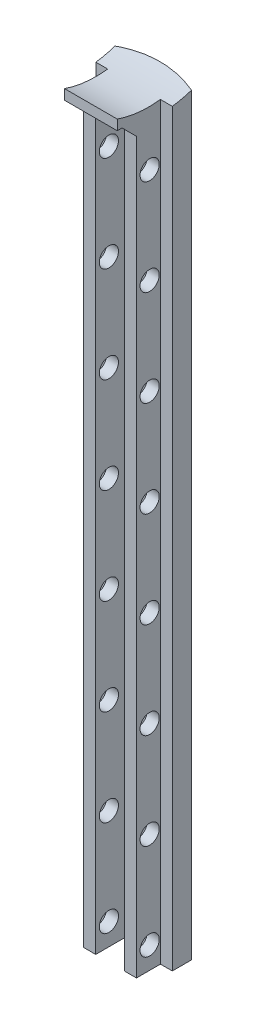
ISO-10303-21;
HEADER;
FILE_DESCRIPTION(('STEP AP214'),'2;1');
FILE_NAME('part.step','',(''),(''),'','','');
FILE_SCHEMA(('AUTOMOTIVE_DESIGN { 1 0 10303 214 1 1 1 1 }'));
ENDSEC;
DATA;
#1=APPLICATION_CONTEXT('core data for automotive mechanical design processes');
#2=APPLICATION_PROTOCOL_DEFINITION('international standard','automotive_design',2000,#1);
#3=PRODUCT_CONTEXT('',#1,'mechanical');
#4=PRODUCT('Part','Part','',(#3));
#5=PRODUCT_RELATED_PRODUCT_CATEGORY('part','',(#4));
#6=PRODUCT_DEFINITION_FORMATION('','',#4);
#7=PRODUCT_DEFINITION_CONTEXT('part definition',#1,'design');
#8=PRODUCT_DEFINITION('design','',#6,#7);
#9=PRODUCT_DEFINITION_SHAPE('','',#8);
#10=(LENGTH_UNIT() NAMED_UNIT(*) SI_UNIT(.MILLI.,.METRE.));
#11=(NAMED_UNIT(*) PLANE_ANGLE_UNIT() SI_UNIT($,.RADIAN.));
#12=(NAMED_UNIT(*) SI_UNIT($,.STERADIAN.) SOLID_ANGLE_UNIT());
#13=UNCERTAINTY_MEASURE_WITH_UNIT(LENGTH_MEASURE(1.E-05),#10,'distance_accuracy_value','');
#14=(GEOMETRIC_REPRESENTATION_CONTEXT(3) GLOBAL_UNCERTAINTY_ASSIGNED_CONTEXT((#13)) GLOBAL_UNIT_ASSIGNED_CONTEXT((#10,
#11,#12)) REPRESENTATION_CONTEXT('',''));
#15=CARTESIAN_POINT('',(0.,0.,0.));
#16=DIRECTION('',(0.,0.,1.));
#17=DIRECTION('',(1.,0.,0.));
#18=AXIS2_PLACEMENT_3D('',#15,#16,#17);
#19=CARTESIAN_POINT('',(-25.7816626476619,150.,-16.8626301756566));
#20=DIRECTION('',(0.,-1.,0.));
#21=DIRECTION('',(0.,0.,-1.));
#22=AXIS2_PLACEMENT_3D('',#19,#20,#21);
#23=CYLINDRICAL_SURFACE('',#22,24.);
#24=CARTESIAN_POINT('',(-17.8065079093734,157.064647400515,-39.4988159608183));
#25=CARTESIAN_POINT('',(-18.1057316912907,157.100501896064,-39.6042402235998));
#26=CARTESIAN_POINT('',(-18.4071614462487,157.135317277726,-39.7037678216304));
#27=CARTESIAN_POINT('',(-19.0140219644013,157.202248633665,-39.8908703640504));
#28=CARTESIAN_POINT('',(-19.3194529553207,157.234364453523,-39.9784446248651));
#29=CARTESIAN_POINT('',(-19.9339978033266,157.295283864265,-40.1415028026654));
#30=CARTESIAN_POINT('',(-20.2431131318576,157.324086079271,-40.2169817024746));
#31=CARTESIAN_POINT('',(-20.8643954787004,157.377815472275,-40.3556467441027));
#32=CARTESIAN_POINT('',(-21.1765624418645,157.402742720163,-40.418833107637));
#33=CARTESIAN_POINT('',(-22.1169125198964,157.470957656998,-40.5897305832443));
#34=CARTESIAN_POINT('',(-22.7490903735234,157.507693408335,-40.6788187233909));
#35=CARTESIAN_POINT('',(-24.0191835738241,157.560743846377,-40.8063357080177));
#36=CARTESIAN_POINT('',(-24.6570976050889,157.57706310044,-40.8447758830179));
#37=CARTESIAN_POINT('',(-25.9357419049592,157.588025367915,-40.8706726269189));
#38=CARTESIAN_POINT('',(-26.5764752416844,157.58261499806,-40.8580036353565));
#39=CARTESIAN_POINT('',(-27.8544719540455,157.550422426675,-40.7815212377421));
#40=CARTESIAN_POINT('',(-28.4917345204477,157.523635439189,-40.7176963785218));
#41=CARTESIAN_POINT('',(-29.7565128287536,157.450905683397,-40.5397827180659));
#42=CARTESIAN_POINT('',(-30.3840478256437,157.405007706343,-40.4258114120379));
#43=CARTESIAN_POINT('',(-31.6265107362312,157.297635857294,-40.1487319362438));
#44=CARTESIAN_POINT('',(-32.2414457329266,157.236171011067,-39.985652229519));
#45=CARTESIAN_POINT('',(-33.0007405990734,157.152466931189,-39.7517198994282));
#46=CARTESIAN_POINT('',(-33.1527738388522,157.135307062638,-39.7032123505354));
#47=CARTESIAN_POINT('',(-33.4556569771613,157.100399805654,-39.603237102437));
#48=CARTESIAN_POINT('',(-33.6065077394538,157.08265290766,-39.5517718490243));
#49=CARTESIAN_POINT('',(-33.7568173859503,157.064647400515,-39.4988159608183));
#50=B_SPLINE_CURVE_WITH_KNOTS('',3,(#24,#25,#26,#27,#28,#29,#30,#31,#32,#33,#34,#35,#36,#37,#38,
#39,#40,#41,#42,#43,#44,#45,#46,#47,#48,#49),.UNSPECIFIED.,.F.,.F.,(4,2,2,2,2,2,2,2,2,2,2,2,4),
(0.,0.957756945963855,1.91556864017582,2.87377661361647,3.831967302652,5.74789612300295,
7.66339625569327,9.58360508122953,11.5042439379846,13.4204064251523,15.3354604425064,
15.8169544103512,16.2980557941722),.UNSPECIFIED.);
#51=CARTESIAN_POINT('',(-17.8065079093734,157.064647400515,-39.4988159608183));
#52=VERTEX_POINT('',#51);
#53=CARTESIAN_POINT('',(-33.7568173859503,157.064647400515,-39.4988159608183));
#54=VERTEX_POINT('',#53);
#55=EDGE_CURVE('E187',#52,#54,#50,.T.);
#56=ORIENTED_EDGE('',*,*,#55,.F.);
#57=DIRECTION('',(0.,-1.,0.));
#58=VECTOR('',#57,1.);
#59=CARTESIAN_POINT('',(-17.8065079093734,150.,-39.4988159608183));
#60=LINE('',#59,#58);
#61=CARTESIAN_POINT('',(-17.8065079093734,0.,-39.4988159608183));
#62=VERTEX_POINT('',#61);
#63=EDGE_CURVE('E263',#52,#62,#60,.T.);
#64=ORIENTED_EDGE('',*,*,#63,.T.);
#65=CARTESIAN_POINT('',(-25.7816626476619,0.,-16.8626301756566));
#66=DIRECTION('',(0.,1.,0.));
#67=DIRECTION('',(0.,0.,-1.));
#68=AXIS2_PLACEMENT_3D('',#65,#66,#67);
#69=CIRCLE('',#68,24.);
#70=CARTESIAN_POINT('',(-33.7568173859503,0.,-39.4988159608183));
#71=VERTEX_POINT('',#70);
#72=EDGE_CURVE('E228',#62,#71,#69,.T.);
#73=ORIENTED_EDGE('',*,*,#72,.T.);
#74=DIRECTION('',(0.,-1.,0.));
#75=VECTOR('',#74,1.);
#76=CARTESIAN_POINT('',(-33.7568173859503,150.,-39.4988159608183));
#77=LINE('',#76,#75);
#78=EDGE_CURVE('E284',#54,#71,#77,.T.);
#79=ORIENTED_EDGE('',*,*,#78,.F.);
#80=EDGE_LOOP('',(#56,#64,#73,#79));
#81=FACE_BOUND('',#80,.T.);
#82=ADVANCED_FACE('F50',(#81),#23,.T.);
#83=CARTESIAN_POINT('',(-33.7568173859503,150.,-39.4988159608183));
#84=DIRECTION('',(1.,0.,0.));
#85=DIRECTION('',(0.,0.,-1.));
#86=AXIS2_PLACEMENT_3D('',#83,#84,#85);
#87=PLANE('',#86);
#88=CARTESIAN_POINT('',(-33.7568173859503,176.,-33.060460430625));
#89=DIRECTION('',(1.,0.,0.));
#90=DIRECTION('',(0.,0.,-1.));
#91=AXIS2_PLACEMENT_3D('',#88,#89,#90);
#92=CIRCLE('',#91,20.);
#93=CARTESIAN_POINT('',(-33.7568173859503,156.149195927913,-35.4988159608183));
#94=VERTEX_POINT('',#93);
#95=EDGE_CURVE('E420',#54,#94,#92,.F.);
#96=ORIENTED_EDGE('',*,*,#95,.F.);
#97=ORIENTED_EDGE('',*,*,#78,.T.);
#98=DIRECTION('',(0.,0.,1.));
#99=VECTOR('',#98,1.);
#100=CARTESIAN_POINT('',(-33.7568173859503,0.,-39.4988159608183));
#101=LINE('',#100,#99);
#102=CARTESIAN_POINT('',(-33.7568173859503,0.,-35.4988159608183));
#103=VERTEX_POINT('',#102);
#104=EDGE_CURVE('E231',#71,#103,#101,.T.);
#105=ORIENTED_EDGE('',*,*,#104,.T.);
#106=DIRECTION('',(0.,-1.,0.));
#107=VECTOR('',#106,1.);
#108=CARTESIAN_POINT('',(-33.7568173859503,150.,-35.4988159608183));
#109=LINE('',#108,#107);
#110=EDGE_CURVE('E282',#94,#103,#109,.T.);
#111=ORIENTED_EDGE('',*,*,#110,.F.);
#112=EDGE_LOOP('',(#96,#97,#105,#111));
#113=FACE_BOUND('',#112,.T.);
#114=ADVANCED_FACE('F480',(#113),#87,.F.);
#115=CARTESIAN_POINT('',(-33.7568173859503,150.,-35.4988159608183));
#116=DIRECTION('',(0.,0.,-1.));
#117=DIRECTION('',(-1.,0.,0.));
#118=AXIS2_PLACEMENT_3D('',#115,#116,#117);
#119=PLANE('',#118);
#120=DIRECTION('',(1.,0.,0.));
#121=VECTOR('',#120,1.);
#122=CARTESIAN_POINT('',(-43.7816626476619,156.149195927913,-35.4988159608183));
#123=LINE('',#122,#121);
#124=CARTESIAN_POINT('',(-31.2816626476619,156.149195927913,-35.4988159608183));
#125=VERTEX_POINT('',#124);
#126=EDGE_CURVE('E493',#94,#125,#123,.T.);
#127=ORIENTED_EDGE('',*,*,#126,.F.);
#128=ORIENTED_EDGE('',*,*,#110,.T.);
#129=DIRECTION('',(1.,0.,0.));
#130=VECTOR('',#129,1.);
#131=CARTESIAN_POINT('',(-33.7568173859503,0.,-35.4988159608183));
#132=LINE('',#131,#130);
#133=CARTESIAN_POINT('',(-31.2816626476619,0.,-35.4988159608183));
#134=VERTEX_POINT('',#133);
#135=EDGE_CURVE('E234',#103,#134,#132,.T.);
#136=ORIENTED_EDGE('',*,*,#135,.T.);
#137=DIRECTION('',(0.,-1.,0.));
#138=VECTOR('',#137,1.);
#139=CARTESIAN_POINT('',(-31.2816626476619,150.,-35.4988159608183));
#140=LINE('',#139,#138);
#141=EDGE_CURVE('E280',#125,#134,#140,.T.);
#142=ORIENTED_EDGE('',*,*,#141,.F.);
#143=EDGE_LOOP('',(#127,#128,#136,#142));
#144=FACE_BOUND('',#143,.T.);
#145=ADVANCED_FACE('F477',(#144),#119,.F.);
#146=CARTESIAN_POINT('',(-31.2816626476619,150.,-35.4988159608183));
#147=DIRECTION('',(1.,0.,0.));
#148=DIRECTION('',(0.,0.,-1.));
#149=AXIS2_PLACEMENT_3D('',#146,#147,#148);
#150=PLANE('',#149);
#151=CARTESIAN_POINT('',(-31.2816626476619,144.598926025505,-33.2488159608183));
#152=DIRECTION('',(-1.,0.,0.));
#153=DIRECTION('',(0.,0.,1.));
#154=AXIS2_PLACEMENT_3D('',#151,#152,#153);
#155=CIRCLE('',#154,2.);
#156=CARTESIAN_POINT('',(-31.2816626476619,144.598926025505,-31.2488159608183));
#157=VERTEX_POINT('',#156);
#158=EDGE_CURVE('E318',#157,#157,#155,.T.);
#159=ORIENTED_EDGE('',*,*,#158,.F.);
#160=EDGE_LOOP('',(#159));
#161=FACE_BOUND('',#160,.T.);
#162=CARTESIAN_POINT('',(-31.2816626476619,124.598926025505,-33.2488159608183));
#163=DIRECTION('',(-1.,0.,0.));
#164=DIRECTION('',(0.,0.,1.));
#165=AXIS2_PLACEMENT_3D('',#162,#163,#164);
#166=CIRCLE('',#165,2.);
#167=CARTESIAN_POINT('',(-31.2816626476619,124.598926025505,-31.2488159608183));
#168=VERTEX_POINT('',#167);
#169=EDGE_CURVE('E312',#168,#168,#166,.T.);
#170=ORIENTED_EDGE('',*,*,#169,.F.);
#171=EDGE_LOOP('',(#170));
#172=FACE_BOUND('',#171,.T.);
#173=CARTESIAN_POINT('',(-31.2816626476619,104.598926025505,-33.2488159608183));
#174=DIRECTION('',(-1.,0.,0.));
#175=DIRECTION('',(0.,0.,1.));
#176=AXIS2_PLACEMENT_3D('',#173,#174,#175);
#177=CIRCLE('',#176,2.);
#178=CARTESIAN_POINT('',(-31.2816626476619,104.598926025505,-31.2488159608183));
#179=VERTEX_POINT('',#178);
#180=EDGE_CURVE('E306',#179,#179,#177,.T.);
#181=ORIENTED_EDGE('',*,*,#180,.F.);
#182=EDGE_LOOP('',(#181));
#183=FACE_BOUND('',#182,.T.);
#184=CARTESIAN_POINT('',(-31.2816626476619,84.5989260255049,-33.2488159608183));
#185=DIRECTION('',(-1.,0.,0.));
#186=DIRECTION('',(0.,0.,1.));
#187=AXIS2_PLACEMENT_3D('',#184,#185,#186);
#188=CIRCLE('',#187,2.);
#189=CARTESIAN_POINT('',(-31.2816626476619,84.5989260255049,-31.2488159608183));
#190=VERTEX_POINT('',#189);
#191=EDGE_CURVE('E300',#190,#190,#188,.T.);
#192=ORIENTED_EDGE('',*,*,#191,.F.);
#193=EDGE_LOOP('',(#192));
#194=FACE_BOUND('',#193,.T.);
#195=CARTESIAN_POINT('',(-31.2816626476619,64.5989260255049,-33.2488159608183));
#196=DIRECTION('',(-1.,0.,0.));
#197=DIRECTION('',(0.,0.,1.));
#198=AXIS2_PLACEMENT_3D('',#195,#196,#197);
#199=CIRCLE('',#198,2.);
#200=CARTESIAN_POINT('',(-31.2816626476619,64.5989260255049,-31.2488159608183));
#201=VERTEX_POINT('',#200);
#202=EDGE_CURVE('E294',#201,#201,#199,.T.);
#203=ORIENTED_EDGE('',*,*,#202,.F.);
#204=EDGE_LOOP('',(#203));
#205=FACE_BOUND('',#204,.T.);
#206=CARTESIAN_POINT('',(-31.2816626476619,44.5989260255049,-33.2488159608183));
#207=DIRECTION('',(-1.,0.,0.));
#208=DIRECTION('',(0.,0.,1.));
#209=AXIS2_PLACEMENT_3D('',#206,#207,#208);
#210=CIRCLE('',#209,2.);
#211=CARTESIAN_POINT('',(-31.2816626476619,44.5989260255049,-31.2488159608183));
#212=VERTEX_POINT('',#211);
#213=EDGE_CURVE('E286',#212,#212,#210,.T.);
#214=ORIENTED_EDGE('',*,*,#213,.F.);
#215=EDGE_LOOP('',(#214));
#216=FACE_BOUND('',#215,.T.);
#217=CARTESIAN_POINT('',(-31.2816626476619,4.59892602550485,-33.2488159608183));
#218=DIRECTION('',(-1.,0.,0.));
#219=DIRECTION('',(0.,0.,1.));
#220=AXIS2_PLACEMENT_3D('',#217,#218,#219);
#221=CIRCLE('',#220,2.);
#222=CARTESIAN_POINT('',(-31.2816626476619,4.59892602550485,-31.2488159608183));
#223=VERTEX_POINT('',#222);
#224=EDGE_CURVE('E218',#223,#223,#221,.T.);
#225=ORIENTED_EDGE('',*,*,#224,.F.);
#226=EDGE_LOOP('',(#225));
#227=FACE_BOUND('',#226,.T.);
#228=CARTESIAN_POINT('',(-31.2816626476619,24.5989260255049,-33.2488159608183));
#229=DIRECTION('',(-1.,0.,0.));
#230=DIRECTION('',(0.,0.,1.));
#231=AXIS2_PLACEMENT_3D('',#228,#229,#230);
#232=CIRCLE('',#231,2.);
#233=CARTESIAN_POINT('',(-31.2816626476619,24.5989260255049,-31.2488159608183));
#234=VERTEX_POINT('',#233);
#235=EDGE_CURVE('E207',#234,#234,#232,.T.);
#236=ORIENTED_EDGE('',*,*,#235,.F.);
#237=EDGE_LOOP('',(#236));
#238=FACE_BOUND('',#237,.T.);
#239=CARTESIAN_POINT('',(-31.2816626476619,176.,-33.060460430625));
#240=DIRECTION('',(1.,0.,0.));
#241=DIRECTION('',(0.,0.,-1.));
#242=AXIS2_PLACEMENT_3D('',#239,#240,#241);
#243=CIRCLE('',#242,20.);
#244=CARTESIAN_POINT('',(-31.2816626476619,157.107016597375,-26.4988159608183));
#245=VERTEX_POINT('',#244);
#246=EDGE_CURVE('E172',#125,#245,#243,.F.);
#247=ORIENTED_EDGE('',*,*,#246,.F.);
#248=ORIENTED_EDGE('',*,*,#141,.T.);
#249=DIRECTION('',(0.,0.,1.));
#250=VECTOR('',#249,1.);
#251=CARTESIAN_POINT('',(-31.2816626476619,0.,-35.4988159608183));
#252=LINE('',#251,#250);
#253=CARTESIAN_POINT('',(-31.2816626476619,0.,-30.4988159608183));
#254=VERTEX_POINT('',#253);
#255=EDGE_CURVE('E237',#134,#254,#252,.T.);
#256=ORIENTED_EDGE('',*,*,#255,.T.);
#257=DIRECTION('',(0.,-1.,0.));
#258=VECTOR('',#257,1.);
#259=CARTESIAN_POINT('',(-31.2816626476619,150.,-30.4988159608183));
#260=LINE('',#259,#258);
#261=CARTESIAN_POINT('',(-31.2816626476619,152.,-30.4988159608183));
#262=VERTEX_POINT('',#261);
#263=EDGE_CURVE('E278',#262,#254,#260,.T.);
#264=ORIENTED_EDGE('',*,*,#263,.F.);
#265=DIRECTION('',(0.,-0.707106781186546,-0.707106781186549));
#266=VECTOR('',#265,1.);
#267=CARTESIAN_POINT('',(-31.2816626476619,148.5,-33.9988159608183));
#268=LINE('',#267,#266);
#269=CARTESIAN_POINT('',(-31.2816626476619,155.,-27.4988159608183));
#270=VERTEX_POINT('',#269);
#271=EDGE_CURVE('E377',#262,#270,#268,.F.);
#272=ORIENTED_EDGE('',*,*,#271,.T.);
#273=DIRECTION('',(0.,0.,1.));
#274=VECTOR('',#273,1.);
#275=CARTESIAN_POINT('',(-31.2816626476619,155.,-30.4988159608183));
#276=LINE('',#275,#274);
#277=CARTESIAN_POINT('',(-31.2816626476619,155.,-26.4988159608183));
#278=VERTEX_POINT('',#277);
#279=EDGE_CURVE('E499',#270,#278,#276,.T.);
#280=ORIENTED_EDGE('',*,*,#279,.T.);
#281=DIRECTION('',(0.,-1.,0.));
#282=VECTOR('',#281,1.);
#283=CARTESIAN_POINT('',(-31.2816626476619,160.,-26.4988159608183));
#284=LINE('',#283,#282);
#285=EDGE_CURVE('E194',#245,#278,#284,.T.);
#286=ORIENTED_EDGE('',*,*,#285,.F.);
#287=EDGE_LOOP('',(#247,#248,#256,#264,#272,#280,#286));
#288=FACE_BOUND('',#287,.T.);
#289=ADVANCED_FACE('F456',(#161,#172,#183,#194,#205,#216,#227,#238,#288),#150,.F.);
#290=CARTESIAN_POINT('',(-20.2816626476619,150.,-35.4988159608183));
#291=DIRECTION('',(-1.,0.,0.));
#292=DIRECTION('',(0.,0.,1.));
#293=AXIS2_PLACEMENT_3D('',#290,#291,#292);
#294=PLANE('',#293);
#295=CARTESIAN_POINT('',(-20.2816626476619,144.598926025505,-33.2488159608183));
#296=DIRECTION('',(-1.,0.,0.));
#297=DIRECTION('',(0.,0.,1.));
#298=AXIS2_PLACEMENT_3D('',#295,#296,#297);
#299=CIRCLE('',#298,2.);
#300=CARTESIAN_POINT('',(-20.2816626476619,144.598926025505,-31.2488159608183));
#301=VERTEX_POINT('',#300);
#302=EDGE_CURVE('E354',#301,#301,#299,.T.);
#303=ORIENTED_EDGE('',*,*,#302,.T.);
#304=EDGE_LOOP('',(#303));
#305=FACE_BOUND('',#304,.T.);
#306=CARTESIAN_POINT('',(-20.2816626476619,124.598926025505,-33.2488159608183));
#307=DIRECTION('',(-1.,0.,0.));
#308=DIRECTION('',(0.,0.,1.));
#309=AXIS2_PLACEMENT_3D('',#306,#307,#308);
#310=CIRCLE('',#309,2.);
#311=CARTESIAN_POINT('',(-20.2816626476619,124.598926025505,-31.2488159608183));
#312=VERTEX_POINT('',#311);
#313=EDGE_CURVE('E348',#312,#312,#310,.T.);
#314=ORIENTED_EDGE('',*,*,#313,.T.);
#315=EDGE_LOOP('',(#314));
#316=FACE_BOUND('',#315,.T.);
#317=CARTESIAN_POINT('',(-20.2816626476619,104.598926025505,-33.2488159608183));
#318=DIRECTION('',(-1.,0.,0.));
#319=DIRECTION('',(0.,0.,1.));
#320=AXIS2_PLACEMENT_3D('',#317,#318,#319);
#321=CIRCLE('',#320,2.);
#322=CARTESIAN_POINT('',(-20.2816626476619,104.598926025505,-31.2488159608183));
#323=VERTEX_POINT('',#322);
#324=EDGE_CURVE('E342',#323,#323,#321,.T.);
#325=ORIENTED_EDGE('',*,*,#324,.T.);
#326=EDGE_LOOP('',(#325));
#327=FACE_BOUND('',#326,.T.);
#328=CARTESIAN_POINT('',(-20.2816626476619,84.5989260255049,-33.2488159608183));
#329=DIRECTION('',(-1.,0.,0.));
#330=DIRECTION('',(0.,0.,1.));
#331=AXIS2_PLACEMENT_3D('',#328,#329,#330);
#332=CIRCLE('',#331,2.);
#333=CARTESIAN_POINT('',(-20.2816626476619,84.5989260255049,-31.2488159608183));
#334=VERTEX_POINT('',#333);
#335=EDGE_CURVE('E336',#334,#334,#332,.T.);
#336=ORIENTED_EDGE('',*,*,#335,.T.);
#337=EDGE_LOOP('',(#336));
#338=FACE_BOUND('',#337,.T.);
#339=CARTESIAN_POINT('',(-20.2816626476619,64.5989260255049,-33.2488159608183));
#340=DIRECTION('',(-1.,0.,0.));
#341=DIRECTION('',(0.,0.,1.));
#342=AXIS2_PLACEMENT_3D('',#339,#340,#341);
#343=CIRCLE('',#342,2.);
#344=CARTESIAN_POINT('',(-20.2816626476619,64.5989260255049,-31.2488159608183));
#345=VERTEX_POINT('',#344);
#346=EDGE_CURVE('E330',#345,#345,#343,.T.);
#347=ORIENTED_EDGE('',*,*,#346,.T.);
#348=EDGE_LOOP('',(#347));
#349=FACE_BOUND('',#348,.T.);
#350=CARTESIAN_POINT('',(-20.2816626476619,44.5989260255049,-33.2488159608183));
#351=DIRECTION('',(-1.,0.,0.));
#352=DIRECTION('',(0.,0.,1.));
#353=AXIS2_PLACEMENT_3D('',#350,#351,#352);
#354=CIRCLE('',#353,2.);
#355=CARTESIAN_POINT('',(-20.2816626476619,44.5989260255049,-31.2488159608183));
#356=VERTEX_POINT('',#355);
#357=EDGE_CURVE('E324',#356,#356,#354,.T.);
#358=ORIENTED_EDGE('',*,*,#357,.T.);
#359=EDGE_LOOP('',(#358));
#360=FACE_BOUND('',#359,.T.);
#361=CARTESIAN_POINT('',(-20.2816626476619,4.59892602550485,-33.2488159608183));
#362=DIRECTION('',(-1.,0.,0.));
#363=DIRECTION('',(0.,0.,1.));
#364=AXIS2_PLACEMENT_3D('',#361,#362,#363);
#365=CIRCLE('',#364,2.);
#366=CARTESIAN_POINT('',(-20.2816626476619,4.59892602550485,-31.2488159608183));
#367=VERTEX_POINT('',#366);
#368=EDGE_CURVE('E221',#367,#367,#365,.T.);
#369=ORIENTED_EDGE('',*,*,#368,.T.);
#370=EDGE_LOOP('',(#369));
#371=FACE_BOUND('',#370,.T.);
#372=CARTESIAN_POINT('',(-20.2816626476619,24.5989260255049,-33.2488159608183));
#373=DIRECTION('',(-1.,0.,0.));
#374=DIRECTION('',(0.,0.,1.));
#375=AXIS2_PLACEMENT_3D('',#372,#373,#374);
#376=CIRCLE('',#375,2.);
#377=CARTESIAN_POINT('',(-20.2816626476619,24.5989260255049,-31.2488159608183));
#378=VERTEX_POINT('',#377);
#379=EDGE_CURVE('E197',#378,#378,#376,.T.);
#380=ORIENTED_EDGE('',*,*,#379,.T.);
#381=EDGE_LOOP('',(#380));
#382=FACE_BOUND('',#381,.T.);
#383=CARTESIAN_POINT('',(-20.2816626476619,176.,-33.060460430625));
#384=DIRECTION('',(-1.,0.,0.));
#385=DIRECTION('',(0.,0.,1.));
#386=AXIS2_PLACEMENT_3D('',#383,#384,#385);
#387=CIRCLE('',#386,20.);
#388=CARTESIAN_POINT('',(-20.2816626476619,157.107016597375,-26.4988159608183));
#389=VERTEX_POINT('',#388);
#390=CARTESIAN_POINT('',(-20.2816626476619,156.149195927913,-35.4988159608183));
#391=VERTEX_POINT('',#390);
#392=EDGE_CURVE('E169',#389,#391,#387,.F.);
#393=ORIENTED_EDGE('',*,*,#392,.F.);
#394=DIRECTION('',(0.,-1.,0.));
#395=VECTOR('',#394,1.);
#396=CARTESIAN_POINT('',(-20.2816626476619,160.,-26.4988159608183));
#397=LINE('',#396,#395);
#398=CARTESIAN_POINT('',(-20.2816626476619,155.,-26.4988159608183));
#399=VERTEX_POINT('',#398);
#400=EDGE_CURVE('E183',#389,#399,#397,.T.);
#401=ORIENTED_EDGE('',*,*,#400,.T.);
#402=DIRECTION('',(0.,0.,-1.));
#403=VECTOR('',#402,1.);
#404=CARTESIAN_POINT('',(-20.2816626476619,155.,-30.4988159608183));
#405=LINE('',#404,#403);
#406=CARTESIAN_POINT('',(-20.2816626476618,155.,-27.4988159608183));
#407=VERTEX_POINT('',#406);
#408=EDGE_CURVE('E195',#399,#407,#405,.T.);
#409=ORIENTED_EDGE('',*,*,#408,.T.);
#410=DIRECTION('',(0.,0.707106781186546,0.707106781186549));
#411=VECTOR('',#410,1.);
#412=CARTESIAN_POINT('',(-20.2816626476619,148.5,-33.9988159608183));
#413=LINE('',#412,#411);
#414=CARTESIAN_POINT('',(-20.2816626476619,152.,-30.4988159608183));
#415=VERTEX_POINT('',#414);
#416=EDGE_CURVE('E370',#407,#415,#413,.F.);
#417=ORIENTED_EDGE('',*,*,#416,.T.);
#418=DIRECTION('',(0.,-1.,0.));
#419=VECTOR('',#418,1.);
#420=CARTESIAN_POINT('',(-20.2816626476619,150.,-30.4988159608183));
#421=LINE('',#420,#419);
#422=CARTESIAN_POINT('',(-20.2816626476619,0.,-30.4988159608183));
#423=VERTEX_POINT('',#422);
#424=EDGE_CURVE('E268',#415,#423,#421,.T.);
#425=ORIENTED_EDGE('',*,*,#424,.T.);
#426=DIRECTION('',(0.,0.,-1.));
#427=VECTOR('',#426,1.);
#428=CARTESIAN_POINT('',(-20.2816626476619,0.,-35.4988159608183));
#429=LINE('',#428,#427);
#430=CARTESIAN_POINT('',(-20.2816626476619,0.,-35.4988159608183));
#431=VERTEX_POINT('',#430);
#432=EDGE_CURVE('E255',#423,#431,#429,.T.);
#433=ORIENTED_EDGE('',*,*,#432,.T.);
#434=DIRECTION('',(0.,-1.,0.));
#435=VECTOR('',#434,1.);
#436=CARTESIAN_POINT('',(-20.2816626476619,150.,-35.4988159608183));
#437=LINE('',#436,#435);
#438=EDGE_CURVE('E186',#391,#431,#437,.T.);
#439=ORIENTED_EDGE('',*,*,#438,.F.);
#440=EDGE_LOOP('',(#393,#401,#409,#417,#425,#433,#439));
#441=FACE_BOUND('',#440,.T.);
#442=ADVANCED_FACE('F181',(#305,#316,#327,#338,#349,#360,#371,#382,#441),#294,.F.);
#443=CARTESIAN_POINT('',(-17.8065079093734,150.,-35.4988159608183));
#444=DIRECTION('',(0.,0.,-1.));
#445=DIRECTION('',(-1.,0.,0.));
#446=AXIS2_PLACEMENT_3D('',#443,#444,#445);
#447=PLANE('',#446);
#448=DIRECTION('',(1.,0.,0.));
#449=VECTOR('',#448,1.);
#450=CARTESIAN_POINT('',(-43.7816626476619,156.149195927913,-35.4988159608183));
#451=LINE('',#450,#449);
#452=CARTESIAN_POINT('',(-17.8065079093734,156.149195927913,-35.4988159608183));
#453=VERTEX_POINT('',#452);
#454=EDGE_CURVE('E188',#391,#453,#451,.T.);
#455=ORIENTED_EDGE('',*,*,#454,.F.);
#456=ORIENTED_EDGE('',*,*,#438,.T.);
#457=DIRECTION('',(1.,0.,0.));
#458=VECTOR('',#457,1.);
#459=CARTESIAN_POINT('',(-17.8065079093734,0.,-35.4988159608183));
#460=LINE('',#459,#458);
#461=CARTESIAN_POINT('',(-17.8065079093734,0.,-35.4988159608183));
#462=VERTEX_POINT('',#461);
#463=EDGE_CURVE('E257',#431,#462,#460,.T.);
#464=ORIENTED_EDGE('',*,*,#463,.T.);
#465=DIRECTION('',(0.,-1.,0.));
#466=VECTOR('',#465,1.);
#467=CARTESIAN_POINT('',(-17.8065079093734,150.,-35.4988159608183));
#468=LINE('',#467,#466);
#469=EDGE_CURVE('E265',#453,#462,#468,.T.);
#470=ORIENTED_EDGE('',*,*,#469,.F.);
#471=EDGE_LOOP('',(#455,#456,#464,#470));
#472=FACE_BOUND('',#471,.T.);
#473=ADVANCED_FACE('F408',(#472),#447,.F.);
#474=CARTESIAN_POINT('',(-17.8065079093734,150.,-39.4988159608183));
#475=DIRECTION('',(-1.,0.,0.));
#476=DIRECTION('',(0.,0.,1.));
#477=AXIS2_PLACEMENT_3D('',#474,#475,#476);
#478=PLANE('',#477);
#479=CARTESIAN_POINT('',(-17.8065079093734,176.,-33.060460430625));
#480=DIRECTION('',(-1.,0.,0.));
#481=DIRECTION('',(0.,0.,1.));
#482=AXIS2_PLACEMENT_3D('',#479,#480,#481);
#483=CIRCLE('',#482,20.);
#484=EDGE_CURVE('E177',#453,#52,#483,.F.);
#485=ORIENTED_EDGE('',*,*,#484,.F.);
#486=ORIENTED_EDGE('',*,*,#469,.T.);
#487=DIRECTION('',(0.,0.,-1.));
#488=VECTOR('',#487,1.);
#489=CARTESIAN_POINT('',(-17.8065079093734,0.,-39.4988159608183));
#490=LINE('',#489,#488);
#491=EDGE_CURVE('E260',#462,#62,#490,.T.);
#492=ORIENTED_EDGE('',*,*,#491,.T.);
#493=ORIENTED_EDGE('',*,*,#63,.F.);
#494=EDGE_LOOP('',(#485,#486,#492,#493));
#495=FACE_BOUND('',#494,.T.);
#496=ADVANCED_FACE('F434',(#495),#478,.F.);
#497=CARTESIAN_POINT('',(-31.2816626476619,160.,-26.4988159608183));
#498=DIRECTION('',(0.,0.,-1.));
#499=DIRECTION('',(-1.,0.,0.));
#500=AXIS2_PLACEMENT_3D('',#497,#498,#499);
#501=PLANE('',#500);
#502=DIRECTION('',(1.,0.,0.));
#503=VECTOR('',#502,1.);
#504=CARTESIAN_POINT('',(-43.7816626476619,157.107016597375,-26.4988159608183));
#505=LINE('',#504,#503);
#506=EDGE_CURVE('E166',#245,#389,#505,.T.);
#507=ORIENTED_EDGE('',*,*,#506,.F.);
#508=ORIENTED_EDGE('',*,*,#285,.T.);
#509=DIRECTION('',(1.,0.,0.));
#510=VECTOR('',#509,1.);
#511=CARTESIAN_POINT('',(-31.2816626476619,155.,-26.4988159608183));
#512=LINE('',#511,#510);
#513=EDGE_CURVE('E193',#278,#399,#512,.T.);
#514=ORIENTED_EDGE('',*,*,#513,.T.);
#515=ORIENTED_EDGE('',*,*,#400,.F.);
#516=EDGE_LOOP('',(#507,#508,#514,#515));
#517=FACE_BOUND('',#516,.T.);
#518=ADVANCED_FACE('F191',(#517),#501,.F.);
#519=CARTESIAN_POINT('',(-10.2816626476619,144.598926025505,-33.2488159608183));
#520=DIRECTION('',(-1.,0.,0.));
#521=DIRECTION('',(0.,0.,1.));
#522=AXIS2_PLACEMENT_3D('',#519,#520,#521);
#523=CYLINDRICAL_SURFACE('',#522,2.);
#524=CARTESIAN_POINT('',(-22.7816626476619,144.598926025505,-33.2488159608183));
#525=DIRECTION('',(1.,0.,0.));
#526=DIRECTION('',(0.,0.,-1.));
#527=AXIS2_PLACEMENT_3D('',#524,#525,#526);
#528=CIRCLE('',#527,2.);
#529=CARTESIAN_POINT('',(-22.7816626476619,144.598926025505,-31.2488159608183));
#530=VERTEX_POINT('',#529);
#531=EDGE_CURVE('E357',#530,#530,#528,.T.);
#532=CARTESIAN_POINT('',(-20.2816626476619,144.598926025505,-31.2488159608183));
#533=CARTESIAN_POINT('',(-20.3077043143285,144.598926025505,-31.2488159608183));
#534=CARTESIAN_POINT('',(-20.3337459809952,144.598926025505,-31.2488159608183));
#535=CARTESIAN_POINT('',(-20.3858293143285,144.598926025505,-31.2488159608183));
#536=CARTESIAN_POINT('',(-20.4118709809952,144.598926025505,-31.2488159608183));
#537=CARTESIAN_POINT('',(-20.4639543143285,144.598926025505,-31.2488159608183));
#538=CARTESIAN_POINT('',(-20.4899959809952,144.598926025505,-31.2488159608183));
#539=CARTESIAN_POINT('',(-20.5420793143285,144.598926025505,-31.2488159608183));
#540=CARTESIAN_POINT('',(-20.5681209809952,144.598926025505,-31.2488159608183));
#541=CARTESIAN_POINT('',(-20.6202043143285,144.598926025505,-31.2488159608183));
#542=CARTESIAN_POINT('',(-20.6462459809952,144.598926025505,-31.2488159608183));
#543=CARTESIAN_POINT('',(-20.6983293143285,144.598926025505,-31.2488159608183));
#544=CARTESIAN_POINT('',(-20.7243709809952,144.598926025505,-31.2488159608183));
#545=CARTESIAN_POINT('',(-20.7764543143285,144.598926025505,-31.2488159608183));
#546=CARTESIAN_POINT('',(-20.8024959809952,144.598926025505,-31.2488159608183));
#547=CARTESIAN_POINT('',(-20.8545793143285,144.598926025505,-31.2488159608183));
#548=CARTESIAN_POINT('',(-20.8806209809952,144.598926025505,-31.2488159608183));
#549=CARTESIAN_POINT('',(-20.9327043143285,144.598926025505,-31.2488159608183));
#550=CARTESIAN_POINT('',(-20.9587459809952,144.598926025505,-31.2488159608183));
#551=CARTESIAN_POINT('',(-21.0108293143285,144.598926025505,-31.2488159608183));
#552=CARTESIAN_POINT('',(-21.0368709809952,144.598926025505,-31.2488159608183));
#553=CARTESIAN_POINT('',(-21.0889543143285,144.598926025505,-31.2488159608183));
#554=CARTESIAN_POINT('',(-21.1149959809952,144.598926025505,-31.2488159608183));
#555=CARTESIAN_POINT('',(-21.1670793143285,144.598926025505,-31.2488159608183));
#556=CARTESIAN_POINT('',(-21.1931209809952,144.598926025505,-31.2488159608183));
#557=CARTESIAN_POINT('',(-21.2452043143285,144.598926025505,-31.2488159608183));
#558=CARTESIAN_POINT('',(-21.2712459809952,144.598926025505,-31.2488159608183));
#559=CARTESIAN_POINT('',(-21.3233293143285,144.598926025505,-31.2488159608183));
#560=CARTESIAN_POINT('',(-21.3493709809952,144.598926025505,-31.2488159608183));
#561=CARTESIAN_POINT('',(-21.4014543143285,144.598926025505,-31.2488159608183));
#562=CARTESIAN_POINT('',(-21.4274959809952,144.598926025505,-31.2488159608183));
#563=CARTESIAN_POINT('',(-21.4795793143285,144.598926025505,-31.2488159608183));
#564=CARTESIAN_POINT('',(-21.5056209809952,144.598926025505,-31.2488159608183));
#565=CARTESIAN_POINT('',(-21.5577043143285,144.598926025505,-31.2488159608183));
#566=CARTESIAN_POINT('',(-21.5837459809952,144.598926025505,-31.2488159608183));
#567=CARTESIAN_POINT('',(-21.6358293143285,144.598926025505,-31.2488159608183));
#568=CARTESIAN_POINT('',(-21.6618709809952,144.598926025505,-31.2488159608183));
#569=CARTESIAN_POINT('',(-21.7139543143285,144.598926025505,-31.2488159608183));
#570=CARTESIAN_POINT('',(-21.7399959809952,144.598926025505,-31.2488159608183));
#571=CARTESIAN_POINT('',(-21.7920793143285,144.598926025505,-31.2488159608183));
#572=CARTESIAN_POINT('',(-21.8181209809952,144.598926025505,-31.2488159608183));
#573=CARTESIAN_POINT('',(-21.8702043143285,144.598926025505,-31.2488159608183));
#574=CARTESIAN_POINT('',(-21.8962459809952,144.598926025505,-31.2488159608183));
#575=CARTESIAN_POINT('',(-21.9483293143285,144.598926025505,-31.2488159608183));
#576=CARTESIAN_POINT('',(-21.9743709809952,144.598926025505,-31.2488159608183));
#577=CARTESIAN_POINT('',(-22.0264543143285,144.598926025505,-31.2488159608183));
#578=CARTESIAN_POINT('',(-22.0524959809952,144.598926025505,-31.2488159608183));
#579=CARTESIAN_POINT('',(-22.1045793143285,144.598926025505,-31.2488159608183));
#580=CARTESIAN_POINT('',(-22.1306209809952,144.598926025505,-31.2488159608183));
#581=CARTESIAN_POINT('',(-22.1827043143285,144.598926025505,-31.2488159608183));
#582=CARTESIAN_POINT('',(-22.2087459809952,144.598926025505,-31.2488159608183));
#583=CARTESIAN_POINT('',(-22.2608293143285,144.598926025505,-31.2488159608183));
#584=CARTESIAN_POINT('',(-22.2868709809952,144.598926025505,-31.2488159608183));
#585=CARTESIAN_POINT('',(-22.3389543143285,144.598926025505,-31.2488159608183));
#586=CARTESIAN_POINT('',(-22.3649959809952,144.598926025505,-31.2488159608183));
#587=CARTESIAN_POINT('',(-22.4170793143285,144.598926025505,-31.2488159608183));
#588=CARTESIAN_POINT('',(-22.4431209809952,144.598926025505,-31.2488159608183));
#589=CARTESIAN_POINT('',(-22.4952043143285,144.598926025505,-31.2488159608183));
#590=CARTESIAN_POINT('',(-22.5212459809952,144.598926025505,-31.2488159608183));
#591=CARTESIAN_POINT('',(-22.5733293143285,144.598926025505,-31.2488159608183));
#592=CARTESIAN_POINT('',(-22.5993709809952,144.598926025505,-31.2488159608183));
#593=CARTESIAN_POINT('',(-22.6514543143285,144.598926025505,-31.2488159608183));
#594=CARTESIAN_POINT('',(-22.6774959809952,144.598926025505,-31.2488159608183));
#595=CARTESIAN_POINT('',(-22.7295793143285,144.598926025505,-31.2488159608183));
#596=CARTESIAN_POINT('',(-22.7556209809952,144.598926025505,-31.2488159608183));
#597=CARTESIAN_POINT('',(-22.7816626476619,144.598926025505,-31.2488159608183));
#598=B_SPLINE_CURVE_WITH_KNOTS('',3,(#532,#533,#534,#535,#536,#537,#538,#539,#540,#541,#542,
#543,#544,#545,#546,#547,#548,#549,#550,#551,#552,#553,#554,#555,#556,#557,#558,#559,#560,#561,
#562,#563,#564,#565,#566,#567,#568,#569,#570,#571,#572,#573,#574,#575,#576,#577,#578,#579,#580,
#581,#582,#583,#584,#585,#586,#587,#588,#589,#590,#591,#592,#593,#594,#595,#596,#597),
.UNSPECIFIED.,.F.,.F.,(4,2,2,2,2,2,2,2,2,2,2,2,2,2,2,2,2,2,2,2,2,2,2,2,2,2,2,2,2,2,2,2,4),(0.,
0.0781249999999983,0.156249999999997,0.234374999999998,0.3125,0.390624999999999,
0.468749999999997,0.546874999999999,0.625000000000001,0.703124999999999,0.781249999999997,
0.859374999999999,0.937500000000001,1.015625,1.09375,1.171875,1.25,1.328125,1.40625,1.484375,
1.5625,1.640625,1.71875,1.796875,1.875,1.953125,2.03125,2.109375,2.1875,2.265625,2.34375,
2.421875,2.5),.UNSPECIFIED.);
#599=EDGE_CURVE('BSEAM433',#301,#530,#598,.T.);
#600=ORIENTED_EDGE('',*,*,#302,.F.);
#601=ORIENTED_EDGE('',*,*,#531,.F.);
#602=ORIENTED_EDGE('',*,*,#599,.T.);
#603=ORIENTED_EDGE('',*,*,#599,.F.);
#604=EDGE_LOOP('',(#600,#602,#601,#603));
#605=FACE_BOUND('',#604,.T.);
#606=ADVANCED_FACE('F433',(#605),#523,.F.);
#607=CARTESIAN_POINT('',(-10.2816626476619,124.598926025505,-33.2488159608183));
#608=DIRECTION('',(-1.,0.,0.));
#609=DIRECTION('',(0.,0.,1.));
#610=AXIS2_PLACEMENT_3D('',#607,#608,#609);
#611=CYLINDRICAL_SURFACE('',#610,2.);
#612=CARTESIAN_POINT('',(-22.7816626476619,124.598926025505,-33.2488159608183));
#613=DIRECTION('',(1.,0.,0.));
#614=DIRECTION('',(0.,0.,-1.));
#615=AXIS2_PLACEMENT_3D('',#612,#613,#614);
#616=CIRCLE('',#615,2.);
#617=CARTESIAN_POINT('',(-22.7816626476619,124.598926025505,-31.2488159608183));
#618=VERTEX_POINT('',#617);
#619=EDGE_CURVE('E351',#618,#618,#616,.T.);
#620=CARTESIAN_POINT('',(-20.2816626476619,124.598926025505,-31.2488159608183));
#621=CARTESIAN_POINT('',(-20.3077043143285,124.598926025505,-31.2488159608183));
#622=CARTESIAN_POINT('',(-20.3337459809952,124.598926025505,-31.2488159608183));
#623=CARTESIAN_POINT('',(-20.3858293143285,124.598926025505,-31.2488159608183));
#624=CARTESIAN_POINT('',(-20.4118709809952,124.598926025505,-31.2488159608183));
#625=CARTESIAN_POINT('',(-20.4639543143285,124.598926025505,-31.2488159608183));
#626=CARTESIAN_POINT('',(-20.4899959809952,124.598926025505,-31.2488159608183));
#627=CARTESIAN_POINT('',(-20.5420793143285,124.598926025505,-31.2488159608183));
#628=CARTESIAN_POINT('',(-20.5681209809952,124.598926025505,-31.2488159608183));
#629=CARTESIAN_POINT('',(-20.6202043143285,124.598926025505,-31.2488159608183));
#630=CARTESIAN_POINT('',(-20.6462459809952,124.598926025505,-31.2488159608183));
#631=CARTESIAN_POINT('',(-20.6983293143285,124.598926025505,-31.2488159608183));
#632=CARTESIAN_POINT('',(-20.7243709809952,124.598926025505,-31.2488159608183));
#633=CARTESIAN_POINT('',(-20.7764543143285,124.598926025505,-31.2488159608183));
#634=CARTESIAN_POINT('',(-20.8024959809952,124.598926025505,-31.2488159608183));
#635=CARTESIAN_POINT('',(-20.8545793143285,124.598926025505,-31.2488159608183));
#636=CARTESIAN_POINT('',(-20.8806209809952,124.598926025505,-31.2488159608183));
#637=CARTESIAN_POINT('',(-20.9327043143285,124.598926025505,-31.2488159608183));
#638=CARTESIAN_POINT('',(-20.9587459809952,124.598926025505,-31.2488159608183));
#639=CARTESIAN_POINT('',(-21.0108293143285,124.598926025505,-31.2488159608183));
#640=CARTESIAN_POINT('',(-21.0368709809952,124.598926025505,-31.2488159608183));
#641=CARTESIAN_POINT('',(-21.0889543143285,124.598926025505,-31.2488159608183));
#642=CARTESIAN_POINT('',(-21.1149959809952,124.598926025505,-31.2488159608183));
#643=CARTESIAN_POINT('',(-21.1670793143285,124.598926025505,-31.2488159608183));
#644=CARTESIAN_POINT('',(-21.1931209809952,124.598926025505,-31.2488159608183));
#645=CARTESIAN_POINT('',(-21.2452043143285,124.598926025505,-31.2488159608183));
#646=CARTESIAN_POINT('',(-21.2712459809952,124.598926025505,-31.2488159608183));
#647=CARTESIAN_POINT('',(-21.3233293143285,124.598926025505,-31.2488159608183));
#648=CARTESIAN_POINT('',(-21.3493709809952,124.598926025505,-31.2488159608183));
#649=CARTESIAN_POINT('',(-21.4014543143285,124.598926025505,-31.2488159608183));
#650=CARTESIAN_POINT('',(-21.4274959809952,124.598926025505,-31.2488159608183));
#651=CARTESIAN_POINT('',(-21.4795793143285,124.598926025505,-31.2488159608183));
#652=CARTESIAN_POINT('',(-21.5056209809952,124.598926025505,-31.2488159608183));
#653=CARTESIAN_POINT('',(-21.5577043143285,124.598926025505,-31.2488159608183));
#654=CARTESIAN_POINT('',(-21.5837459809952,124.598926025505,-31.2488159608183));
#655=CARTESIAN_POINT('',(-21.6358293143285,124.598926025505,-31.2488159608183));
#656=CARTESIAN_POINT('',(-21.6618709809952,124.598926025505,-31.2488159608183));
#657=CARTESIAN_POINT('',(-21.7139543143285,124.598926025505,-31.2488159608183));
#658=CARTESIAN_POINT('',(-21.7399959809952,124.598926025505,-31.2488159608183));
#659=CARTESIAN_POINT('',(-21.7920793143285,124.598926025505,-31.2488159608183));
#660=CARTESIAN_POINT('',(-21.8181209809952,124.598926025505,-31.2488159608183));
#661=CARTESIAN_POINT('',(-21.8702043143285,124.598926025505,-31.2488159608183));
#662=CARTESIAN_POINT('',(-21.8962459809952,124.598926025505,-31.2488159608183));
#663=CARTESIAN_POINT('',(-21.9483293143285,124.598926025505,-31.2488159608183));
#664=CARTESIAN_POINT('',(-21.9743709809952,124.598926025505,-31.2488159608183));
#665=CARTESIAN_POINT('',(-22.0264543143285,124.598926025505,-31.2488159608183));
#666=CARTESIAN_POINT('',(-22.0524959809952,124.598926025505,-31.2488159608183));
#667=CARTESIAN_POINT('',(-22.1045793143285,124.598926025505,-31.2488159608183));
#668=CARTESIAN_POINT('',(-22.1306209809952,124.598926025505,-31.2488159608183));
#669=CARTESIAN_POINT('',(-22.1827043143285,124.598926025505,-31.2488159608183));
#670=CARTESIAN_POINT('',(-22.2087459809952,124.598926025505,-31.2488159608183));
#671=CARTESIAN_POINT('',(-22.2608293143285,124.598926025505,-31.2488159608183));
#672=CARTESIAN_POINT('',(-22.2868709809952,124.598926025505,-31.2488159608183));
#673=CARTESIAN_POINT('',(-22.3389543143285,124.598926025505,-31.2488159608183));
#674=CARTESIAN_POINT('',(-22.3649959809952,124.598926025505,-31.2488159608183));
#675=CARTESIAN_POINT('',(-22.4170793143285,124.598926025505,-31.2488159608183));
#676=CARTESIAN_POINT('',(-22.4431209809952,124.598926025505,-31.2488159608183));
#677=CARTESIAN_POINT('',(-22.4952043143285,124.598926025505,-31.2488159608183));
#678=CARTESIAN_POINT('',(-22.5212459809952,124.598926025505,-31.2488159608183));
#679=CARTESIAN_POINT('',(-22.5733293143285,124.598926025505,-31.2488159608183));
#680=CARTESIAN_POINT('',(-22.5993709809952,124.598926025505,-31.2488159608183));
#681=CARTESIAN_POINT('',(-22.6514543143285,124.598926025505,-31.2488159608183));
#682=CARTESIAN_POINT('',(-22.6774959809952,124.598926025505,-31.2488159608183));
#683=CARTESIAN_POINT('',(-22.7295793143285,124.598926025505,-31.2488159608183));
#684=CARTESIAN_POINT('',(-22.7556209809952,124.598926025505,-31.2488159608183));
#685=CARTESIAN_POINT('',(-22.7816626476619,124.598926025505,-31.2488159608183));
#686=B_SPLINE_CURVE_WITH_KNOTS('',3,(#620,#621,#622,#623,#624,#625,#626,#627,#628,#629,#630,
#631,#632,#633,#634,#635,#636,#637,#638,#639,#640,#641,#642,#643,#644,#645,#646,#647,#648,#649,
#650,#651,#652,#653,#654,#655,#656,#657,#658,#659,#660,#661,#662,#663,#664,#665,#666,#667,#668,
#669,#670,#671,#672,#673,#674,#675,#676,#677,#678,#679,#680,#681,#682,#683,#684,#685),
.UNSPECIFIED.,.F.,.F.,(4,2,2,2,2,2,2,2,2,2,2,2,2,2,2,2,2,2,2,2,2,2,2,2,2,2,2,2,2,2,2,2,4),(0.,
0.0781249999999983,0.156249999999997,0.234374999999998,0.3125,0.390624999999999,
0.468749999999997,0.546874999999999,0.625000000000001,0.703124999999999,0.781249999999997,
0.859374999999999,0.937500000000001,1.015625,1.09375,1.171875,1.25,1.328125,1.40625,1.484375,
1.5625,1.640625,1.71875,1.796875,1.875,1.953125,2.03125,2.109375,2.1875,2.265625,2.34375,
2.421875,2.5),.UNSPECIFIED.);
#687=EDGE_CURVE('BSEAM527',#312,#618,#686,.T.);
#688=ORIENTED_EDGE('',*,*,#313,.F.);
#689=ORIENTED_EDGE('',*,*,#619,.F.);
#690=ORIENTED_EDGE('',*,*,#687,.T.);
#691=ORIENTED_EDGE('',*,*,#687,.F.);
#692=EDGE_LOOP('',(#688,#690,#689,#691));
#693=FACE_BOUND('',#692,.T.);
#694=ADVANCED_FACE('F527',(#693),#611,.F.);
#695=CARTESIAN_POINT('',(-10.2816626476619,104.598926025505,-33.2488159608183));
#696=DIRECTION('',(-1.,0.,0.));
#697=DIRECTION('',(0.,0.,1.));
#698=AXIS2_PLACEMENT_3D('',#695,#696,#697);
#699=CYLINDRICAL_SURFACE('',#698,2.);
#700=CARTESIAN_POINT('',(-22.7816626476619,104.598926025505,-33.2488159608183));
#701=DIRECTION('',(1.,0.,0.));
#702=DIRECTION('',(0.,0.,-1.));
#703=AXIS2_PLACEMENT_3D('',#700,#701,#702);
#704=CIRCLE('',#703,2.);
#705=CARTESIAN_POINT('',(-22.7816626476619,104.598926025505,-31.2488159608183));
#706=VERTEX_POINT('',#705);
#707=EDGE_CURVE('E345',#706,#706,#704,.T.);
#708=CARTESIAN_POINT('',(-20.2816626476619,104.598926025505,-31.2488159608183));
#709=CARTESIAN_POINT('',(-20.3077043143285,104.598926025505,-31.2488159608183));
#710=CARTESIAN_POINT('',(-20.3337459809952,104.598926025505,-31.2488159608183));
#711=CARTESIAN_POINT('',(-20.3858293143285,104.598926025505,-31.2488159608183));
#712=CARTESIAN_POINT('',(-20.4118709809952,104.598926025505,-31.2488159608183));
#713=CARTESIAN_POINT('',(-20.4639543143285,104.598926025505,-31.2488159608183));
#714=CARTESIAN_POINT('',(-20.4899959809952,104.598926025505,-31.2488159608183));
#715=CARTESIAN_POINT('',(-20.5420793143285,104.598926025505,-31.2488159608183));
#716=CARTESIAN_POINT('',(-20.5681209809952,104.598926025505,-31.2488159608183));
#717=CARTESIAN_POINT('',(-20.6202043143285,104.598926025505,-31.2488159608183));
#718=CARTESIAN_POINT('',(-20.6462459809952,104.598926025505,-31.2488159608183));
#719=CARTESIAN_POINT('',(-20.6983293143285,104.598926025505,-31.2488159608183));
#720=CARTESIAN_POINT('',(-20.7243709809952,104.598926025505,-31.2488159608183));
#721=CARTESIAN_POINT('',(-20.7764543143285,104.598926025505,-31.2488159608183));
#722=CARTESIAN_POINT('',(-20.8024959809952,104.598926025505,-31.2488159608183));
#723=CARTESIAN_POINT('',(-20.8545793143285,104.598926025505,-31.2488159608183));
#724=CARTESIAN_POINT('',(-20.8806209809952,104.598926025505,-31.2488159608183));
#725=CARTESIAN_POINT('',(-20.9327043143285,104.598926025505,-31.2488159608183));
#726=CARTESIAN_POINT('',(-20.9587459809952,104.598926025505,-31.2488159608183));
#727=CARTESIAN_POINT('',(-21.0108293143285,104.598926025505,-31.2488159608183));
#728=CARTESIAN_POINT('',(-21.0368709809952,104.598926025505,-31.2488159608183));
#729=CARTESIAN_POINT('',(-21.0889543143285,104.598926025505,-31.2488159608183));
#730=CARTESIAN_POINT('',(-21.1149959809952,104.598926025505,-31.2488159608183));
#731=CARTESIAN_POINT('',(-21.1670793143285,104.598926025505,-31.2488159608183));
#732=CARTESIAN_POINT('',(-21.1931209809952,104.598926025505,-31.2488159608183));
#733=CARTESIAN_POINT('',(-21.2452043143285,104.598926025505,-31.2488159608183));
#734=CARTESIAN_POINT('',(-21.2712459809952,104.598926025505,-31.2488159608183));
#735=CARTESIAN_POINT('',(-21.3233293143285,104.598926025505,-31.2488159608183));
#736=CARTESIAN_POINT('',(-21.3493709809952,104.598926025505,-31.2488159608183));
#737=CARTESIAN_POINT('',(-21.4014543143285,104.598926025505,-31.2488159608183));
#738=CARTESIAN_POINT('',(-21.4274959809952,104.598926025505,-31.2488159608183));
#739=CARTESIAN_POINT('',(-21.4795793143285,104.598926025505,-31.2488159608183));
#740=CARTESIAN_POINT('',(-21.5056209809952,104.598926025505,-31.2488159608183));
#741=CARTESIAN_POINT('',(-21.5577043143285,104.598926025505,-31.2488159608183));
#742=CARTESIAN_POINT('',(-21.5837459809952,104.598926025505,-31.2488159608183));
#743=CARTESIAN_POINT('',(-21.6358293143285,104.598926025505,-31.2488159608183));
#744=CARTESIAN_POINT('',(-21.6618709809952,104.598926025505,-31.2488159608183));
#745=CARTESIAN_POINT('',(-21.7139543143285,104.598926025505,-31.2488159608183));
#746=CARTESIAN_POINT('',(-21.7399959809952,104.598926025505,-31.2488159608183));
#747=CARTESIAN_POINT('',(-21.7920793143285,104.598926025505,-31.2488159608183));
#748=CARTESIAN_POINT('',(-21.8181209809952,104.598926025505,-31.2488159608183));
#749=CARTESIAN_POINT('',(-21.8702043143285,104.598926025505,-31.2488159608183));
#750=CARTESIAN_POINT('',(-21.8962459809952,104.598926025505,-31.2488159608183));
#751=CARTESIAN_POINT('',(-21.9483293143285,104.598926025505,-31.2488159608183));
#752=CARTESIAN_POINT('',(-21.9743709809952,104.598926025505,-31.2488159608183));
#753=CARTESIAN_POINT('',(-22.0264543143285,104.598926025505,-31.2488159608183));
#754=CARTESIAN_POINT('',(-22.0524959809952,104.598926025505,-31.2488159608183));
#755=CARTESIAN_POINT('',(-22.1045793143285,104.598926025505,-31.2488159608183));
#756=CARTESIAN_POINT('',(-22.1306209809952,104.598926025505,-31.2488159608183));
#757=CARTESIAN_POINT('',(-22.1827043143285,104.598926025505,-31.2488159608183));
#758=CARTESIAN_POINT('',(-22.2087459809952,104.598926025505,-31.2488159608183));
#759=CARTESIAN_POINT('',(-22.2608293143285,104.598926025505,-31.2488159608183));
#760=CARTESIAN_POINT('',(-22.2868709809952,104.598926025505,-31.2488159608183));
#761=CARTESIAN_POINT('',(-22.3389543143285,104.598926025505,-31.2488159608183));
#762=CARTESIAN_POINT('',(-22.3649959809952,104.598926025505,-31.2488159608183));
#763=CARTESIAN_POINT('',(-22.4170793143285,104.598926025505,-31.2488159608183));
#764=CARTESIAN_POINT('',(-22.4431209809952,104.598926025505,-31.2488159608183));
#765=CARTESIAN_POINT('',(-22.4952043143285,104.598926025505,-31.2488159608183));
#766=CARTESIAN_POINT('',(-22.5212459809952,104.598926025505,-31.2488159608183));
#767=CARTESIAN_POINT('',(-22.5733293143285,104.598926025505,-31.2488159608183));
#768=CARTESIAN_POINT('',(-22.5993709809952,104.598926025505,-31.2488159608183));
#769=CARTESIAN_POINT('',(-22.6514543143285,104.598926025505,-31.2488159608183));
#770=CARTESIAN_POINT('',(-22.6774959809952,104.598926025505,-31.2488159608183));
#771=CARTESIAN_POINT('',(-22.7295793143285,104.598926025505,-31.2488159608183));
#772=CARTESIAN_POINT('',(-22.7556209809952,104.598926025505,-31.2488159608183));
#773=CARTESIAN_POINT('',(-22.7816626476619,104.598926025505,-31.2488159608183));
#774=B_SPLINE_CURVE_WITH_KNOTS('',3,(#708,#709,#710,#711,#712,#713,#714,#715,#716,#717,#718,
#719,#720,#721,#722,#723,#724,#725,#726,#727,#728,#729,#730,#731,#732,#733,#734,#735,#736,#737,
#738,#739,#740,#741,#742,#743,#744,#745,#746,#747,#748,#749,#750,#751,#752,#753,#754,#755,#756,
#757,#758,#759,#760,#761,#762,#763,#764,#765,#766,#767,#768,#769,#770,#771,#772,#773),
.UNSPECIFIED.,.F.,.F.,(4,2,2,2,2,2,2,2,2,2,2,2,2,2,2,2,2,2,2,2,2,2,2,2,2,2,2,2,2,2,2,2,4),(0.,
0.0781249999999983,0.156249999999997,0.234374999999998,0.3125,0.390624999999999,
0.468749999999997,0.546874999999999,0.625000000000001,0.703124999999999,0.781249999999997,
0.859374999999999,0.937500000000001,1.015625,1.09375,1.171875,1.25,1.328125,1.40625,1.484375,
1.5625,1.640625,1.71875,1.796875,1.875,1.953125,2.03125,2.109375,2.1875,2.265625,2.34375,
2.421875,2.5),.UNSPECIFIED.);
#775=EDGE_CURVE('BSEAM531',#323,#706,#774,.T.);
#776=ORIENTED_EDGE('',*,*,#324,.F.);
#777=ORIENTED_EDGE('',*,*,#707,.F.);
#778=ORIENTED_EDGE('',*,*,#775,.T.);
#779=ORIENTED_EDGE('',*,*,#775,.F.);
#780=EDGE_LOOP('',(#776,#778,#777,#779));
#781=FACE_BOUND('',#780,.T.);
#782=ADVANCED_FACE('F531',(#781),#699,.F.);
#783=CARTESIAN_POINT('',(-10.2816626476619,84.5989260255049,-33.2488159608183));
#784=DIRECTION('',(-1.,0.,0.));
#785=DIRECTION('',(0.,0.,1.));
#786=AXIS2_PLACEMENT_3D('',#783,#784,#785);
#787=CYLINDRICAL_SURFACE('',#786,2.);
#788=CARTESIAN_POINT('',(-22.7816626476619,84.5989260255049,-33.2488159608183));
#789=DIRECTION('',(1.,0.,0.));
#790=DIRECTION('',(0.,0.,-1.));
#791=AXIS2_PLACEMENT_3D('',#788,#789,#790);
#792=CIRCLE('',#791,2.);
#793=CARTESIAN_POINT('',(-22.7816626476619,84.5989260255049,-31.2488159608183));
#794=VERTEX_POINT('',#793);
#795=EDGE_CURVE('E339',#794,#794,#792,.T.);
#796=CARTESIAN_POINT('',(-20.2816626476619,84.5989260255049,-31.2488159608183));
#797=CARTESIAN_POINT('',(-20.3077043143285,84.5989260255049,-31.2488159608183));
#798=CARTESIAN_POINT('',(-20.3337459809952,84.5989260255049,-31.2488159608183));
#799=CARTESIAN_POINT('',(-20.3858293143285,84.5989260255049,-31.2488159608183));
#800=CARTESIAN_POINT('',(-20.4118709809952,84.5989260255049,-31.2488159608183));
#801=CARTESIAN_POINT('',(-20.4639543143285,84.5989260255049,-31.2488159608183));
#802=CARTESIAN_POINT('',(-20.4899959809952,84.5989260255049,-31.2488159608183));
#803=CARTESIAN_POINT('',(-20.5420793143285,84.5989260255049,-31.2488159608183));
#804=CARTESIAN_POINT('',(-20.5681209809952,84.5989260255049,-31.2488159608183));
#805=CARTESIAN_POINT('',(-20.6202043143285,84.5989260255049,-31.2488159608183));
#806=CARTESIAN_POINT('',(-20.6462459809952,84.5989260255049,-31.2488159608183));
#807=CARTESIAN_POINT('',(-20.6983293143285,84.5989260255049,-31.2488159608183));
#808=CARTESIAN_POINT('',(-20.7243709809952,84.5989260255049,-31.2488159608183));
#809=CARTESIAN_POINT('',(-20.7764543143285,84.5989260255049,-31.2488159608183));
#810=CARTESIAN_POINT('',(-20.8024959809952,84.5989260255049,-31.2488159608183));
#811=CARTESIAN_POINT('',(-20.8545793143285,84.5989260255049,-31.2488159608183));
#812=CARTESIAN_POINT('',(-20.8806209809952,84.5989260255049,-31.2488159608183));
#813=CARTESIAN_POINT('',(-20.9327043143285,84.5989260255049,-31.2488159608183));
#814=CARTESIAN_POINT('',(-20.9587459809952,84.5989260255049,-31.2488159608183));
#815=CARTESIAN_POINT('',(-21.0108293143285,84.5989260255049,-31.2488159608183));
#816=CARTESIAN_POINT('',(-21.0368709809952,84.5989260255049,-31.2488159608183));
#817=CARTESIAN_POINT('',(-21.0889543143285,84.5989260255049,-31.2488159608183));
#818=CARTESIAN_POINT('',(-21.1149959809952,84.5989260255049,-31.2488159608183));
#819=CARTESIAN_POINT('',(-21.1670793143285,84.5989260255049,-31.2488159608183));
#820=CARTESIAN_POINT('',(-21.1931209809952,84.5989260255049,-31.2488159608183));
#821=CARTESIAN_POINT('',(-21.2452043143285,84.5989260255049,-31.2488159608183));
#822=CARTESIAN_POINT('',(-21.2712459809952,84.5989260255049,-31.2488159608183));
#823=CARTESIAN_POINT('',(-21.3233293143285,84.5989260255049,-31.2488159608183));
#824=CARTESIAN_POINT('',(-21.3493709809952,84.5989260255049,-31.2488159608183));
#825=CARTESIAN_POINT('',(-21.4014543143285,84.5989260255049,-31.2488159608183));
#826=CARTESIAN_POINT('',(-21.4274959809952,84.5989260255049,-31.2488159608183));
#827=CARTESIAN_POINT('',(-21.4795793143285,84.5989260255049,-31.2488159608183));
#828=CARTESIAN_POINT('',(-21.5056209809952,84.5989260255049,-31.2488159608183));
#829=CARTESIAN_POINT('',(-21.5577043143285,84.5989260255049,-31.2488159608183));
#830=CARTESIAN_POINT('',(-21.5837459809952,84.5989260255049,-31.2488159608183));
#831=CARTESIAN_POINT('',(-21.6358293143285,84.5989260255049,-31.2488159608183));
#832=CARTESIAN_POINT('',(-21.6618709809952,84.5989260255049,-31.2488159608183));
#833=CARTESIAN_POINT('',(-21.7139543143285,84.5989260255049,-31.2488159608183));
#834=CARTESIAN_POINT('',(-21.7399959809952,84.5989260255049,-31.2488159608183));
#835=CARTESIAN_POINT('',(-21.7920793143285,84.5989260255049,-31.2488159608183));
#836=CARTESIAN_POINT('',(-21.8181209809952,84.5989260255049,-31.2488159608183));
#837=CARTESIAN_POINT('',(-21.8702043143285,84.5989260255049,-31.2488159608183));
#838=CARTESIAN_POINT('',(-21.8962459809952,84.5989260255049,-31.2488159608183));
#839=CARTESIAN_POINT('',(-21.9483293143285,84.5989260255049,-31.2488159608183));
#840=CARTESIAN_POINT('',(-21.9743709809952,84.5989260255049,-31.2488159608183));
#841=CARTESIAN_POINT('',(-22.0264543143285,84.5989260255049,-31.2488159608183));
#842=CARTESIAN_POINT('',(-22.0524959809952,84.5989260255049,-31.2488159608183));
#843=CARTESIAN_POINT('',(-22.1045793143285,84.5989260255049,-31.2488159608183));
#844=CARTESIAN_POINT('',(-22.1306209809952,84.5989260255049,-31.2488159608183));
#845=CARTESIAN_POINT('',(-22.1827043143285,84.5989260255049,-31.2488159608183));
#846=CARTESIAN_POINT('',(-22.2087459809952,84.5989260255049,-31.2488159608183));
#847=CARTESIAN_POINT('',(-22.2608293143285,84.5989260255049,-31.2488159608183));
#848=CARTESIAN_POINT('',(-22.2868709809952,84.5989260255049,-31.2488159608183));
#849=CARTESIAN_POINT('',(-22.3389543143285,84.5989260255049,-31.2488159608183));
#850=CARTESIAN_POINT('',(-22.3649959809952,84.5989260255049,-31.2488159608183));
#851=CARTESIAN_POINT('',(-22.4170793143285,84.5989260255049,-31.2488159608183));
#852=CARTESIAN_POINT('',(-22.4431209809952,84.5989260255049,-31.2488159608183));
#853=CARTESIAN_POINT('',(-22.4952043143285,84.5989260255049,-31.2488159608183));
#854=CARTESIAN_POINT('',(-22.5212459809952,84.5989260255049,-31.2488159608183));
#855=CARTESIAN_POINT('',(-22.5733293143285,84.5989260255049,-31.2488159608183));
#856=CARTESIAN_POINT('',(-22.5993709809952,84.5989260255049,-31.2488159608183));
#857=CARTESIAN_POINT('',(-22.6514543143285,84.5989260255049,-31.2488159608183));
#858=CARTESIAN_POINT('',(-22.6774959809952,84.5989260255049,-31.2488159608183));
#859=CARTESIAN_POINT('',(-22.7295793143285,84.5989260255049,-31.2488159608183));
#860=CARTESIAN_POINT('',(-22.7556209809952,84.5989260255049,-31.2488159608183));
#861=CARTESIAN_POINT('',(-22.7816626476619,84.5989260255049,-31.2488159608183));
#862=B_SPLINE_CURVE_WITH_KNOTS('',3,(#796,#797,#798,#799,#800,#801,#802,#803,#804,#805,#806,
#807,#808,#809,#810,#811,#812,#813,#814,#815,#816,#817,#818,#819,#820,#821,#822,#823,#824,#825,
#826,#827,#828,#829,#830,#831,#832,#833,#834,#835,#836,#837,#838,#839,#840,#841,#842,#843,#844,
#845,#846,#847,#848,#849,#850,#851,#852,#853,#854,#855,#856,#857,#858,#859,#860,#861),
.UNSPECIFIED.,.F.,.F.,(4,2,2,2,2,2,2,2,2,2,2,2,2,2,2,2,2,2,2,2,2,2,2,2,2,2,2,2,2,2,2,2,4),(0.,
0.0781249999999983,0.156249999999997,0.234374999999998,0.3125,0.390624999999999,
0.468749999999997,0.546874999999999,0.625000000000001,0.703124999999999,0.781249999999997,
0.859374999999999,0.937500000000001,1.015625,1.09375,1.171875,1.25,1.328125,1.40625,1.484375,
1.5625,1.640625,1.71875,1.796875,1.875,1.953125,2.03125,2.109375,2.1875,2.265625,2.34375,
2.421875,2.5),.UNSPECIFIED.);
#863=EDGE_CURVE('BSEAM535',#334,#794,#862,.T.);
#864=ORIENTED_EDGE('',*,*,#335,.F.);
#865=ORIENTED_EDGE('',*,*,#795,.F.);
#866=ORIENTED_EDGE('',*,*,#863,.T.);
#867=ORIENTED_EDGE('',*,*,#863,.F.);
#868=EDGE_LOOP('',(#864,#866,#865,#867));
#869=FACE_BOUND('',#868,.T.);
#870=ADVANCED_FACE('F535',(#869),#787,.F.);
#871=CARTESIAN_POINT('',(-10.2816626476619,64.5989260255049,-33.2488159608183));
#872=DIRECTION('',(-1.,0.,0.));
#873=DIRECTION('',(0.,0.,1.));
#874=AXIS2_PLACEMENT_3D('',#871,#872,#873);
#875=CYLINDRICAL_SURFACE('',#874,2.);
#876=CARTESIAN_POINT('',(-22.7816626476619,64.5989260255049,-33.2488159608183));
#877=DIRECTION('',(1.,0.,0.));
#878=DIRECTION('',(0.,0.,-1.));
#879=AXIS2_PLACEMENT_3D('',#876,#877,#878);
#880=CIRCLE('',#879,2.);
#881=CARTESIAN_POINT('',(-22.7816626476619,64.5989260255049,-31.2488159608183));
#882=VERTEX_POINT('',#881);
#883=EDGE_CURVE('E333',#882,#882,#880,.T.);
#884=CARTESIAN_POINT('',(-20.2816626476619,64.5989260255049,-31.2488159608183));
#885=CARTESIAN_POINT('',(-20.3077043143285,64.5989260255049,-31.2488159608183));
#886=CARTESIAN_POINT('',(-20.3337459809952,64.5989260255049,-31.2488159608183));
#887=CARTESIAN_POINT('',(-20.3858293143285,64.5989260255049,-31.2488159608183));
#888=CARTESIAN_POINT('',(-20.4118709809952,64.5989260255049,-31.2488159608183));
#889=CARTESIAN_POINT('',(-20.4639543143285,64.5989260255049,-31.2488159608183));
#890=CARTESIAN_POINT('',(-20.4899959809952,64.5989260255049,-31.2488159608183));
#891=CARTESIAN_POINT('',(-20.5420793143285,64.5989260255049,-31.2488159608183));
#892=CARTESIAN_POINT('',(-20.5681209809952,64.5989260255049,-31.2488159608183));
#893=CARTESIAN_POINT('',(-20.6202043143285,64.5989260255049,-31.2488159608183));
#894=CARTESIAN_POINT('',(-20.6462459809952,64.5989260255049,-31.2488159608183));
#895=CARTESIAN_POINT('',(-20.6983293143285,64.5989260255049,-31.2488159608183));
#896=CARTESIAN_POINT('',(-20.7243709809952,64.5989260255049,-31.2488159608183));
#897=CARTESIAN_POINT('',(-20.7764543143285,64.5989260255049,-31.2488159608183));
#898=CARTESIAN_POINT('',(-20.8024959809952,64.5989260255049,-31.2488159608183));
#899=CARTESIAN_POINT('',(-20.8545793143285,64.5989260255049,-31.2488159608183));
#900=CARTESIAN_POINT('',(-20.8806209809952,64.5989260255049,-31.2488159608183));
#901=CARTESIAN_POINT('',(-20.9327043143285,64.5989260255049,-31.2488159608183));
#902=CARTESIAN_POINT('',(-20.9587459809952,64.5989260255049,-31.2488159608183));
#903=CARTESIAN_POINT('',(-21.0108293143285,64.5989260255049,-31.2488159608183));
#904=CARTESIAN_POINT('',(-21.0368709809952,64.5989260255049,-31.2488159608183));
#905=CARTESIAN_POINT('',(-21.0889543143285,64.5989260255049,-31.2488159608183));
#906=CARTESIAN_POINT('',(-21.1149959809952,64.5989260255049,-31.2488159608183));
#907=CARTESIAN_POINT('',(-21.1670793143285,64.5989260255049,-31.2488159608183));
#908=CARTESIAN_POINT('',(-21.1931209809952,64.5989260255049,-31.2488159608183));
#909=CARTESIAN_POINT('',(-21.2452043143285,64.5989260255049,-31.2488159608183));
#910=CARTESIAN_POINT('',(-21.2712459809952,64.5989260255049,-31.2488159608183));
#911=CARTESIAN_POINT('',(-21.3233293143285,64.5989260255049,-31.2488159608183));
#912=CARTESIAN_POINT('',(-21.3493709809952,64.5989260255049,-31.2488159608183));
#913=CARTESIAN_POINT('',(-21.4014543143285,64.5989260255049,-31.2488159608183));
#914=CARTESIAN_POINT('',(-21.4274959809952,64.5989260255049,-31.2488159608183));
#915=CARTESIAN_POINT('',(-21.4795793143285,64.5989260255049,-31.2488159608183));
#916=CARTESIAN_POINT('',(-21.5056209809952,64.5989260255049,-31.2488159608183));
#917=CARTESIAN_POINT('',(-21.5577043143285,64.5989260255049,-31.2488159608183));
#918=CARTESIAN_POINT('',(-21.5837459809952,64.5989260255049,-31.2488159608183));
#919=CARTESIAN_POINT('',(-21.6358293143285,64.5989260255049,-31.2488159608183));
#920=CARTESIAN_POINT('',(-21.6618709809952,64.5989260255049,-31.2488159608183));
#921=CARTESIAN_POINT('',(-21.7139543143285,64.5989260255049,-31.2488159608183));
#922=CARTESIAN_POINT('',(-21.7399959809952,64.5989260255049,-31.2488159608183));
#923=CARTESIAN_POINT('',(-21.7920793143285,64.5989260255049,-31.2488159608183));
#924=CARTESIAN_POINT('',(-21.8181209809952,64.5989260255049,-31.2488159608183));
#925=CARTESIAN_POINT('',(-21.8702043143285,64.5989260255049,-31.2488159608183));
#926=CARTESIAN_POINT('',(-21.8962459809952,64.5989260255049,-31.2488159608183));
#927=CARTESIAN_POINT('',(-21.9483293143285,64.5989260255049,-31.2488159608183));
#928=CARTESIAN_POINT('',(-21.9743709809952,64.5989260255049,-31.2488159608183));
#929=CARTESIAN_POINT('',(-22.0264543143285,64.5989260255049,-31.2488159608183));
#930=CARTESIAN_POINT('',(-22.0524959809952,64.5989260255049,-31.2488159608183));
#931=CARTESIAN_POINT('',(-22.1045793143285,64.5989260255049,-31.2488159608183));
#932=CARTESIAN_POINT('',(-22.1306209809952,64.5989260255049,-31.2488159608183));
#933=CARTESIAN_POINT('',(-22.1827043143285,64.5989260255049,-31.2488159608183));
#934=CARTESIAN_POINT('',(-22.2087459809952,64.5989260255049,-31.2488159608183));
#935=CARTESIAN_POINT('',(-22.2608293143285,64.5989260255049,-31.2488159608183));
#936=CARTESIAN_POINT('',(-22.2868709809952,64.5989260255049,-31.2488159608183));
#937=CARTESIAN_POINT('',(-22.3389543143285,64.5989260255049,-31.2488159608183));
#938=CARTESIAN_POINT('',(-22.3649959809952,64.5989260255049,-31.2488159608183));
#939=CARTESIAN_POINT('',(-22.4170793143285,64.5989260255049,-31.2488159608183));
#940=CARTESIAN_POINT('',(-22.4431209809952,64.5989260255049,-31.2488159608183));
#941=CARTESIAN_POINT('',(-22.4952043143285,64.5989260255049,-31.2488159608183));
#942=CARTESIAN_POINT('',(-22.5212459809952,64.5989260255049,-31.2488159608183));
#943=CARTESIAN_POINT('',(-22.5733293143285,64.5989260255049,-31.2488159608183));
#944=CARTESIAN_POINT('',(-22.5993709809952,64.5989260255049,-31.2488159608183));
#945=CARTESIAN_POINT('',(-22.6514543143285,64.5989260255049,-31.2488159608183));
#946=CARTESIAN_POINT('',(-22.6774959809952,64.5989260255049,-31.2488159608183));
#947=CARTESIAN_POINT('',(-22.7295793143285,64.5989260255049,-31.2488159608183));
#948=CARTESIAN_POINT('',(-22.7556209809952,64.5989260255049,-31.2488159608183));
#949=CARTESIAN_POINT('',(-22.7816626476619,64.5989260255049,-31.2488159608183));
#950=B_SPLINE_CURVE_WITH_KNOTS('',3,(#884,#885,#886,#887,#888,#889,#890,#891,#892,#893,#894,
#895,#896,#897,#898,#899,#900,#901,#902,#903,#904,#905,#906,#907,#908,#909,#910,#911,#912,#913,
#914,#915,#916,#917,#918,#919,#920,#921,#922,#923,#924,#925,#926,#927,#928,#929,#930,#931,#932,
#933,#934,#935,#936,#937,#938,#939,#940,#941,#942,#943,#944,#945,#946,#947,#948,#949),
.UNSPECIFIED.,.F.,.F.,(4,2,2,2,2,2,2,2,2,2,2,2,2,2,2,2,2,2,2,2,2,2,2,2,2,2,2,2,2,2,2,2,4),(0.,
0.0781249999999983,0.156249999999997,0.234374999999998,0.3125,0.390624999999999,
0.468749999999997,0.546874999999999,0.625000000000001,0.703124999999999,0.781249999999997,
0.859374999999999,0.937500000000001,1.015625,1.09375,1.171875,1.25,1.328125,1.40625,1.484375,
1.5625,1.640625,1.71875,1.796875,1.875,1.953125,2.03125,2.109375,2.1875,2.265625,2.34375,
2.421875,2.5),.UNSPECIFIED.);
#951=EDGE_CURVE('BSEAM539',#345,#882,#950,.T.);
#952=ORIENTED_EDGE('',*,*,#346,.F.);
#953=ORIENTED_EDGE('',*,*,#883,.F.);
#954=ORIENTED_EDGE('',*,*,#951,.T.);
#955=ORIENTED_EDGE('',*,*,#951,.F.);
#956=EDGE_LOOP('',(#952,#954,#953,#955));
#957=FACE_BOUND('',#956,.T.);
#958=ADVANCED_FACE('F539',(#957),#875,.F.);
#959=CARTESIAN_POINT('',(-10.2816626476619,44.5989260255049,-33.2488159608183));
#960=DIRECTION('',(-1.,0.,0.));
#961=DIRECTION('',(0.,0.,1.));
#962=AXIS2_PLACEMENT_3D('',#959,#960,#961);
#963=CYLINDRICAL_SURFACE('',#962,2.);
#964=CARTESIAN_POINT('',(-22.7816626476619,44.5989260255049,-33.2488159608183));
#965=DIRECTION('',(1.,0.,0.));
#966=DIRECTION('',(0.,0.,-1.));
#967=AXIS2_PLACEMENT_3D('',#964,#965,#966);
#968=CIRCLE('',#967,2.);
#969=CARTESIAN_POINT('',(-22.7816626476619,44.5989260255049,-31.2488159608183));
#970=VERTEX_POINT('',#969);
#971=EDGE_CURVE('E327',#970,#970,#968,.T.);
#972=CARTESIAN_POINT('',(-20.2816626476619,44.5989260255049,-31.2488159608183));
#973=CARTESIAN_POINT('',(-20.3077043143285,44.5989260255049,-31.2488159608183));
#974=CARTESIAN_POINT('',(-20.3337459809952,44.5989260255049,-31.2488159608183));
#975=CARTESIAN_POINT('',(-20.3858293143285,44.5989260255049,-31.2488159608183));
#976=CARTESIAN_POINT('',(-20.4118709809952,44.5989260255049,-31.2488159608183));
#977=CARTESIAN_POINT('',(-20.4639543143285,44.5989260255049,-31.2488159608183));
#978=CARTESIAN_POINT('',(-20.4899959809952,44.5989260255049,-31.2488159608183));
#979=CARTESIAN_POINT('',(-20.5420793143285,44.5989260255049,-31.2488159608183));
#980=CARTESIAN_POINT('',(-20.5681209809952,44.5989260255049,-31.2488159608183));
#981=CARTESIAN_POINT('',(-20.6202043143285,44.5989260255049,-31.2488159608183));
#982=CARTESIAN_POINT('',(-20.6462459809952,44.5989260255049,-31.2488159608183));
#983=CARTESIAN_POINT('',(-20.6983293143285,44.5989260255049,-31.2488159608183));
#984=CARTESIAN_POINT('',(-20.7243709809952,44.5989260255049,-31.2488159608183));
#985=CARTESIAN_POINT('',(-20.7764543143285,44.5989260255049,-31.2488159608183));
#986=CARTESIAN_POINT('',(-20.8024959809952,44.5989260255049,-31.2488159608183));
#987=CARTESIAN_POINT('',(-20.8545793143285,44.5989260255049,-31.2488159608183));
#988=CARTESIAN_POINT('',(-20.8806209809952,44.5989260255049,-31.2488159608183));
#989=CARTESIAN_POINT('',(-20.9327043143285,44.5989260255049,-31.2488159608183));
#990=CARTESIAN_POINT('',(-20.9587459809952,44.5989260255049,-31.2488159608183));
#991=CARTESIAN_POINT('',(-21.0108293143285,44.5989260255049,-31.2488159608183));
#992=CARTESIAN_POINT('',(-21.0368709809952,44.5989260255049,-31.2488159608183));
#993=CARTESIAN_POINT('',(-21.0889543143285,44.5989260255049,-31.2488159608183));
#994=CARTESIAN_POINT('',(-21.1149959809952,44.5989260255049,-31.2488159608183));
#995=CARTESIAN_POINT('',(-21.1670793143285,44.5989260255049,-31.2488159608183));
#996=CARTESIAN_POINT('',(-21.1931209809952,44.5989260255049,-31.2488159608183));
#997=CARTESIAN_POINT('',(-21.2452043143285,44.5989260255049,-31.2488159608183));
#998=CARTESIAN_POINT('',(-21.2712459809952,44.5989260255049,-31.2488159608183));
#999=CARTESIAN_POINT('',(-21.3233293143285,44.5989260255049,-31.2488159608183));
#1000=CARTESIAN_POINT('',(-21.3493709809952,44.5989260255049,-31.2488159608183));
#1001=CARTESIAN_POINT('',(-21.4014543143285,44.5989260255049,-31.2488159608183));
#1002=CARTESIAN_POINT('',(-21.4274959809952,44.5989260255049,-31.2488159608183));
#1003=CARTESIAN_POINT('',(-21.4795793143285,44.5989260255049,-31.2488159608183));
#1004=CARTESIAN_POINT('',(-21.5056209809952,44.5989260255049,-31.2488159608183));
#1005=CARTESIAN_POINT('',(-21.5577043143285,44.5989260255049,-31.2488159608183));
#1006=CARTESIAN_POINT('',(-21.5837459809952,44.5989260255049,-31.2488159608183));
#1007=CARTESIAN_POINT('',(-21.6358293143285,44.5989260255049,-31.2488159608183));
#1008=CARTESIAN_POINT('',(-21.6618709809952,44.5989260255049,-31.2488159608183));
#1009=CARTESIAN_POINT('',(-21.7139543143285,44.5989260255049,-31.2488159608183));
#1010=CARTESIAN_POINT('',(-21.7399959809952,44.5989260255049,-31.2488159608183));
#1011=CARTESIAN_POINT('',(-21.7920793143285,44.5989260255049,-31.2488159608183));
#1012=CARTESIAN_POINT('',(-21.8181209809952,44.5989260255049,-31.2488159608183));
#1013=CARTESIAN_POINT('',(-21.8702043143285,44.5989260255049,-31.2488159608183));
#1014=CARTESIAN_POINT('',(-21.8962459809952,44.5989260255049,-31.2488159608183));
#1015=CARTESIAN_POINT('',(-21.9483293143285,44.5989260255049,-31.2488159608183));
#1016=CARTESIAN_POINT('',(-21.9743709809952,44.5989260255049,-31.2488159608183));
#1017=CARTESIAN_POINT('',(-22.0264543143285,44.5989260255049,-31.2488159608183));
#1018=CARTESIAN_POINT('',(-22.0524959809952,44.5989260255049,-31.2488159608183));
#1019=CARTESIAN_POINT('',(-22.1045793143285,44.5989260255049,-31.2488159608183));
#1020=CARTESIAN_POINT('',(-22.1306209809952,44.5989260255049,-31.2488159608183));
#1021=CARTESIAN_POINT('',(-22.1827043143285,44.5989260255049,-31.2488159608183));
#1022=CARTESIAN_POINT('',(-22.2087459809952,44.5989260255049,-31.2488159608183));
#1023=CARTESIAN_POINT('',(-22.2608293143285,44.5989260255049,-31.2488159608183));
#1024=CARTESIAN_POINT('',(-22.2868709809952,44.5989260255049,-31.2488159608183));
#1025=CARTESIAN_POINT('',(-22.3389543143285,44.5989260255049,-31.2488159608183));
#1026=CARTESIAN_POINT('',(-22.3649959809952,44.5989260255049,-31.2488159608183));
#1027=CARTESIAN_POINT('',(-22.4170793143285,44.5989260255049,-31.2488159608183));
#1028=CARTESIAN_POINT('',(-22.4431209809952,44.5989260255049,-31.2488159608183));
#1029=CARTESIAN_POINT('',(-22.4952043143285,44.5989260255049,-31.2488159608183));
#1030=CARTESIAN_POINT('',(-22.5212459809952,44.5989260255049,-31.2488159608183));
#1031=CARTESIAN_POINT('',(-22.5733293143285,44.5989260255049,-31.2488159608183));
#1032=CARTESIAN_POINT('',(-22.5993709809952,44.5989260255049,-31.2488159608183));
#1033=CARTESIAN_POINT('',(-22.6514543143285,44.5989260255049,-31.2488159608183));
#1034=CARTESIAN_POINT('',(-22.6774959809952,44.5989260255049,-31.2488159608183));
#1035=CARTESIAN_POINT('',(-22.7295793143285,44.5989260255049,-31.2488159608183));
#1036=CARTESIAN_POINT('',(-22.7556209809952,44.5989260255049,-31.2488159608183));
#1037=CARTESIAN_POINT('',(-22.7816626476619,44.5989260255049,-31.2488159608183));
#1038=B_SPLINE_CURVE_WITH_KNOTS('',3,(#972,#973,#974,#975,#976,#977,#978,#979,#980,#981,#982,
#983,#984,#985,#986,#987,#988,#989,#990,#991,#992,#993,#994,#995,#996,#997,#998,#999,#1000,
#1001,#1002,#1003,#1004,#1005,#1006,#1007,#1008,#1009,#1010,#1011,#1012,#1013,#1014,#1015,#1016,
#1017,#1018,#1019,#1020,#1021,#1022,#1023,#1024,#1025,#1026,#1027,#1028,#1029,#1030,#1031,#1032,
#1033,#1034,#1035,#1036,#1037),.UNSPECIFIED.,.F.,.F.,(4,2,2,2,2,2,2,2,2,2,2,2,2,2,2,2,2,2,2,2,2,
2,2,2,2,2,2,2,2,2,2,2,4),(0.,0.0781249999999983,0.156249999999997,0.234374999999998,0.3125,
0.390624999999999,0.468749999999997,0.546874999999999,0.625000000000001,0.703124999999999,
0.781249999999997,0.859374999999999,0.937500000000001,1.015625,1.09375,1.171875,1.25,1.328125,
1.40625,1.484375,1.5625,1.640625,1.71875,1.796875,1.875,1.953125,2.03125,2.109375,2.1875,
2.265625,2.34375,2.421875,2.5),.UNSPECIFIED.);
#1039=EDGE_CURVE('BSEAM543',#356,#970,#1038,.T.);
#1040=ORIENTED_EDGE('',*,*,#357,.F.);
#1041=ORIENTED_EDGE('',*,*,#971,.F.);
#1042=ORIENTED_EDGE('',*,*,#1039,.T.);
#1043=ORIENTED_EDGE('',*,*,#1039,.F.);
#1044=EDGE_LOOP('',(#1040,#1042,#1041,#1043));
#1045=FACE_BOUND('',#1044,.T.);
#1046=ADVANCED_FACE('F543',(#1045),#963,.F.);
#1047=CARTESIAN_POINT('',(-10.2816626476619,144.598926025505,-33.2488159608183));
#1048=DIRECTION('',(-1.,0.,0.));
#1049=DIRECTION('',(0.,0.,1.));
#1050=AXIS2_PLACEMENT_3D('',#1047,#1048,#1049);
#1051=CYLINDRICAL_SURFACE('',#1050,2.);
#1052=CARTESIAN_POINT('',(-28.7816626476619,144.598926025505,-33.2488159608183));
#1053=DIRECTION('',(-1.,0.,0.));
#1054=DIRECTION('',(0.,0.,1.));
#1055=AXIS2_PLACEMENT_3D('',#1052,#1053,#1054);
#1056=CIRCLE('',#1055,2.);
#1057=CARTESIAN_POINT('',(-28.7816626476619,144.598926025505,-31.2488159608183));
#1058=VERTEX_POINT('',#1057);
#1059=EDGE_CURVE('E321',#1058,#1058,#1056,.T.);
#1060=CARTESIAN_POINT('',(-31.2816626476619,144.598926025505,-31.2488159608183));
#1061=CARTESIAN_POINT('',(-31.2556209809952,144.598926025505,-31.2488159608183));
#1062=CARTESIAN_POINT('',(-31.2295793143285,144.598926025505,-31.2488159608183));
#1063=CARTESIAN_POINT('',(-31.1774959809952,144.598926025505,-31.2488159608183));
#1064=CARTESIAN_POINT('',(-31.1514543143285,144.598926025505,-31.2488159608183));
#1065=CARTESIAN_POINT('',(-31.0993709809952,144.598926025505,-31.2488159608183));
#1066=CARTESIAN_POINT('',(-31.0733293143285,144.598926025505,-31.2488159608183));
#1067=CARTESIAN_POINT('',(-31.0212459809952,144.598926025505,-31.2488159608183));
#1068=CARTESIAN_POINT('',(-30.9952043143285,144.598926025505,-31.2488159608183));
#1069=CARTESIAN_POINT('',(-30.9431209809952,144.598926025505,-31.2488159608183));
#1070=CARTESIAN_POINT('',(-30.9170793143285,144.598926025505,-31.2488159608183));
#1071=CARTESIAN_POINT('',(-30.8649959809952,144.598926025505,-31.2488159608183));
#1072=CARTESIAN_POINT('',(-30.8389543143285,144.598926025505,-31.2488159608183));
#1073=CARTESIAN_POINT('',(-30.7868709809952,144.598926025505,-31.2488159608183));
#1074=CARTESIAN_POINT('',(-30.7608293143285,144.598926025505,-31.2488159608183));
#1075=CARTESIAN_POINT('',(-30.7087459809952,144.598926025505,-31.2488159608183));
#1076=CARTESIAN_POINT('',(-30.6827043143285,144.598926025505,-31.2488159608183));
#1077=CARTESIAN_POINT('',(-30.6306209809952,144.598926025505,-31.2488159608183));
#1078=CARTESIAN_POINT('',(-30.6045793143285,144.598926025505,-31.2488159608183));
#1079=CARTESIAN_POINT('',(-30.5524959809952,144.598926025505,-31.2488159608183));
#1080=CARTESIAN_POINT('',(-30.5264543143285,144.598926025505,-31.2488159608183));
#1081=CARTESIAN_POINT('',(-30.4743709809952,144.598926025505,-31.2488159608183));
#1082=CARTESIAN_POINT('',(-30.4483293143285,144.598926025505,-31.2488159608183));
#1083=CARTESIAN_POINT('',(-30.3962459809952,144.598926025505,-31.2488159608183));
#1084=CARTESIAN_POINT('',(-30.3702043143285,144.598926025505,-31.2488159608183));
#1085=CARTESIAN_POINT('',(-30.3181209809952,144.598926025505,-31.2488159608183));
#1086=CARTESIAN_POINT('',(-30.2920793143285,144.598926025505,-31.2488159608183));
#1087=CARTESIAN_POINT('',(-30.2399959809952,144.598926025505,-31.2488159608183));
#1088=CARTESIAN_POINT('',(-30.2139543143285,144.598926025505,-31.2488159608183));
#1089=CARTESIAN_POINT('',(-30.1618709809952,144.598926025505,-31.2488159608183));
#1090=CARTESIAN_POINT('',(-30.1358293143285,144.598926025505,-31.2488159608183));
#1091=CARTESIAN_POINT('',(-30.0837459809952,144.598926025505,-31.2488159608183));
#1092=CARTESIAN_POINT('',(-30.0577043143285,144.598926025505,-31.2488159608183));
#1093=CARTESIAN_POINT('',(-30.0056209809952,144.598926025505,-31.2488159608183));
#1094=CARTESIAN_POINT('',(-29.9795793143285,144.598926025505,-31.2488159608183));
#1095=CARTESIAN_POINT('',(-29.9274959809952,144.598926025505,-31.2488159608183));
#1096=CARTESIAN_POINT('',(-29.9014543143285,144.598926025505,-31.2488159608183));
#1097=CARTESIAN_POINT('',(-29.8493709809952,144.598926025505,-31.2488159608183));
#1098=CARTESIAN_POINT('',(-29.8233293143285,144.598926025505,-31.2488159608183));
#1099=CARTESIAN_POINT('',(-29.7712459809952,144.598926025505,-31.2488159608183));
#1100=CARTESIAN_POINT('',(-29.7452043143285,144.598926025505,-31.2488159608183));
#1101=CARTESIAN_POINT('',(-29.6931209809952,144.598926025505,-31.2488159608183));
#1102=CARTESIAN_POINT('',(-29.6670793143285,144.598926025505,-31.2488159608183));
#1103=CARTESIAN_POINT('',(-29.6149959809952,144.598926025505,-31.2488159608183));
#1104=CARTESIAN_POINT('',(-29.5889543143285,144.598926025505,-31.2488159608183));
#1105=CARTESIAN_POINT('',(-29.5368709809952,144.598926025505,-31.2488159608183));
#1106=CARTESIAN_POINT('',(-29.5108293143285,144.598926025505,-31.2488159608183));
#1107=CARTESIAN_POINT('',(-29.4587459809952,144.598926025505,-31.2488159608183));
#1108=CARTESIAN_POINT('',(-29.4327043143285,144.598926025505,-31.2488159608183));
#1109=CARTESIAN_POINT('',(-29.3806209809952,144.598926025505,-31.2488159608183));
#1110=CARTESIAN_POINT('',(-29.3545793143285,144.598926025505,-31.2488159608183));
#1111=CARTESIAN_POINT('',(-29.3024959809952,144.598926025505,-31.2488159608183));
#1112=CARTESIAN_POINT('',(-29.2764543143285,144.598926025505,-31.2488159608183));
#1113=CARTESIAN_POINT('',(-29.2243709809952,144.598926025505,-31.2488159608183));
#1114=CARTESIAN_POINT('',(-29.1983293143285,144.598926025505,-31.2488159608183));
#1115=CARTESIAN_POINT('',(-29.1462459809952,144.598926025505,-31.2488159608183));
#1116=CARTESIAN_POINT('',(-29.1202043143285,144.598926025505,-31.2488159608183));
#1117=CARTESIAN_POINT('',(-29.0681209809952,144.598926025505,-31.2488159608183));
#1118=CARTESIAN_POINT('',(-29.0420793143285,144.598926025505,-31.2488159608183));
#1119=CARTESIAN_POINT('',(-28.9899959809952,144.598926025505,-31.2488159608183));
#1120=CARTESIAN_POINT('',(-28.9639543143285,144.598926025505,-31.2488159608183));
#1121=CARTESIAN_POINT('',(-28.9118709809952,144.598926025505,-31.2488159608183));
#1122=CARTESIAN_POINT('',(-28.8858293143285,144.598926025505,-31.2488159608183));
#1123=CARTESIAN_POINT('',(-28.8337459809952,144.598926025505,-31.2488159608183));
#1124=CARTESIAN_POINT('',(-28.8077043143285,144.598926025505,-31.2488159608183));
#1125=CARTESIAN_POINT('',(-28.7816626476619,144.598926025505,-31.2488159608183));
#1126=B_SPLINE_CURVE_WITH_KNOTS('',3,(#1060,#1061,#1062,#1063,#1064,#1065,#1066,#1067,#1068,
#1069,#1070,#1071,#1072,#1073,#1074,#1075,#1076,#1077,#1078,#1079,#1080,#1081,#1082,#1083,#1084,
#1085,#1086,#1087,#1088,#1089,#1090,#1091,#1092,#1093,#1094,#1095,#1096,#1097,#1098,#1099,#1100,
#1101,#1102,#1103,#1104,#1105,#1106,#1107,#1108,#1109,#1110,#1111,#1112,#1113,#1114,#1115,#1116,
#1117,#1118,#1119,#1120,#1121,#1122,#1123,#1124,#1125),.UNSPECIFIED.,.F.,.F.,(4,2,2,2,2,2,2,2,2,
2,2,2,2,2,2,2,2,2,2,2,2,2,2,2,2,2,2,2,2,2,2,2,4),(0.,0.0781249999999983,0.15625,
0.234374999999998,0.3125,0.390624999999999,0.46875,0.546874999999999,0.625000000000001,
0.703124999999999,0.781249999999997,0.859374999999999,0.937499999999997,1.015625,1.09375,
1.171875,1.25,1.328125,1.40625,1.484375,1.5625,1.640625,1.71875,1.796875,1.87499999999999,
1.953125,2.03124999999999,2.109375,2.1875,2.265625,2.34375,2.421875,2.5),.UNSPECIFIED.);
#1127=EDGE_CURVE('BSEAM547',#157,#1058,#1126,.T.);
#1128=ORIENTED_EDGE('',*,*,#158,.T.);
#1129=ORIENTED_EDGE('',*,*,#1059,.F.);
#1130=ORIENTED_EDGE('',*,*,#1127,.T.);
#1131=ORIENTED_EDGE('',*,*,#1127,.F.);
#1132=EDGE_LOOP('',(#1128,#1130,#1129,#1131));
#1133=FACE_BOUND('',#1132,.T.);
#1134=ADVANCED_FACE('F547',(#1133),#1051,.F.);
#1135=CARTESIAN_POINT('',(-10.2816626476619,124.598926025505,-33.2488159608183));
#1136=DIRECTION('',(-1.,0.,0.));
#1137=DIRECTION('',(0.,0.,1.));
#1138=AXIS2_PLACEMENT_3D('',#1135,#1136,#1137);
#1139=CYLINDRICAL_SURFACE('',#1138,2.);
#1140=CARTESIAN_POINT('',(-28.7816626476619,124.598926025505,-33.2488159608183));
#1141=DIRECTION('',(-1.,0.,0.));
#1142=DIRECTION('',(0.,0.,1.));
#1143=AXIS2_PLACEMENT_3D('',#1140,#1141,#1142);
#1144=CIRCLE('',#1143,2.);
#1145=CARTESIAN_POINT('',(-28.7816626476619,124.598926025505,-31.2488159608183));
#1146=VERTEX_POINT('',#1145);
#1147=EDGE_CURVE('E315',#1146,#1146,#1144,.T.);
#1148=CARTESIAN_POINT('',(-31.2816626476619,124.598926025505,-31.2488159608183));
#1149=CARTESIAN_POINT('',(-31.2556209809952,124.598926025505,-31.2488159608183));
#1150=CARTESIAN_POINT('',(-31.2295793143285,124.598926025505,-31.2488159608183));
#1151=CARTESIAN_POINT('',(-31.1774959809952,124.598926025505,-31.2488159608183));
#1152=CARTESIAN_POINT('',(-31.1514543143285,124.598926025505,-31.2488159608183));
#1153=CARTESIAN_POINT('',(-31.0993709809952,124.598926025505,-31.2488159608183));
#1154=CARTESIAN_POINT('',(-31.0733293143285,124.598926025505,-31.2488159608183));
#1155=CARTESIAN_POINT('',(-31.0212459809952,124.598926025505,-31.2488159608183));
#1156=CARTESIAN_POINT('',(-30.9952043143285,124.598926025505,-31.2488159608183));
#1157=CARTESIAN_POINT('',(-30.9431209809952,124.598926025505,-31.2488159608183));
#1158=CARTESIAN_POINT('',(-30.9170793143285,124.598926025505,-31.2488159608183));
#1159=CARTESIAN_POINT('',(-30.8649959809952,124.598926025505,-31.2488159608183));
#1160=CARTESIAN_POINT('',(-30.8389543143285,124.598926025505,-31.2488159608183));
#1161=CARTESIAN_POINT('',(-30.7868709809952,124.598926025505,-31.2488159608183));
#1162=CARTESIAN_POINT('',(-30.7608293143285,124.598926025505,-31.2488159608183));
#1163=CARTESIAN_POINT('',(-30.7087459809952,124.598926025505,-31.2488159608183));
#1164=CARTESIAN_POINT('',(-30.6827043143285,124.598926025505,-31.2488159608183));
#1165=CARTESIAN_POINT('',(-30.6306209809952,124.598926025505,-31.2488159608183));
#1166=CARTESIAN_POINT('',(-30.6045793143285,124.598926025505,-31.2488159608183));
#1167=CARTESIAN_POINT('',(-30.5524959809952,124.598926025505,-31.2488159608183));
#1168=CARTESIAN_POINT('',(-30.5264543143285,124.598926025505,-31.2488159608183));
#1169=CARTESIAN_POINT('',(-30.4743709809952,124.598926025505,-31.2488159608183));
#1170=CARTESIAN_POINT('',(-30.4483293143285,124.598926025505,-31.2488159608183));
#1171=CARTESIAN_POINT('',(-30.3962459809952,124.598926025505,-31.2488159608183));
#1172=CARTESIAN_POINT('',(-30.3702043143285,124.598926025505,-31.2488159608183));
#1173=CARTESIAN_POINT('',(-30.3181209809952,124.598926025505,-31.2488159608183));
#1174=CARTESIAN_POINT('',(-30.2920793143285,124.598926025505,-31.2488159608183));
#1175=CARTESIAN_POINT('',(-30.2399959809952,124.598926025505,-31.2488159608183));
#1176=CARTESIAN_POINT('',(-30.2139543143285,124.598926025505,-31.2488159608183));
#1177=CARTESIAN_POINT('',(-30.1618709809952,124.598926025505,-31.2488159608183));
#1178=CARTESIAN_POINT('',(-30.1358293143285,124.598926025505,-31.2488159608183));
#1179=CARTESIAN_POINT('',(-30.0837459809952,124.598926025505,-31.2488159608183));
#1180=CARTESIAN_POINT('',(-30.0577043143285,124.598926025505,-31.2488159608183));
#1181=CARTESIAN_POINT('',(-30.0056209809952,124.598926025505,-31.2488159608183));
#1182=CARTESIAN_POINT('',(-29.9795793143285,124.598926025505,-31.2488159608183));
#1183=CARTESIAN_POINT('',(-29.9274959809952,124.598926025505,-31.2488159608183));
#1184=CARTESIAN_POINT('',(-29.9014543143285,124.598926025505,-31.2488159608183));
#1185=CARTESIAN_POINT('',(-29.8493709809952,124.598926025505,-31.2488159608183));
#1186=CARTESIAN_POINT('',(-29.8233293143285,124.598926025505,-31.2488159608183));
#1187=CARTESIAN_POINT('',(-29.7712459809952,124.598926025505,-31.2488159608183));
#1188=CARTESIAN_POINT('',(-29.7452043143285,124.598926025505,-31.2488159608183));
#1189=CARTESIAN_POINT('',(-29.6931209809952,124.598926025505,-31.2488159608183));
#1190=CARTESIAN_POINT('',(-29.6670793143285,124.598926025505,-31.2488159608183));
#1191=CARTESIAN_POINT('',(-29.6149959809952,124.598926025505,-31.2488159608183));
#1192=CARTESIAN_POINT('',(-29.5889543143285,124.598926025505,-31.2488159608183));
#1193=CARTESIAN_POINT('',(-29.5368709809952,124.598926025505,-31.2488159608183));
#1194=CARTESIAN_POINT('',(-29.5108293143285,124.598926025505,-31.2488159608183));
#1195=CARTESIAN_POINT('',(-29.4587459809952,124.598926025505,-31.2488159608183));
#1196=CARTESIAN_POINT('',(-29.4327043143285,124.598926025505,-31.2488159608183));
#1197=CARTESIAN_POINT('',(-29.3806209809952,124.598926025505,-31.2488159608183));
#1198=CARTESIAN_POINT('',(-29.3545793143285,124.598926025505,-31.2488159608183));
#1199=CARTESIAN_POINT('',(-29.3024959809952,124.598926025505,-31.2488159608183));
#1200=CARTESIAN_POINT('',(-29.2764543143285,124.598926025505,-31.2488159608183));
#1201=CARTESIAN_POINT('',(-29.2243709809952,124.598926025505,-31.2488159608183));
#1202=CARTESIAN_POINT('',(-29.1983293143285,124.598926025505,-31.2488159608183));
#1203=CARTESIAN_POINT('',(-29.1462459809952,124.598926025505,-31.2488159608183));
#1204=CARTESIAN_POINT('',(-29.1202043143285,124.598926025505,-31.2488159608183));
#1205=CARTESIAN_POINT('',(-29.0681209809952,124.598926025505,-31.2488159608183));
#1206=CARTESIAN_POINT('',(-29.0420793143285,124.598926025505,-31.2488159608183));
#1207=CARTESIAN_POINT('',(-28.9899959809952,124.598926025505,-31.2488159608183));
#1208=CARTESIAN_POINT('',(-28.9639543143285,124.598926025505,-31.2488159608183));
#1209=CARTESIAN_POINT('',(-28.9118709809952,124.598926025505,-31.2488159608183));
#1210=CARTESIAN_POINT('',(-28.8858293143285,124.598926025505,-31.2488159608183));
#1211=CARTESIAN_POINT('',(-28.8337459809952,124.598926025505,-31.2488159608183));
#1212=CARTESIAN_POINT('',(-28.8077043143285,124.598926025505,-31.2488159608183));
#1213=CARTESIAN_POINT('',(-28.7816626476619,124.598926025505,-31.2488159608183));
#1214=B_SPLINE_CURVE_WITH_KNOTS('',3,(#1148,#1149,#1150,#1151,#1152,#1153,#1154,#1155,#1156,
#1157,#1158,#1159,#1160,#1161,#1162,#1163,#1164,#1165,#1166,#1167,#1168,#1169,#1170,#1171,#1172,
#1173,#1174,#1175,#1176,#1177,#1178,#1179,#1180,#1181,#1182,#1183,#1184,#1185,#1186,#1187,#1188,
#1189,#1190,#1191,#1192,#1193,#1194,#1195,#1196,#1197,#1198,#1199,#1200,#1201,#1202,#1203,#1204,
#1205,#1206,#1207,#1208,#1209,#1210,#1211,#1212,#1213),.UNSPECIFIED.,.F.,.F.,(4,2,2,2,2,2,2,2,2,
2,2,2,2,2,2,2,2,2,2,2,2,2,2,2,2,2,2,2,2,2,2,2,4),(0.,0.0781249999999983,0.15625,
0.234374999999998,0.3125,0.390624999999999,0.46875,0.546874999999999,0.625000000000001,
0.703124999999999,0.781249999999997,0.859374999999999,0.937499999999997,1.015625,1.09375,
1.171875,1.25,1.328125,1.40625,1.484375,1.5625,1.640625,1.71875,1.796875,1.87499999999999,
1.953125,2.03124999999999,2.109375,2.1875,2.265625,2.34375,2.421875,2.5),.UNSPECIFIED.);
#1215=EDGE_CURVE('BSEAM551',#168,#1146,#1214,.T.);
#1216=ORIENTED_EDGE('',*,*,#169,.T.);
#1217=ORIENTED_EDGE('',*,*,#1147,.F.);
#1218=ORIENTED_EDGE('',*,*,#1215,.T.);
#1219=ORIENTED_EDGE('',*,*,#1215,.F.);
#1220=EDGE_LOOP('',(#1216,#1218,#1217,#1219));
#1221=FACE_BOUND('',#1220,.T.);
#1222=ADVANCED_FACE('F551',(#1221),#1139,.F.);
#1223=CARTESIAN_POINT('',(-10.2816626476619,104.598926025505,-33.2488159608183));
#1224=DIRECTION('',(-1.,0.,0.));
#1225=DIRECTION('',(0.,0.,1.));
#1226=AXIS2_PLACEMENT_3D('',#1223,#1224,#1225);
#1227=CYLINDRICAL_SURFACE('',#1226,2.);
#1228=CARTESIAN_POINT('',(-28.7816626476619,104.598926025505,-33.2488159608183));
#1229=DIRECTION('',(-1.,0.,0.));
#1230=DIRECTION('',(0.,0.,1.));
#1231=AXIS2_PLACEMENT_3D('',#1228,#1229,#1230);
#1232=CIRCLE('',#1231,2.);
#1233=CARTESIAN_POINT('',(-28.7816626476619,104.598926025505,-31.2488159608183));
#1234=VERTEX_POINT('',#1233);
#1235=EDGE_CURVE('E309',#1234,#1234,#1232,.T.);
#1236=CARTESIAN_POINT('',(-31.2816626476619,104.598926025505,-31.2488159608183));
#1237=CARTESIAN_POINT('',(-31.2556209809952,104.598926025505,-31.2488159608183));
#1238=CARTESIAN_POINT('',(-31.2295793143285,104.598926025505,-31.2488159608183));
#1239=CARTESIAN_POINT('',(-31.1774959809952,104.598926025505,-31.2488159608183));
#1240=CARTESIAN_POINT('',(-31.1514543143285,104.598926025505,-31.2488159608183));
#1241=CARTESIAN_POINT('',(-31.0993709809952,104.598926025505,-31.2488159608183));
#1242=CARTESIAN_POINT('',(-31.0733293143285,104.598926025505,-31.2488159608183));
#1243=CARTESIAN_POINT('',(-31.0212459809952,104.598926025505,-31.2488159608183));
#1244=CARTESIAN_POINT('',(-30.9952043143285,104.598926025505,-31.2488159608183));
#1245=CARTESIAN_POINT('',(-30.9431209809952,104.598926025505,-31.2488159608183));
#1246=CARTESIAN_POINT('',(-30.9170793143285,104.598926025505,-31.2488159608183));
#1247=CARTESIAN_POINT('',(-30.8649959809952,104.598926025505,-31.2488159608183));
#1248=CARTESIAN_POINT('',(-30.8389543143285,104.598926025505,-31.2488159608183));
#1249=CARTESIAN_POINT('',(-30.7868709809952,104.598926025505,-31.2488159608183));
#1250=CARTESIAN_POINT('',(-30.7608293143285,104.598926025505,-31.2488159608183));
#1251=CARTESIAN_POINT('',(-30.7087459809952,104.598926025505,-31.2488159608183));
#1252=CARTESIAN_POINT('',(-30.6827043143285,104.598926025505,-31.2488159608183));
#1253=CARTESIAN_POINT('',(-30.6306209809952,104.598926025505,-31.2488159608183));
#1254=CARTESIAN_POINT('',(-30.6045793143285,104.598926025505,-31.2488159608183));
#1255=CARTESIAN_POINT('',(-30.5524959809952,104.598926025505,-31.2488159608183));
#1256=CARTESIAN_POINT('',(-30.5264543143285,104.598926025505,-31.2488159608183));
#1257=CARTESIAN_POINT('',(-30.4743709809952,104.598926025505,-31.2488159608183));
#1258=CARTESIAN_POINT('',(-30.4483293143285,104.598926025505,-31.2488159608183));
#1259=CARTESIAN_POINT('',(-30.3962459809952,104.598926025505,-31.2488159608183));
#1260=CARTESIAN_POINT('',(-30.3702043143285,104.598926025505,-31.2488159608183));
#1261=CARTESIAN_POINT('',(-30.3181209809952,104.598926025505,-31.2488159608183));
#1262=CARTESIAN_POINT('',(-30.2920793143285,104.598926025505,-31.2488159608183));
#1263=CARTESIAN_POINT('',(-30.2399959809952,104.598926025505,-31.2488159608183));
#1264=CARTESIAN_POINT('',(-30.2139543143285,104.598926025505,-31.2488159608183));
#1265=CARTESIAN_POINT('',(-30.1618709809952,104.598926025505,-31.2488159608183));
#1266=CARTESIAN_POINT('',(-30.1358293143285,104.598926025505,-31.2488159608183));
#1267=CARTESIAN_POINT('',(-30.0837459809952,104.598926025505,-31.2488159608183));
#1268=CARTESIAN_POINT('',(-30.0577043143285,104.598926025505,-31.2488159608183));
#1269=CARTESIAN_POINT('',(-30.0056209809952,104.598926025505,-31.2488159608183));
#1270=CARTESIAN_POINT('',(-29.9795793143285,104.598926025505,-31.2488159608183));
#1271=CARTESIAN_POINT('',(-29.9274959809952,104.598926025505,-31.2488159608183));
#1272=CARTESIAN_POINT('',(-29.9014543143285,104.598926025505,-31.2488159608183));
#1273=CARTESIAN_POINT('',(-29.8493709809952,104.598926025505,-31.2488159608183));
#1274=CARTESIAN_POINT('',(-29.8233293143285,104.598926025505,-31.2488159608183));
#1275=CARTESIAN_POINT('',(-29.7712459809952,104.598926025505,-31.2488159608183));
#1276=CARTESIAN_POINT('',(-29.7452043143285,104.598926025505,-31.2488159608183));
#1277=CARTESIAN_POINT('',(-29.6931209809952,104.598926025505,-31.2488159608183));
#1278=CARTESIAN_POINT('',(-29.6670793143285,104.598926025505,-31.2488159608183));
#1279=CARTESIAN_POINT('',(-29.6149959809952,104.598926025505,-31.2488159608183));
#1280=CARTESIAN_POINT('',(-29.5889543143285,104.598926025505,-31.2488159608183));
#1281=CARTESIAN_POINT('',(-29.5368709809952,104.598926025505,-31.2488159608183));
#1282=CARTESIAN_POINT('',(-29.5108293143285,104.598926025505,-31.2488159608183));
#1283=CARTESIAN_POINT('',(-29.4587459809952,104.598926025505,-31.2488159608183));
#1284=CARTESIAN_POINT('',(-29.4327043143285,104.598926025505,-31.2488159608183));
#1285=CARTESIAN_POINT('',(-29.3806209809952,104.598926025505,-31.2488159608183));
#1286=CARTESIAN_POINT('',(-29.3545793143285,104.598926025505,-31.2488159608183));
#1287=CARTESIAN_POINT('',(-29.3024959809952,104.598926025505,-31.2488159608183));
#1288=CARTESIAN_POINT('',(-29.2764543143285,104.598926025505,-31.2488159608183));
#1289=CARTESIAN_POINT('',(-29.2243709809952,104.598926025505,-31.2488159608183));
#1290=CARTESIAN_POINT('',(-29.1983293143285,104.598926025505,-31.2488159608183));
#1291=CARTESIAN_POINT('',(-29.1462459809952,104.598926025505,-31.2488159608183));
#1292=CARTESIAN_POINT('',(-29.1202043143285,104.598926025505,-31.2488159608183));
#1293=CARTESIAN_POINT('',(-29.0681209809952,104.598926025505,-31.2488159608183));
#1294=CARTESIAN_POINT('',(-29.0420793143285,104.598926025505,-31.2488159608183));
#1295=CARTESIAN_POINT('',(-28.9899959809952,104.598926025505,-31.2488159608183));
#1296=CARTESIAN_POINT('',(-28.9639543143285,104.598926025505,-31.2488159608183));
#1297=CARTESIAN_POINT('',(-28.9118709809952,104.598926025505,-31.2488159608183));
#1298=CARTESIAN_POINT('',(-28.8858293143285,104.598926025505,-31.2488159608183));
#1299=CARTESIAN_POINT('',(-28.8337459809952,104.598926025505,-31.2488159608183));
#1300=CARTESIAN_POINT('',(-28.8077043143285,104.598926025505,-31.2488159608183));
#1301=CARTESIAN_POINT('',(-28.7816626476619,104.598926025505,-31.2488159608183));
#1302=B_SPLINE_CURVE_WITH_KNOTS('',3,(#1236,#1237,#1238,#1239,#1240,#1241,#1242,#1243,#1244,
#1245,#1246,#1247,#1248,#1249,#1250,#1251,#1252,#1253,#1254,#1255,#1256,#1257,#1258,#1259,#1260,
#1261,#1262,#1263,#1264,#1265,#1266,#1267,#1268,#1269,#1270,#1271,#1272,#1273,#1274,#1275,#1276,
#1277,#1278,#1279,#1280,#1281,#1282,#1283,#1284,#1285,#1286,#1287,#1288,#1289,#1290,#1291,#1292,
#1293,#1294,#1295,#1296,#1297,#1298,#1299,#1300,#1301),.UNSPECIFIED.,.F.,.F.,(4,2,2,2,2,2,2,2,2,
2,2,2,2,2,2,2,2,2,2,2,2,2,2,2,2,2,2,2,2,2,2,2,4),(0.,0.0781249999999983,0.15625,
0.234374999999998,0.3125,0.390624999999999,0.46875,0.546874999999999,0.625000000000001,
0.703124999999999,0.781249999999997,0.859374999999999,0.937499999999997,1.015625,1.09375,
1.171875,1.25,1.328125,1.40625,1.484375,1.5625,1.640625,1.71875,1.796875,1.87499999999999,
1.953125,2.03124999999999,2.109375,2.1875,2.265625,2.34375,2.421875,2.5),.UNSPECIFIED.);
#1303=EDGE_CURVE('BSEAM555',#179,#1234,#1302,.T.);
#1304=ORIENTED_EDGE('',*,*,#180,.T.);
#1305=ORIENTED_EDGE('',*,*,#1235,.F.);
#1306=ORIENTED_EDGE('',*,*,#1303,.T.);
#1307=ORIENTED_EDGE('',*,*,#1303,.F.);
#1308=EDGE_LOOP('',(#1304,#1306,#1305,#1307));
#1309=FACE_BOUND('',#1308,.T.);
#1310=ADVANCED_FACE('F555',(#1309),#1227,.F.);
#1311=CARTESIAN_POINT('',(-10.2816626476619,84.5989260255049,-33.2488159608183));
#1312=DIRECTION('',(-1.,0.,0.));
#1313=DIRECTION('',(0.,0.,1.));
#1314=AXIS2_PLACEMENT_3D('',#1311,#1312,#1313);
#1315=CYLINDRICAL_SURFACE('',#1314,2.);
#1316=CARTESIAN_POINT('',(-28.7816626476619,84.5989260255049,-33.2488159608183));
#1317=DIRECTION('',(-1.,0.,0.));
#1318=DIRECTION('',(0.,0.,1.));
#1319=AXIS2_PLACEMENT_3D('',#1316,#1317,#1318);
#1320=CIRCLE('',#1319,2.);
#1321=CARTESIAN_POINT('',(-28.7816626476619,84.5989260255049,-31.2488159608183));
#1322=VERTEX_POINT('',#1321);
#1323=EDGE_CURVE('E303',#1322,#1322,#1320,.T.);
#1324=CARTESIAN_POINT('',(-31.2816626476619,84.5989260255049,-31.2488159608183));
#1325=CARTESIAN_POINT('',(-31.2556209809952,84.5989260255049,-31.2488159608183));
#1326=CARTESIAN_POINT('',(-31.2295793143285,84.5989260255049,-31.2488159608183));
#1327=CARTESIAN_POINT('',(-31.1774959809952,84.5989260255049,-31.2488159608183));
#1328=CARTESIAN_POINT('',(-31.1514543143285,84.5989260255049,-31.2488159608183));
#1329=CARTESIAN_POINT('',(-31.0993709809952,84.5989260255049,-31.2488159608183));
#1330=CARTESIAN_POINT('',(-31.0733293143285,84.5989260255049,-31.2488159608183));
#1331=CARTESIAN_POINT('',(-31.0212459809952,84.5989260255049,-31.2488159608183));
#1332=CARTESIAN_POINT('',(-30.9952043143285,84.5989260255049,-31.2488159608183));
#1333=CARTESIAN_POINT('',(-30.9431209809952,84.5989260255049,-31.2488159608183));
#1334=CARTESIAN_POINT('',(-30.9170793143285,84.5989260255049,-31.2488159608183));
#1335=CARTESIAN_POINT('',(-30.8649959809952,84.5989260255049,-31.2488159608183));
#1336=CARTESIAN_POINT('',(-30.8389543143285,84.5989260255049,-31.2488159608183));
#1337=CARTESIAN_POINT('',(-30.7868709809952,84.5989260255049,-31.2488159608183));
#1338=CARTESIAN_POINT('',(-30.7608293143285,84.5989260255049,-31.2488159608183));
#1339=CARTESIAN_POINT('',(-30.7087459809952,84.5989260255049,-31.2488159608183));
#1340=CARTESIAN_POINT('',(-30.6827043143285,84.5989260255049,-31.2488159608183));
#1341=CARTESIAN_POINT('',(-30.6306209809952,84.5989260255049,-31.2488159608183));
#1342=CARTESIAN_POINT('',(-30.6045793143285,84.5989260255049,-31.2488159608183));
#1343=CARTESIAN_POINT('',(-30.5524959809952,84.5989260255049,-31.2488159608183));
#1344=CARTESIAN_POINT('',(-30.5264543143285,84.5989260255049,-31.2488159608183));
#1345=CARTESIAN_POINT('',(-30.4743709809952,84.5989260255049,-31.2488159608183));
#1346=CARTESIAN_POINT('',(-30.4483293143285,84.5989260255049,-31.2488159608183));
#1347=CARTESIAN_POINT('',(-30.3962459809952,84.5989260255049,-31.2488159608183));
#1348=CARTESIAN_POINT('',(-30.3702043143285,84.5989260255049,-31.2488159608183));
#1349=CARTESIAN_POINT('',(-30.3181209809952,84.5989260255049,-31.2488159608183));
#1350=CARTESIAN_POINT('',(-30.2920793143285,84.5989260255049,-31.2488159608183));
#1351=CARTESIAN_POINT('',(-30.2399959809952,84.5989260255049,-31.2488159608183));
#1352=CARTESIAN_POINT('',(-30.2139543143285,84.5989260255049,-31.2488159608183));
#1353=CARTESIAN_POINT('',(-30.1618709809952,84.5989260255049,-31.2488159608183));
#1354=CARTESIAN_POINT('',(-30.1358293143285,84.5989260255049,-31.2488159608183));
#1355=CARTESIAN_POINT('',(-30.0837459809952,84.5989260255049,-31.2488159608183));
#1356=CARTESIAN_POINT('',(-30.0577043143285,84.5989260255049,-31.2488159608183));
#1357=CARTESIAN_POINT('',(-30.0056209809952,84.5989260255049,-31.2488159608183));
#1358=CARTESIAN_POINT('',(-29.9795793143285,84.5989260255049,-31.2488159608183));
#1359=CARTESIAN_POINT('',(-29.9274959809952,84.5989260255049,-31.2488159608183));
#1360=CARTESIAN_POINT('',(-29.9014543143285,84.5989260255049,-31.2488159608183));
#1361=CARTESIAN_POINT('',(-29.8493709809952,84.5989260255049,-31.2488159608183));
#1362=CARTESIAN_POINT('',(-29.8233293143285,84.5989260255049,-31.2488159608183));
#1363=CARTESIAN_POINT('',(-29.7712459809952,84.5989260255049,-31.2488159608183));
#1364=CARTESIAN_POINT('',(-29.7452043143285,84.5989260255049,-31.2488159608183));
#1365=CARTESIAN_POINT('',(-29.6931209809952,84.5989260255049,-31.2488159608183));
#1366=CARTESIAN_POINT('',(-29.6670793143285,84.5989260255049,-31.2488159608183));
#1367=CARTESIAN_POINT('',(-29.6149959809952,84.5989260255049,-31.2488159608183));
#1368=CARTESIAN_POINT('',(-29.5889543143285,84.5989260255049,-31.2488159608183));
#1369=CARTESIAN_POINT('',(-29.5368709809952,84.5989260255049,-31.2488159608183));
#1370=CARTESIAN_POINT('',(-29.5108293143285,84.5989260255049,-31.2488159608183));
#1371=CARTESIAN_POINT('',(-29.4587459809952,84.5989260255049,-31.2488159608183));
#1372=CARTESIAN_POINT('',(-29.4327043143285,84.5989260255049,-31.2488159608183));
#1373=CARTESIAN_POINT('',(-29.3806209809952,84.5989260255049,-31.2488159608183));
#1374=CARTESIAN_POINT('',(-29.3545793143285,84.5989260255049,-31.2488159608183));
#1375=CARTESIAN_POINT('',(-29.3024959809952,84.5989260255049,-31.2488159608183));
#1376=CARTESIAN_POINT('',(-29.2764543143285,84.5989260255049,-31.2488159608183));
#1377=CARTESIAN_POINT('',(-29.2243709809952,84.5989260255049,-31.2488159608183));
#1378=CARTESIAN_POINT('',(-29.1983293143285,84.5989260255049,-31.2488159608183));
#1379=CARTESIAN_POINT('',(-29.1462459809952,84.5989260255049,-31.2488159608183));
#1380=CARTESIAN_POINT('',(-29.1202043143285,84.5989260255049,-31.2488159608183));
#1381=CARTESIAN_POINT('',(-29.0681209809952,84.5989260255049,-31.2488159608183));
#1382=CARTESIAN_POINT('',(-29.0420793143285,84.5989260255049,-31.2488159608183));
#1383=CARTESIAN_POINT('',(-28.9899959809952,84.5989260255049,-31.2488159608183));
#1384=CARTESIAN_POINT('',(-28.9639543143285,84.5989260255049,-31.2488159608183));
#1385=CARTESIAN_POINT('',(-28.9118709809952,84.5989260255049,-31.2488159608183));
#1386=CARTESIAN_POINT('',(-28.8858293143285,84.5989260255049,-31.2488159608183));
#1387=CARTESIAN_POINT('',(-28.8337459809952,84.5989260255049,-31.2488159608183));
#1388=CARTESIAN_POINT('',(-28.8077043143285,84.5989260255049,-31.2488159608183));
#1389=CARTESIAN_POINT('',(-28.7816626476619,84.5989260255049,-31.2488159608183));
#1390=B_SPLINE_CURVE_WITH_KNOTS('',3,(#1324,#1325,#1326,#1327,#1328,#1329,#1330,#1331,#1332,
#1333,#1334,#1335,#1336,#1337,#1338,#1339,#1340,#1341,#1342,#1343,#1344,#1345,#1346,#1347,#1348,
#1349,#1350,#1351,#1352,#1353,#1354,#1355,#1356,#1357,#1358,#1359,#1360,#1361,#1362,#1363,#1364,
#1365,#1366,#1367,#1368,#1369,#1370,#1371,#1372,#1373,#1374,#1375,#1376,#1377,#1378,#1379,#1380,
#1381,#1382,#1383,#1384,#1385,#1386,#1387,#1388,#1389),.UNSPECIFIED.,.F.,.F.,(4,2,2,2,2,2,2,2,2,
2,2,2,2,2,2,2,2,2,2,2,2,2,2,2,2,2,2,2,2,2,2,2,4),(0.,0.0781249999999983,0.15625,
0.234374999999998,0.3125,0.390624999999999,0.46875,0.546874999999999,0.625000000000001,
0.703124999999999,0.781249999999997,0.859374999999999,0.937499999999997,1.015625,1.09375,
1.171875,1.25,1.328125,1.40625,1.484375,1.5625,1.640625,1.71875,1.796875,1.87499999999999,
1.953125,2.03124999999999,2.109375,2.1875,2.265625,2.34375,2.421875,2.5),.UNSPECIFIED.);
#1391=EDGE_CURVE('BSEAM559',#190,#1322,#1390,.T.);
#1392=ORIENTED_EDGE('',*,*,#191,.T.);
#1393=ORIENTED_EDGE('',*,*,#1323,.F.);
#1394=ORIENTED_EDGE('',*,*,#1391,.T.);
#1395=ORIENTED_EDGE('',*,*,#1391,.F.);
#1396=EDGE_LOOP('',(#1392,#1394,#1393,#1395));
#1397=FACE_BOUND('',#1396,.T.);
#1398=ADVANCED_FACE('F559',(#1397),#1315,.F.);
#1399=CARTESIAN_POINT('',(-10.2816626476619,64.5989260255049,-33.2488159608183));
#1400=DIRECTION('',(-1.,0.,0.));
#1401=DIRECTION('',(0.,0.,1.));
#1402=AXIS2_PLACEMENT_3D('',#1399,#1400,#1401);
#1403=CYLINDRICAL_SURFACE('',#1402,2.);
#1404=CARTESIAN_POINT('',(-28.7816626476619,64.5989260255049,-33.2488159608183));
#1405=DIRECTION('',(-1.,0.,0.));
#1406=DIRECTION('',(0.,0.,1.));
#1407=AXIS2_PLACEMENT_3D('',#1404,#1405,#1406);
#1408=CIRCLE('',#1407,2.);
#1409=CARTESIAN_POINT('',(-28.7816626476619,64.5989260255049,-31.2488159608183));
#1410=VERTEX_POINT('',#1409);
#1411=EDGE_CURVE('E297',#1410,#1410,#1408,.T.);
#1412=CARTESIAN_POINT('',(-31.2816626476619,64.5989260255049,-31.2488159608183));
#1413=CARTESIAN_POINT('',(-31.2556209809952,64.5989260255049,-31.2488159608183));
#1414=CARTESIAN_POINT('',(-31.2295793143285,64.5989260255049,-31.2488159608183));
#1415=CARTESIAN_POINT('',(-31.1774959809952,64.5989260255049,-31.2488159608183));
#1416=CARTESIAN_POINT('',(-31.1514543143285,64.5989260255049,-31.2488159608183));
#1417=CARTESIAN_POINT('',(-31.0993709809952,64.5989260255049,-31.2488159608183));
#1418=CARTESIAN_POINT('',(-31.0733293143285,64.5989260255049,-31.2488159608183));
#1419=CARTESIAN_POINT('',(-31.0212459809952,64.5989260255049,-31.2488159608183));
#1420=CARTESIAN_POINT('',(-30.9952043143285,64.5989260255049,-31.2488159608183));
#1421=CARTESIAN_POINT('',(-30.9431209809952,64.5989260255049,-31.2488159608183));
#1422=CARTESIAN_POINT('',(-30.9170793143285,64.5989260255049,-31.2488159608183));
#1423=CARTESIAN_POINT('',(-30.8649959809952,64.5989260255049,-31.2488159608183));
#1424=CARTESIAN_POINT('',(-30.8389543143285,64.5989260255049,-31.2488159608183));
#1425=CARTESIAN_POINT('',(-30.7868709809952,64.5989260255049,-31.2488159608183));
#1426=CARTESIAN_POINT('',(-30.7608293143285,64.5989260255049,-31.2488159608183));
#1427=CARTESIAN_POINT('',(-30.7087459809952,64.5989260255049,-31.2488159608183));
#1428=CARTESIAN_POINT('',(-30.6827043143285,64.5989260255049,-31.2488159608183));
#1429=CARTESIAN_POINT('',(-30.6306209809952,64.5989260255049,-31.2488159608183));
#1430=CARTESIAN_POINT('',(-30.6045793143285,64.5989260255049,-31.2488159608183));
#1431=CARTESIAN_POINT('',(-30.5524959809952,64.5989260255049,-31.2488159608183));
#1432=CARTESIAN_POINT('',(-30.5264543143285,64.5989260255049,-31.2488159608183));
#1433=CARTESIAN_POINT('',(-30.4743709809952,64.5989260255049,-31.2488159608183));
#1434=CARTESIAN_POINT('',(-30.4483293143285,64.5989260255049,-31.2488159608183));
#1435=CARTESIAN_POINT('',(-30.3962459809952,64.5989260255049,-31.2488159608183));
#1436=CARTESIAN_POINT('',(-30.3702043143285,64.5989260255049,-31.2488159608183));
#1437=CARTESIAN_POINT('',(-30.3181209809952,64.5989260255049,-31.2488159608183));
#1438=CARTESIAN_POINT('',(-30.2920793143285,64.5989260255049,-31.2488159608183));
#1439=CARTESIAN_POINT('',(-30.2399959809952,64.5989260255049,-31.2488159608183));
#1440=CARTESIAN_POINT('',(-30.2139543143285,64.5989260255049,-31.2488159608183));
#1441=CARTESIAN_POINT('',(-30.1618709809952,64.5989260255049,-31.2488159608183));
#1442=CARTESIAN_POINT('',(-30.1358293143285,64.5989260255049,-31.2488159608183));
#1443=CARTESIAN_POINT('',(-30.0837459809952,64.5989260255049,-31.2488159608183));
#1444=CARTESIAN_POINT('',(-30.0577043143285,64.5989260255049,-31.2488159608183));
#1445=CARTESIAN_POINT('',(-30.0056209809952,64.5989260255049,-31.2488159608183));
#1446=CARTESIAN_POINT('',(-29.9795793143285,64.5989260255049,-31.2488159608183));
#1447=CARTESIAN_POINT('',(-29.9274959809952,64.5989260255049,-31.2488159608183));
#1448=CARTESIAN_POINT('',(-29.9014543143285,64.5989260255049,-31.2488159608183));
#1449=CARTESIAN_POINT('',(-29.8493709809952,64.5989260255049,-31.2488159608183));
#1450=CARTESIAN_POINT('',(-29.8233293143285,64.5989260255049,-31.2488159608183));
#1451=CARTESIAN_POINT('',(-29.7712459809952,64.5989260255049,-31.2488159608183));
#1452=CARTESIAN_POINT('',(-29.7452043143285,64.5989260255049,-31.2488159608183));
#1453=CARTESIAN_POINT('',(-29.6931209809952,64.5989260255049,-31.2488159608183));
#1454=CARTESIAN_POINT('',(-29.6670793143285,64.5989260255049,-31.2488159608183));
#1455=CARTESIAN_POINT('',(-29.6149959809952,64.5989260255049,-31.2488159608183));
#1456=CARTESIAN_POINT('',(-29.5889543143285,64.5989260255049,-31.2488159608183));
#1457=CARTESIAN_POINT('',(-29.5368709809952,64.5989260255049,-31.2488159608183));
#1458=CARTESIAN_POINT('',(-29.5108293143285,64.5989260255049,-31.2488159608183));
#1459=CARTESIAN_POINT('',(-29.4587459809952,64.5989260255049,-31.2488159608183));
#1460=CARTESIAN_POINT('',(-29.4327043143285,64.5989260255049,-31.2488159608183));
#1461=CARTESIAN_POINT('',(-29.3806209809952,64.5989260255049,-31.2488159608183));
#1462=CARTESIAN_POINT('',(-29.3545793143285,64.5989260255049,-31.2488159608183));
#1463=CARTESIAN_POINT('',(-29.3024959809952,64.5989260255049,-31.2488159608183));
#1464=CARTESIAN_POINT('',(-29.2764543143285,64.5989260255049,-31.2488159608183));
#1465=CARTESIAN_POINT('',(-29.2243709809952,64.5989260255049,-31.2488159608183));
#1466=CARTESIAN_POINT('',(-29.1983293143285,64.5989260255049,-31.2488159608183));
#1467=CARTESIAN_POINT('',(-29.1462459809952,64.5989260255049,-31.2488159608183));
#1468=CARTESIAN_POINT('',(-29.1202043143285,64.5989260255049,-31.2488159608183));
#1469=CARTESIAN_POINT('',(-29.0681209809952,64.5989260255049,-31.2488159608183));
#1470=CARTESIAN_POINT('',(-29.0420793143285,64.5989260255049,-31.2488159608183));
#1471=CARTESIAN_POINT('',(-28.9899959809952,64.5989260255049,-31.2488159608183));
#1472=CARTESIAN_POINT('',(-28.9639543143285,64.5989260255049,-31.2488159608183));
#1473=CARTESIAN_POINT('',(-28.9118709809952,64.5989260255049,-31.2488159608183));
#1474=CARTESIAN_POINT('',(-28.8858293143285,64.5989260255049,-31.2488159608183));
#1475=CARTESIAN_POINT('',(-28.8337459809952,64.5989260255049,-31.2488159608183));
#1476=CARTESIAN_POINT('',(-28.8077043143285,64.5989260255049,-31.2488159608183));
#1477=CARTESIAN_POINT('',(-28.7816626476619,64.5989260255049,-31.2488159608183));
#1478=B_SPLINE_CURVE_WITH_KNOTS('',3,(#1412,#1413,#1414,#1415,#1416,#1417,#1418,#1419,#1420,
#1421,#1422,#1423,#1424,#1425,#1426,#1427,#1428,#1429,#1430,#1431,#1432,#1433,#1434,#1435,#1436,
#1437,#1438,#1439,#1440,#1441,#1442,#1443,#1444,#1445,#1446,#1447,#1448,#1449,#1450,#1451,#1452,
#1453,#1454,#1455,#1456,#1457,#1458,#1459,#1460,#1461,#1462,#1463,#1464,#1465,#1466,#1467,#1468,
#1469,#1470,#1471,#1472,#1473,#1474,#1475,#1476,#1477),.UNSPECIFIED.,.F.,.F.,(4,2,2,2,2,2,2,2,2,
2,2,2,2,2,2,2,2,2,2,2,2,2,2,2,2,2,2,2,2,2,2,2,4),(0.,0.0781249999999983,0.15625,
0.234374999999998,0.3125,0.390624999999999,0.46875,0.546874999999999,0.625000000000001,
0.703124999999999,0.781249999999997,0.859374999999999,0.937499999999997,1.015625,1.09375,
1.171875,1.25,1.328125,1.40625,1.484375,1.5625,1.640625,1.71875,1.796875,1.87499999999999,
1.953125,2.03124999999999,2.109375,2.1875,2.265625,2.34375,2.421875,2.5),.UNSPECIFIED.);
#1479=EDGE_CURVE('BSEAM563',#201,#1410,#1478,.T.);
#1480=ORIENTED_EDGE('',*,*,#202,.T.);
#1481=ORIENTED_EDGE('',*,*,#1411,.F.);
#1482=ORIENTED_EDGE('',*,*,#1479,.T.);
#1483=ORIENTED_EDGE('',*,*,#1479,.F.);
#1484=EDGE_LOOP('',(#1480,#1482,#1481,#1483));
#1485=FACE_BOUND('',#1484,.T.);
#1486=ADVANCED_FACE('F563',(#1485),#1403,.F.);
#1487=CARTESIAN_POINT('',(-10.2816626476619,44.5989260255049,-33.2488159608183));
#1488=DIRECTION('',(-1.,0.,0.));
#1489=DIRECTION('',(0.,0.,1.));
#1490=AXIS2_PLACEMENT_3D('',#1487,#1488,#1489);
#1491=CYLINDRICAL_SURFACE('',#1490,2.);
#1492=CARTESIAN_POINT('',(-28.7816626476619,44.5989260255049,-33.2488159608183));
#1493=DIRECTION('',(-1.,0.,0.));
#1494=DIRECTION('',(0.,0.,1.));
#1495=AXIS2_PLACEMENT_3D('',#1492,#1493,#1494);
#1496=CIRCLE('',#1495,2.);
#1497=CARTESIAN_POINT('',(-28.7816626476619,44.5989260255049,-31.2488159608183));
#1498=VERTEX_POINT('',#1497);
#1499=EDGE_CURVE('E291',#1498,#1498,#1496,.T.);
#1500=CARTESIAN_POINT('',(-31.2816626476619,44.5989260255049,-31.2488159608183));
#1501=CARTESIAN_POINT('',(-31.2556209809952,44.5989260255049,-31.2488159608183));
#1502=CARTESIAN_POINT('',(-31.2295793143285,44.5989260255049,-31.2488159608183));
#1503=CARTESIAN_POINT('',(-31.1774959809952,44.5989260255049,-31.2488159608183));
#1504=CARTESIAN_POINT('',(-31.1514543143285,44.5989260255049,-31.2488159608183));
#1505=CARTESIAN_POINT('',(-31.0993709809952,44.5989260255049,-31.2488159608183));
#1506=CARTESIAN_POINT('',(-31.0733293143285,44.5989260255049,-31.2488159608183));
#1507=CARTESIAN_POINT('',(-31.0212459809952,44.5989260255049,-31.2488159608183));
#1508=CARTESIAN_POINT('',(-30.9952043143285,44.5989260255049,-31.2488159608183));
#1509=CARTESIAN_POINT('',(-30.9431209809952,44.5989260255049,-31.2488159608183));
#1510=CARTESIAN_POINT('',(-30.9170793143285,44.5989260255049,-31.2488159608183));
#1511=CARTESIAN_POINT('',(-30.8649959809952,44.5989260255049,-31.2488159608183));
#1512=CARTESIAN_POINT('',(-30.8389543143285,44.5989260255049,-31.2488159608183));
#1513=CARTESIAN_POINT('',(-30.7868709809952,44.5989260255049,-31.2488159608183));
#1514=CARTESIAN_POINT('',(-30.7608293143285,44.5989260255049,-31.2488159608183));
#1515=CARTESIAN_POINT('',(-30.7087459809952,44.5989260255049,-31.2488159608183));
#1516=CARTESIAN_POINT('',(-30.6827043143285,44.5989260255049,-31.2488159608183));
#1517=CARTESIAN_POINT('',(-30.6306209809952,44.5989260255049,-31.2488159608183));
#1518=CARTESIAN_POINT('',(-30.6045793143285,44.5989260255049,-31.2488159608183));
#1519=CARTESIAN_POINT('',(-30.5524959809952,44.5989260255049,-31.2488159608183));
#1520=CARTESIAN_POINT('',(-30.5264543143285,44.5989260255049,-31.2488159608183));
#1521=CARTESIAN_POINT('',(-30.4743709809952,44.5989260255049,-31.2488159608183));
#1522=CARTESIAN_POINT('',(-30.4483293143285,44.5989260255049,-31.2488159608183));
#1523=CARTESIAN_POINT('',(-30.3962459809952,44.5989260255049,-31.2488159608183));
#1524=CARTESIAN_POINT('',(-30.3702043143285,44.5989260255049,-31.2488159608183));
#1525=CARTESIAN_POINT('',(-30.3181209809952,44.5989260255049,-31.2488159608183));
#1526=CARTESIAN_POINT('',(-30.2920793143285,44.5989260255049,-31.2488159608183));
#1527=CARTESIAN_POINT('',(-30.2399959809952,44.5989260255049,-31.2488159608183));
#1528=CARTESIAN_POINT('',(-30.2139543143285,44.5989260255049,-31.2488159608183));
#1529=CARTESIAN_POINT('',(-30.1618709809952,44.5989260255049,-31.2488159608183));
#1530=CARTESIAN_POINT('',(-30.1358293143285,44.5989260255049,-31.2488159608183));
#1531=CARTESIAN_POINT('',(-30.0837459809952,44.5989260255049,-31.2488159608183));
#1532=CARTESIAN_POINT('',(-30.0577043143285,44.5989260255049,-31.2488159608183));
#1533=CARTESIAN_POINT('',(-30.0056209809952,44.5989260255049,-31.2488159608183));
#1534=CARTESIAN_POINT('',(-29.9795793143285,44.5989260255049,-31.2488159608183));
#1535=CARTESIAN_POINT('',(-29.9274959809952,44.5989260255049,-31.2488159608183));
#1536=CARTESIAN_POINT('',(-29.9014543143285,44.5989260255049,-31.2488159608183));
#1537=CARTESIAN_POINT('',(-29.8493709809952,44.5989260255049,-31.2488159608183));
#1538=CARTESIAN_POINT('',(-29.8233293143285,44.5989260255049,-31.2488159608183));
#1539=CARTESIAN_POINT('',(-29.7712459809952,44.5989260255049,-31.2488159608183));
#1540=CARTESIAN_POINT('',(-29.7452043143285,44.5989260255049,-31.2488159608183));
#1541=CARTESIAN_POINT('',(-29.6931209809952,44.5989260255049,-31.2488159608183));
#1542=CARTESIAN_POINT('',(-29.6670793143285,44.5989260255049,-31.2488159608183));
#1543=CARTESIAN_POINT('',(-29.6149959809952,44.5989260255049,-31.2488159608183));
#1544=CARTESIAN_POINT('',(-29.5889543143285,44.5989260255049,-31.2488159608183));
#1545=CARTESIAN_POINT('',(-29.5368709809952,44.5989260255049,-31.2488159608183));
#1546=CARTESIAN_POINT('',(-29.5108293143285,44.5989260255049,-31.2488159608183));
#1547=CARTESIAN_POINT('',(-29.4587459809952,44.5989260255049,-31.2488159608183));
#1548=CARTESIAN_POINT('',(-29.4327043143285,44.5989260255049,-31.2488159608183));
#1549=CARTESIAN_POINT('',(-29.3806209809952,44.5989260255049,-31.2488159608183));
#1550=CARTESIAN_POINT('',(-29.3545793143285,44.5989260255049,-31.2488159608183));
#1551=CARTESIAN_POINT('',(-29.3024959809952,44.5989260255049,-31.2488159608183));
#1552=CARTESIAN_POINT('',(-29.2764543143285,44.5989260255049,-31.2488159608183));
#1553=CARTESIAN_POINT('',(-29.2243709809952,44.5989260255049,-31.2488159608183));
#1554=CARTESIAN_POINT('',(-29.1983293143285,44.5989260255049,-31.2488159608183));
#1555=CARTESIAN_POINT('',(-29.1462459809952,44.5989260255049,-31.2488159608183));
#1556=CARTESIAN_POINT('',(-29.1202043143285,44.5989260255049,-31.2488159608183));
#1557=CARTESIAN_POINT('',(-29.0681209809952,44.5989260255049,-31.2488159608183));
#1558=CARTESIAN_POINT('',(-29.0420793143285,44.5989260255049,-31.2488159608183));
#1559=CARTESIAN_POINT('',(-28.9899959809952,44.5989260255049,-31.2488159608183));
#1560=CARTESIAN_POINT('',(-28.9639543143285,44.5989260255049,-31.2488159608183));
#1561=CARTESIAN_POINT('',(-28.9118709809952,44.5989260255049,-31.2488159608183));
#1562=CARTESIAN_POINT('',(-28.8858293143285,44.5989260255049,-31.2488159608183));
#1563=CARTESIAN_POINT('',(-28.8337459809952,44.5989260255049,-31.2488159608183));
#1564=CARTESIAN_POINT('',(-28.8077043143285,44.5989260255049,-31.2488159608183));
#1565=CARTESIAN_POINT('',(-28.7816626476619,44.5989260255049,-31.2488159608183));
#1566=B_SPLINE_CURVE_WITH_KNOTS('',3,(#1500,#1501,#1502,#1503,#1504,#1505,#1506,#1507,#1508,
#1509,#1510,#1511,#1512,#1513,#1514,#1515,#1516,#1517,#1518,#1519,#1520,#1521,#1522,#1523,#1524,
#1525,#1526,#1527,#1528,#1529,#1530,#1531,#1532,#1533,#1534,#1535,#1536,#1537,#1538,#1539,#1540,
#1541,#1542,#1543,#1544,#1545,#1546,#1547,#1548,#1549,#1550,#1551,#1552,#1553,#1554,#1555,#1556,
#1557,#1558,#1559,#1560,#1561,#1562,#1563,#1564,#1565),.UNSPECIFIED.,.F.,.F.,(4,2,2,2,2,2,2,2,2,
2,2,2,2,2,2,2,2,2,2,2,2,2,2,2,2,2,2,2,2,2,2,2,4),(0.,0.0781249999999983,0.15625,
0.234374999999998,0.3125,0.390624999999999,0.46875,0.546874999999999,0.625000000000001,
0.703124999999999,0.781249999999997,0.859374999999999,0.937499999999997,1.015625,1.09375,
1.171875,1.25,1.328125,1.40625,1.484375,1.5625,1.640625,1.71875,1.796875,1.87499999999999,
1.953125,2.03124999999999,2.109375,2.1875,2.265625,2.34375,2.421875,2.5),.UNSPECIFIED.);
#1567=EDGE_CURVE('BSEAM473',#212,#1498,#1566,.T.);
#1568=ORIENTED_EDGE('',*,*,#213,.T.);
#1569=ORIENTED_EDGE('',*,*,#1499,.F.);
#1570=ORIENTED_EDGE('',*,*,#1567,.T.);
#1571=ORIENTED_EDGE('',*,*,#1567,.F.);
#1572=EDGE_LOOP('',(#1568,#1570,#1569,#1571));
#1573=FACE_BOUND('',#1572,.T.);
#1574=ADVANCED_FACE('F473',(#1573),#1491,.F.);
#1575=CARTESIAN_POINT('',(-31.2816626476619,150.,-30.4988159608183));
#1576=DIRECTION('',(0.,0.,-1.));
#1577=DIRECTION('',(-1.,0.,0.));
#1578=AXIS2_PLACEMENT_3D('',#1575,#1576,#1577);
#1579=PLANE('',#1578);
#1580=DIRECTION('',(0.,-1.,0.));
#1581=VECTOR('',#1580,1.);
#1582=CARTESIAN_POINT('',(-28.7816626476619,150.,-30.4988159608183));
#1583=LINE('',#1582,#1581);
#1584=CARTESIAN_POINT('',(-28.7816626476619,152.,-30.4988159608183));
#1585=VERTEX_POINT('',#1584);
#1586=CARTESIAN_POINT('',(-28.7816626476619,0.,-30.4988159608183));
#1587=VERTEX_POINT('',#1586);
#1588=EDGE_CURVE('E276',#1585,#1587,#1583,.T.);
#1589=ORIENTED_EDGE('',*,*,#1588,.F.);
#1590=DIRECTION('',(-1.,0.,0.));
#1591=VECTOR('',#1590,1.);
#1592=CARTESIAN_POINT('',(-31.2816626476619,152.,-30.4988159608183));
#1593=LINE('',#1592,#1591);
#1594=EDGE_CURVE('E368',#1585,#262,#1593,.T.);
#1595=ORIENTED_EDGE('',*,*,#1594,.T.);
#1596=ORIENTED_EDGE('',*,*,#263,.T.);
#1597=DIRECTION('',(1.,0.,0.));
#1598=VECTOR('',#1597,1.);
#1599=CARTESIAN_POINT('',(-31.2816626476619,0.,-30.4988159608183));
#1600=LINE('',#1599,#1598);
#1601=EDGE_CURVE('E240',#254,#1587,#1600,.T.);
#1602=ORIENTED_EDGE('',*,*,#1601,.T.);
#1603=EDGE_LOOP('',(#1589,#1595,#1596,#1602));
#1604=FACE_BOUND('',#1603,.T.);
#1605=ADVANCED_FACE('F469',(#1604),#1579,.F.);
#1606=CARTESIAN_POINT('',(-28.7816626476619,150.,-36.9988159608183));
#1607=DIRECTION('',(-1.,0.,0.));
#1608=DIRECTION('',(0.,0.,1.));
#1609=AXIS2_PLACEMENT_3D('',#1606,#1607,#1608);
#1610=PLANE('',#1609);
#1611=CARTESIAN_POINT('',(-28.7816626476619,24.5989260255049,-33.2488159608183));
#1612=DIRECTION('',(-1.,0.,0.));
#1613=DIRECTION('',(0.,0.,1.));
#1614=AXIS2_PLACEMENT_3D('',#1611,#1612,#1613);
#1615=CIRCLE('',#1614,2.);
#1616=CARTESIAN_POINT('',(-28.7816626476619,24.5989260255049,-31.2488159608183));
#1617=VERTEX_POINT('',#1616);
#1618=EDGE_CURVE('E210',#1617,#1617,#1615,.T.);
#1619=ORIENTED_EDGE('',*,*,#1618,.T.);
#1620=EDGE_LOOP('',(#1619));
#1621=FACE_BOUND('',#1620,.T.);
#1622=CARTESIAN_POINT('',(-28.7816626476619,4.59892602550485,-33.2488159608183));
#1623=DIRECTION('',(-1.,0.,0.));
#1624=DIRECTION('',(0.,0.,1.));
#1625=AXIS2_PLACEMENT_3D('',#1622,#1623,#1624);
#1626=CIRCLE('',#1625,2.);
#1627=CARTESIAN_POINT('',(-28.7816626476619,4.59892602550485,-31.2488159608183));
#1628=VERTEX_POINT('',#1627);
#1629=EDGE_CURVE('E225',#1628,#1628,#1626,.T.);
#1630=ORIENTED_EDGE('',*,*,#1629,.T.);
#1631=EDGE_LOOP('',(#1630));
#1632=FACE_BOUND('',#1631,.T.);
#1633=DIRECTION('',(0.,-1.,0.));
#1634=VECTOR('',#1633,1.);
#1635=CARTESIAN_POINT('',(-28.7816626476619,150.,-36.9988159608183));
#1636=LINE('',#1635,#1634);
#1637=CARTESIAN_POINT('',(-28.7816626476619,151.,-36.9988159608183));
#1638=VERTEX_POINT('',#1637);
#1639=CARTESIAN_POINT('',(-28.7816626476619,0.,-36.9988159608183));
#1640=VERTEX_POINT('',#1639);
#1641=EDGE_CURVE('E274',#1638,#1640,#1636,.T.);
#1642=ORIENTED_EDGE('',*,*,#1641,.F.);
#1643=DIRECTION('',(0.,-0.499999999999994,-0.866025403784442));
#1644=VECTOR('',#1643,1.);
#1645=CARTESIAN_POINT('',(-28.7816626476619,155.,-30.0706127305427));
#1646=LINE('',#1645,#1644);
#1647=CARTESIAN_POINT('',(-28.7816626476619,155.,-30.0706127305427));
#1648=VERTEX_POINT('',#1647);
#1649=EDGE_CURVE('E13',#1638,#1648,#1646,.F.);
#1650=ORIENTED_EDGE('',*,*,#1649,.T.);
#1651=DIRECTION('',(0.,0.,-1.));
#1652=VECTOR('',#1651,1.);
#1653=CARTESIAN_POINT('',(-28.7816626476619,155.,-30.4988159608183));
#1654=LINE('',#1653,#1652);
#1655=CARTESIAN_POINT('',(-28.7816626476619,155.,-27.4988159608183));
#1656=VERTEX_POINT('',#1655);
#1657=EDGE_CURVE('E213',#1656,#1648,#1654,.T.);
#1658=ORIENTED_EDGE('',*,*,#1657,.F.);
#1659=DIRECTION('',(0.,0.707106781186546,0.707106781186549));
#1660=VECTOR('',#1659,1.);
#1661=CARTESIAN_POINT('',(-28.7816626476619,147.75,-34.7488159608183));
#1662=LINE('',#1661,#1660);
#1663=EDGE_CURVE('E375',#1656,#1585,#1662,.F.);
#1664=ORIENTED_EDGE('',*,*,#1663,.T.);
#1665=ORIENTED_EDGE('',*,*,#1588,.T.);
#1666=DIRECTION('',(0.,0.,-1.));
#1667=VECTOR('',#1666,1.);
#1668=CARTESIAN_POINT('',(-28.7816626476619,0.,-36.9988159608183));
#1669=LINE('',#1668,#1667);
#1670=EDGE_CURVE('E243',#1587,#1640,#1669,.T.);
#1671=ORIENTED_EDGE('',*,*,#1670,.T.);
#1672=EDGE_LOOP('',(#1642,#1650,#1658,#1664,#1665,#1671));
#1673=FACE_BOUND('',#1672,.T.);
#1674=ORIENTED_EDGE('',*,*,#1499,.T.);
#1675=EDGE_LOOP('',(#1674));
#1676=FACE_BOUND('',#1675,.T.);
#1677=ORIENTED_EDGE('',*,*,#1411,.T.);
#1678=EDGE_LOOP('',(#1677));
#1679=FACE_BOUND('',#1678,.T.);
#1680=ORIENTED_EDGE('',*,*,#1323,.T.);
#1681=EDGE_LOOP('',(#1680));
#1682=FACE_BOUND('',#1681,.T.);
#1683=ORIENTED_EDGE('',*,*,#1235,.T.);
#1684=EDGE_LOOP('',(#1683));
#1685=FACE_BOUND('',#1684,.T.);
#1686=ORIENTED_EDGE('',*,*,#1147,.T.);
#1687=EDGE_LOOP('',(#1686));
#1688=FACE_BOUND('',#1687,.T.);
#1689=ORIENTED_EDGE('',*,*,#1059,.T.);
#1690=EDGE_LOOP('',(#1689));
#1691=FACE_BOUND('',#1690,.T.);
#1692=ADVANCED_FACE('F466',(#1621,#1632,#1673,#1676,#1679,#1682,#1685,#1688,#1691),#1610,.F.);
#1693=CARTESIAN_POINT('',(-28.7816626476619,150.,-36.9988159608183));
#1694=DIRECTION('',(0.,0.,-1.));
#1695=DIRECTION('',(-1.,0.,0.));
#1696=AXIS2_PLACEMENT_3D('',#1693,#1694,#1695);
#1697=PLANE('',#1696);
#1698=DIRECTION('',(0.,-1.,0.));
#1699=VECTOR('',#1698,1.);
#1700=CARTESIAN_POINT('',(-22.7816626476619,150.,-36.9988159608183));
#1701=LINE('',#1700,#1699);
#1702=CARTESIAN_POINT('',(-22.7816626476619,151.,-36.9988159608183));
#1703=VERTEX_POINT('',#1702);
#1704=CARTESIAN_POINT('',(-22.7816626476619,0.,-36.9988159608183));
#1705=VERTEX_POINT('',#1704);
#1706=EDGE_CURVE('E272',#1703,#1705,#1701,.T.);
#1707=ORIENTED_EDGE('',*,*,#1706,.F.);
#1708=DIRECTION('',(-1.,0.,0.));
#1709=VECTOR('',#1708,1.);
#1710=CARTESIAN_POINT('',(-28.7816626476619,151.,-36.9988159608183));
#1711=LINE('',#1710,#1709);
#1712=EDGE_CURVE('E58',#1703,#1638,#1711,.T.);
#1713=ORIENTED_EDGE('',*,*,#1712,.T.);
#1714=ORIENTED_EDGE('',*,*,#1641,.T.);
#1715=DIRECTION('',(1.,0.,0.));
#1716=VECTOR('',#1715,1.);
#1717=CARTESIAN_POINT('',(-28.7816626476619,0.,-36.9988159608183));
#1718=LINE('',#1717,#1716);
#1719=EDGE_CURVE('E246',#1640,#1705,#1718,.T.);
#1720=ORIENTED_EDGE('',*,*,#1719,.T.);
#1721=EDGE_LOOP('',(#1707,#1713,#1714,#1720));
#1722=FACE_BOUND('',#1721,.T.);
#1723=ADVANCED_FACE('F462',(#1722),#1697,.F.);
#1724=CARTESIAN_POINT('',(-22.7816626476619,150.,-36.9988159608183));
#1725=DIRECTION('',(1.,0.,0.));
#1726=DIRECTION('',(0.,0.,-1.));
#1727=AXIS2_PLACEMENT_3D('',#1724,#1725,#1726);
#1728=PLANE('',#1727);
#1729=CARTESIAN_POINT('',(-22.7816626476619,24.5989260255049,-33.2488159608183));
#1730=DIRECTION('',(1.,0.,0.));
#1731=DIRECTION('',(0.,0.,-1.));
#1732=AXIS2_PLACEMENT_3D('',#1729,#1730,#1731);
#1733=CIRCLE('',#1732,2.);
#1734=CARTESIAN_POINT('',(-22.7816626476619,24.5989260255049,-31.2488159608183));
#1735=VERTEX_POINT('',#1734);
#1736=EDGE_CURVE('E204',#1735,#1735,#1733,.T.);
#1737=ORIENTED_EDGE('',*,*,#1736,.T.);
#1738=EDGE_LOOP('',(#1737));
#1739=FACE_BOUND('',#1738,.T.);
#1740=CARTESIAN_POINT('',(-22.7816626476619,4.59892602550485,-33.2488159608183));
#1741=DIRECTION('',(1.,0.,0.));
#1742=DIRECTION('',(0.,0.,-1.));
#1743=AXIS2_PLACEMENT_3D('',#1740,#1741,#1742);
#1744=CIRCLE('',#1743,2.);
#1745=CARTESIAN_POINT('',(-22.7816626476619,4.59892602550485,-31.2488159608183));
#1746=VERTEX_POINT('',#1745);
#1747=EDGE_CURVE('E222',#1746,#1746,#1744,.T.);
#1748=ORIENTED_EDGE('',*,*,#1747,.T.);
#1749=EDGE_LOOP('',(#1748));
#1750=FACE_BOUND('',#1749,.T.);
#1751=DIRECTION('',(0.,0.,1.));
#1752=VECTOR('',#1751,1.);
#1753=CARTESIAN_POINT('',(-22.7816626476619,155.,-36.9988159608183));
#1754=LINE('',#1753,#1752);
#1755=CARTESIAN_POINT('',(-22.7816626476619,155.,-30.0706127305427));
#1756=VERTEX_POINT('',#1755);
#1757=CARTESIAN_POINT('',(-22.7816626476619,155.,-27.4988159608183));
#1758=VERTEX_POINT('',#1757);
#1759=EDGE_CURVE('E216',#1756,#1758,#1754,.T.);
#1760=ORIENTED_EDGE('',*,*,#1759,.F.);
#1761=DIRECTION('',(0.,0.499999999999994,0.866025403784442));
#1762=VECTOR('',#1761,1.);
#1763=CARTESIAN_POINT('',(-22.7816626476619,155.,-30.0706127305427));
#1764=LINE('',#1763,#1762);
#1765=EDGE_CURVE('E72',#1756,#1703,#1764,.F.);
#1766=ORIENTED_EDGE('',*,*,#1765,.T.);
#1767=ORIENTED_EDGE('',*,*,#1706,.T.);
#1768=DIRECTION('',(0.,0.,1.));
#1769=VECTOR('',#1768,1.);
#1770=CARTESIAN_POINT('',(-22.7816626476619,0.,-36.9988159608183));
#1771=LINE('',#1770,#1769);
#1772=CARTESIAN_POINT('',(-22.7816626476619,0.,-30.4988159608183));
#1773=VERTEX_POINT('',#1772);
#1774=EDGE_CURVE('E249',#1705,#1773,#1771,.T.);
#1775=ORIENTED_EDGE('',*,*,#1774,.T.);
#1776=DIRECTION('',(0.,-1.,0.));
#1777=VECTOR('',#1776,1.);
#1778=CARTESIAN_POINT('',(-22.7816626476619,150.,-30.4988159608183));
#1779=LINE('',#1778,#1777);
#1780=CARTESIAN_POINT('',(-22.7816626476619,152.,-30.4988159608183));
#1781=VERTEX_POINT('',#1780);
#1782=EDGE_CURVE('E270',#1781,#1773,#1779,.T.);
#1783=ORIENTED_EDGE('',*,*,#1782,.F.);
#1784=DIRECTION('',(0.,-0.707106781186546,-0.707106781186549));
#1785=VECTOR('',#1784,1.);
#1786=CARTESIAN_POINT('',(-22.7816626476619,147.75,-34.7488159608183));
#1787=LINE('',#1786,#1785);
#1788=EDGE_CURVE('E372',#1781,#1758,#1787,.F.);
#1789=ORIENTED_EDGE('',*,*,#1788,.T.);
#1790=EDGE_LOOP('',(#1760,#1766,#1767,#1775,#1783,#1789));
#1791=FACE_BOUND('',#1790,.T.);
#1792=ORIENTED_EDGE('',*,*,#971,.T.);
#1793=EDGE_LOOP('',(#1792));
#1794=FACE_BOUND('',#1793,.T.);
#1795=ORIENTED_EDGE('',*,*,#883,.T.);
#1796=EDGE_LOOP('',(#1795));
#1797=FACE_BOUND('',#1796,.T.);
#1798=ORIENTED_EDGE('',*,*,#795,.T.);
#1799=EDGE_LOOP('',(#1798));
#1800=FACE_BOUND('',#1799,.T.);
#1801=ORIENTED_EDGE('',*,*,#707,.T.);
#1802=EDGE_LOOP('',(#1801));
#1803=FACE_BOUND('',#1802,.T.);
#1804=ORIENTED_EDGE('',*,*,#619,.T.);
#1805=EDGE_LOOP('',(#1804));
#1806=FACE_BOUND('',#1805,.T.);
#1807=ORIENTED_EDGE('',*,*,#531,.T.);
#1808=EDGE_LOOP('',(#1807));
#1809=FACE_BOUND('',#1808,.T.);
#1810=ADVANCED_FACE('F387',(#1739,#1750,#1791,#1794,#1797,#1800,#1803,#1806,#1809),#1728,.F.);
#1811=CARTESIAN_POINT('',(-22.7816626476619,150.,-30.4988159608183));
#1812=DIRECTION('',(0.,0.,-1.));
#1813=DIRECTION('',(-1.,0.,0.));
#1814=AXIS2_PLACEMENT_3D('',#1811,#1812,#1813);
#1815=PLANE('',#1814);
#1816=ORIENTED_EDGE('',*,*,#424,.F.);
#1817=DIRECTION('',(-1.,0.,0.));
#1818=VECTOR('',#1817,1.);
#1819=CARTESIAN_POINT('',(-22.7816626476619,152.,-30.4988159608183));
#1820=LINE('',#1819,#1818);
#1821=EDGE_CURVE('E366',#415,#1781,#1820,.T.);
#1822=ORIENTED_EDGE('',*,*,#1821,.T.);
#1823=ORIENTED_EDGE('',*,*,#1782,.T.);
#1824=DIRECTION('',(1.,0.,0.));
#1825=VECTOR('',#1824,1.);
#1826=CARTESIAN_POINT('',(-22.7816626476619,0.,-30.4988159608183));
#1827=LINE('',#1826,#1825);
#1828=EDGE_CURVE('E252',#1773,#423,#1827,.T.);
#1829=ORIENTED_EDGE('',*,*,#1828,.T.);
#1830=EDGE_LOOP('',(#1816,#1822,#1823,#1829));
#1831=FACE_BOUND('',#1830,.T.);
#1832=ADVANCED_FACE('F397',(#1831),#1815,.F.);
#1833=CARTESIAN_POINT('',(-25.7816626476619,0.,-16.8626301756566));
#1834=DIRECTION('',(0.,-1.,0.));
#1835=DIRECTION('',(0.,0.,-1.));
#1836=AXIS2_PLACEMENT_3D('',#1833,#1834,#1835);
#1837=PLANE('',#1836);
#1838=ORIENTED_EDGE('',*,*,#72,.F.);
#1839=ORIENTED_EDGE('',*,*,#491,.F.);
#1840=ORIENTED_EDGE('',*,*,#463,.F.);
#1841=ORIENTED_EDGE('',*,*,#432,.F.);
#1842=ORIENTED_EDGE('',*,*,#1828,.F.);
#1843=ORIENTED_EDGE('',*,*,#1774,.F.);
#1844=ORIENTED_EDGE('',*,*,#1719,.F.);
#1845=ORIENTED_EDGE('',*,*,#1670,.F.);
#1846=ORIENTED_EDGE('',*,*,#1601,.F.);
#1847=ORIENTED_EDGE('',*,*,#255,.F.);
#1848=ORIENTED_EDGE('',*,*,#135,.F.);
#1849=ORIENTED_EDGE('',*,*,#104,.F.);
#1850=EDGE_LOOP('',(#1838,#1839,#1840,#1841,#1842,#1843,#1844,#1845,#1846,#1847,#1848,#1849));
#1851=FACE_BOUND('',#1850,.T.);
#1852=ADVANCED_FACE('F404',(#1851),#1837,.T.);
#1853=CARTESIAN_POINT('',(-10.2816626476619,4.59892602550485,-33.2488159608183));
#1854=DIRECTION('',(-1.,0.,0.));
#1855=DIRECTION('',(0.,0.,1.));
#1856=AXIS2_PLACEMENT_3D('',#1853,#1854,#1855);
#1857=CYLINDRICAL_SURFACE('',#1856,2.);
#1858=CARTESIAN_POINT('',(-20.2816626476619,4.59892602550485,-31.2488159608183));
#1859=CARTESIAN_POINT('',(-20.3077043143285,4.59892602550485,-31.2488159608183));
#1860=CARTESIAN_POINT('',(-20.3337459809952,4.59892602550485,-31.2488159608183));
#1861=CARTESIAN_POINT('',(-20.3858293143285,4.59892602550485,-31.2488159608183));
#1862=CARTESIAN_POINT('',(-20.4118709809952,4.59892602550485,-31.2488159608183));
#1863=CARTESIAN_POINT('',(-20.4639543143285,4.59892602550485,-31.2488159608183));
#1864=CARTESIAN_POINT('',(-20.4899959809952,4.59892602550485,-31.2488159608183));
#1865=CARTESIAN_POINT('',(-20.5420793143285,4.59892602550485,-31.2488159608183));
#1866=CARTESIAN_POINT('',(-20.5681209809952,4.59892602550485,-31.2488159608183));
#1867=CARTESIAN_POINT('',(-20.6202043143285,4.59892602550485,-31.2488159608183));
#1868=CARTESIAN_POINT('',(-20.6462459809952,4.59892602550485,-31.2488159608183));
#1869=CARTESIAN_POINT('',(-20.6983293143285,4.59892602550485,-31.2488159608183));
#1870=CARTESIAN_POINT('',(-20.7243709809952,4.59892602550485,-31.2488159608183));
#1871=CARTESIAN_POINT('',(-20.7764543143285,4.59892602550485,-31.2488159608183));
#1872=CARTESIAN_POINT('',(-20.8024959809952,4.59892602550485,-31.2488159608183));
#1873=CARTESIAN_POINT('',(-20.8545793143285,4.59892602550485,-31.2488159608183));
#1874=CARTESIAN_POINT('',(-20.8806209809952,4.59892602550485,-31.2488159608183));
#1875=CARTESIAN_POINT('',(-20.9327043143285,4.59892602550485,-31.2488159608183));
#1876=CARTESIAN_POINT('',(-20.9587459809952,4.59892602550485,-31.2488159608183));
#1877=CARTESIAN_POINT('',(-21.0108293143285,4.59892602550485,-31.2488159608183));
#1878=CARTESIAN_POINT('',(-21.0368709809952,4.59892602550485,-31.2488159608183));
#1879=CARTESIAN_POINT('',(-21.0889543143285,4.59892602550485,-31.2488159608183));
#1880=CARTESIAN_POINT('',(-21.1149959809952,4.59892602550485,-31.2488159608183));
#1881=CARTESIAN_POINT('',(-21.1670793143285,4.59892602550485,-31.2488159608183));
#1882=CARTESIAN_POINT('',(-21.1931209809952,4.59892602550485,-31.2488159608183));
#1883=CARTESIAN_POINT('',(-21.2452043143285,4.59892602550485,-31.2488159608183));
#1884=CARTESIAN_POINT('',(-21.2712459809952,4.59892602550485,-31.2488159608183));
#1885=CARTESIAN_POINT('',(-21.3233293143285,4.59892602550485,-31.2488159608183));
#1886=CARTESIAN_POINT('',(-21.3493709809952,4.59892602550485,-31.2488159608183));
#1887=CARTESIAN_POINT('',(-21.4014543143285,4.59892602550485,-31.2488159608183));
#1888=CARTESIAN_POINT('',(-21.4274959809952,4.59892602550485,-31.2488159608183));
#1889=CARTESIAN_POINT('',(-21.4795793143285,4.59892602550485,-31.2488159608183));
#1890=CARTESIAN_POINT('',(-21.5056209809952,4.59892602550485,-31.2488159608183));
#1891=CARTESIAN_POINT('',(-21.5577043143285,4.59892602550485,-31.2488159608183));
#1892=CARTESIAN_POINT('',(-21.5837459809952,4.59892602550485,-31.2488159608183));
#1893=CARTESIAN_POINT('',(-21.6358293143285,4.59892602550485,-31.2488159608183));
#1894=CARTESIAN_POINT('',(-21.6618709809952,4.59892602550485,-31.2488159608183));
#1895=CARTESIAN_POINT('',(-21.7139543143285,4.59892602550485,-31.2488159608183));
#1896=CARTESIAN_POINT('',(-21.7399959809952,4.59892602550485,-31.2488159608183));
#1897=CARTESIAN_POINT('',(-21.7920793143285,4.59892602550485,-31.2488159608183));
#1898=CARTESIAN_POINT('',(-21.8181209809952,4.59892602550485,-31.2488159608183));
#1899=CARTESIAN_POINT('',(-21.8702043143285,4.59892602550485,-31.2488159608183));
#1900=CARTESIAN_POINT('',(-21.8962459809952,4.59892602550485,-31.2488159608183));
#1901=CARTESIAN_POINT('',(-21.9483293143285,4.59892602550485,-31.2488159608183));
#1902=CARTESIAN_POINT('',(-21.9743709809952,4.59892602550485,-31.2488159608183));
#1903=CARTESIAN_POINT('',(-22.0264543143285,4.59892602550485,-31.2488159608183));
#1904=CARTESIAN_POINT('',(-22.0524959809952,4.59892602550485,-31.2488159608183));
#1905=CARTESIAN_POINT('',(-22.1045793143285,4.59892602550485,-31.2488159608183));
#1906=CARTESIAN_POINT('',(-22.1306209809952,4.59892602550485,-31.2488159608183));
#1907=CARTESIAN_POINT('',(-22.1827043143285,4.59892602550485,-31.2488159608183));
#1908=CARTESIAN_POINT('',(-22.2087459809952,4.59892602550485,-31.2488159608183));
#1909=CARTESIAN_POINT('',(-22.2608293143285,4.59892602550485,-31.2488159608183));
#1910=CARTESIAN_POINT('',(-22.2868709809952,4.59892602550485,-31.2488159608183));
#1911=CARTESIAN_POINT('',(-22.3389543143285,4.59892602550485,-31.2488159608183));
#1912=CARTESIAN_POINT('',(-22.3649959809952,4.59892602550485,-31.2488159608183));
#1913=CARTESIAN_POINT('',(-22.4170793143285,4.59892602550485,-31.2488159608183));
#1914=CARTESIAN_POINT('',(-22.4431209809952,4.59892602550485,-31.2488159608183));
#1915=CARTESIAN_POINT('',(-22.4952043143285,4.59892602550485,-31.2488159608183));
#1916=CARTESIAN_POINT('',(-22.5212459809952,4.59892602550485,-31.2488159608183));
#1917=CARTESIAN_POINT('',(-22.5733293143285,4.59892602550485,-31.2488159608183));
#1918=CARTESIAN_POINT('',(-22.5993709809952,4.59892602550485,-31.2488159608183));
#1919=CARTESIAN_POINT('',(-22.6514543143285,4.59892602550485,-31.2488159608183));
#1920=CARTESIAN_POINT('',(-22.6774959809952,4.59892602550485,-31.2488159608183));
#1921=CARTESIAN_POINT('',(-22.7295793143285,4.59892602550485,-31.2488159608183));
#1922=CARTESIAN_POINT('',(-22.7556209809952,4.59892602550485,-31.2488159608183));
#1923=CARTESIAN_POINT('',(-22.7816626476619,4.59892602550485,-31.2488159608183));
#1924=B_SPLINE_CURVE_WITH_KNOTS('',3,(#1858,#1859,#1860,#1861,#1862,#1863,#1864,#1865,#1866,
#1867,#1868,#1869,#1870,#1871,#1872,#1873,#1874,#1875,#1876,#1877,#1878,#1879,#1880,#1881,#1882,
#1883,#1884,#1885,#1886,#1887,#1888,#1889,#1890,#1891,#1892,#1893,#1894,#1895,#1896,#1897,#1898,
#1899,#1900,#1901,#1902,#1903,#1904,#1905,#1906,#1907,#1908,#1909,#1910,#1911,#1912,#1913,#1914,
#1915,#1916,#1917,#1918,#1919,#1920,#1921,#1922,#1923),.UNSPECIFIED.,.F.,.F.,(4,2,2,2,2,2,2,2,2,
2,2,2,2,2,2,2,2,2,2,2,2,2,2,2,2,2,2,2,2,2,2,2,4),(0.,0.0781249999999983,0.156249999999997,
0.234374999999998,0.3125,0.390624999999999,0.468749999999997,0.546874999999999,
0.625000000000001,0.703124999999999,0.781249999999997,0.859374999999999,0.937500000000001,
1.015625,1.09375,1.171875,1.25,1.328125,1.40625,1.484375,1.5625,1.640625,1.71875,1.796875,1.875,
1.953125,2.03125,2.109375,2.1875,2.265625,2.34375,2.421875,2.5),.UNSPECIFIED.);
#1925=EDGE_CURVE('BSEAM445',#367,#1746,#1924,.T.);
#1926=ORIENTED_EDGE('',*,*,#368,.F.);
#1927=ORIENTED_EDGE('',*,*,#1747,.F.);
#1928=ORIENTED_EDGE('',*,*,#1925,.T.);
#1929=ORIENTED_EDGE('',*,*,#1925,.F.);
#1930=EDGE_LOOP('',(#1926,#1928,#1927,#1929));
#1931=FACE_BOUND('',#1930,.T.);
#1932=ADVANCED_FACE('F445',(#1931),#1857,.F.);
#1933=CARTESIAN_POINT('',(-31.2816626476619,4.59892602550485,-31.2488159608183));
#1934=CARTESIAN_POINT('',(-31.2556209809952,4.59892602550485,-31.2488159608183));
#1935=CARTESIAN_POINT('',(-31.2295793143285,4.59892602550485,-31.2488159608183));
#1936=CARTESIAN_POINT('',(-31.1774959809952,4.59892602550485,-31.2488159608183));
#1937=CARTESIAN_POINT('',(-31.1514543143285,4.59892602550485,-31.2488159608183));
#1938=CARTESIAN_POINT('',(-31.0993709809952,4.59892602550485,-31.2488159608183));
#1939=CARTESIAN_POINT('',(-31.0733293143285,4.59892602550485,-31.2488159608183));
#1940=CARTESIAN_POINT('',(-31.0212459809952,4.59892602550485,-31.2488159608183));
#1941=CARTESIAN_POINT('',(-30.9952043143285,4.59892602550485,-31.2488159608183));
#1942=CARTESIAN_POINT('',(-30.9431209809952,4.59892602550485,-31.2488159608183));
#1943=CARTESIAN_POINT('',(-30.9170793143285,4.59892602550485,-31.2488159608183));
#1944=CARTESIAN_POINT('',(-30.8649959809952,4.59892602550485,-31.2488159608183));
#1945=CARTESIAN_POINT('',(-30.8389543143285,4.59892602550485,-31.2488159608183));
#1946=CARTESIAN_POINT('',(-30.7868709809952,4.59892602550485,-31.2488159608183));
#1947=CARTESIAN_POINT('',(-30.7608293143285,4.59892602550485,-31.2488159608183));
#1948=CARTESIAN_POINT('',(-30.7087459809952,4.59892602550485,-31.2488159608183));
#1949=CARTESIAN_POINT('',(-30.6827043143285,4.59892602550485,-31.2488159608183));
#1950=CARTESIAN_POINT('',(-30.6306209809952,4.59892602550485,-31.2488159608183));
#1951=CARTESIAN_POINT('',(-30.6045793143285,4.59892602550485,-31.2488159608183));
#1952=CARTESIAN_POINT('',(-30.5524959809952,4.59892602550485,-31.2488159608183));
#1953=CARTESIAN_POINT('',(-30.5264543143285,4.59892602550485,-31.2488159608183));
#1954=CARTESIAN_POINT('',(-30.4743709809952,4.59892602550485,-31.2488159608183));
#1955=CARTESIAN_POINT('',(-30.4483293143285,4.59892602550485,-31.2488159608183));
#1956=CARTESIAN_POINT('',(-30.3962459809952,4.59892602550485,-31.2488159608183));
#1957=CARTESIAN_POINT('',(-30.3702043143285,4.59892602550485,-31.2488159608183));
#1958=CARTESIAN_POINT('',(-30.3181209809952,4.59892602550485,-31.2488159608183));
#1959=CARTESIAN_POINT('',(-30.2920793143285,4.59892602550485,-31.2488159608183));
#1960=CARTESIAN_POINT('',(-30.2399959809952,4.59892602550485,-31.2488159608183));
#1961=CARTESIAN_POINT('',(-30.2139543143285,4.59892602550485,-31.2488159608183));
#1962=CARTESIAN_POINT('',(-30.1618709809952,4.59892602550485,-31.2488159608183));
#1963=CARTESIAN_POINT('',(-30.1358293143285,4.59892602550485,-31.2488159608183));
#1964=CARTESIAN_POINT('',(-30.0837459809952,4.59892602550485,-31.2488159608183));
#1965=CARTESIAN_POINT('',(-30.0577043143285,4.59892602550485,-31.2488159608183));
#1966=CARTESIAN_POINT('',(-30.0056209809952,4.59892602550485,-31.2488159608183));
#1967=CARTESIAN_POINT('',(-29.9795793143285,4.59892602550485,-31.2488159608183));
#1968=CARTESIAN_POINT('',(-29.9274959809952,4.59892602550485,-31.2488159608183));
#1969=CARTESIAN_POINT('',(-29.9014543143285,4.59892602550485,-31.2488159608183));
#1970=CARTESIAN_POINT('',(-29.8493709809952,4.59892602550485,-31.2488159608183));
#1971=CARTESIAN_POINT('',(-29.8233293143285,4.59892602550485,-31.2488159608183));
#1972=CARTESIAN_POINT('',(-29.7712459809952,4.59892602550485,-31.2488159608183));
#1973=CARTESIAN_POINT('',(-29.7452043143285,4.59892602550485,-31.2488159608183));
#1974=CARTESIAN_POINT('',(-29.6931209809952,4.59892602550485,-31.2488159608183));
#1975=CARTESIAN_POINT('',(-29.6670793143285,4.59892602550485,-31.2488159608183));
#1976=CARTESIAN_POINT('',(-29.6149959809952,4.59892602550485,-31.2488159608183));
#1977=CARTESIAN_POINT('',(-29.5889543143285,4.59892602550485,-31.2488159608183));
#1978=CARTESIAN_POINT('',(-29.5368709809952,4.59892602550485,-31.2488159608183));
#1979=CARTESIAN_POINT('',(-29.5108293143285,4.59892602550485,-31.2488159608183));
#1980=CARTESIAN_POINT('',(-29.4587459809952,4.59892602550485,-31.2488159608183));
#1981=CARTESIAN_POINT('',(-29.4327043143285,4.59892602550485,-31.2488159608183));
#1982=CARTESIAN_POINT('',(-29.3806209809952,4.59892602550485,-31.2488159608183));
#1983=CARTESIAN_POINT('',(-29.3545793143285,4.59892602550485,-31.2488159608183));
#1984=CARTESIAN_POINT('',(-29.3024959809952,4.59892602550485,-31.2488159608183));
#1985=CARTESIAN_POINT('',(-29.2764543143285,4.59892602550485,-31.2488159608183));
#1986=CARTESIAN_POINT('',(-29.2243709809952,4.59892602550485,-31.2488159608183));
#1987=CARTESIAN_POINT('',(-29.1983293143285,4.59892602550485,-31.2488159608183));
#1988=CARTESIAN_POINT('',(-29.1462459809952,4.59892602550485,-31.2488159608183));
#1989=CARTESIAN_POINT('',(-29.1202043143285,4.59892602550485,-31.2488159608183));
#1990=CARTESIAN_POINT('',(-29.0681209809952,4.59892602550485,-31.2488159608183));
#1991=CARTESIAN_POINT('',(-29.0420793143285,4.59892602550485,-31.2488159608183));
#1992=CARTESIAN_POINT('',(-28.9899959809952,4.59892602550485,-31.2488159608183));
#1993=CARTESIAN_POINT('',(-28.9639543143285,4.59892602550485,-31.2488159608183));
#1994=CARTESIAN_POINT('',(-28.9118709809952,4.59892602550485,-31.2488159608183));
#1995=CARTESIAN_POINT('',(-28.8858293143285,4.59892602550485,-31.2488159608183));
#1996=CARTESIAN_POINT('',(-28.8337459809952,4.59892602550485,-31.2488159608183));
#1997=CARTESIAN_POINT('',(-28.8077043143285,4.59892602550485,-31.2488159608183));
#1998=CARTESIAN_POINT('',(-28.7816626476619,4.59892602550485,-31.2488159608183));
#1999=B_SPLINE_CURVE_WITH_KNOTS('',3,(#1933,#1934,#1935,#1936,#1937,#1938,#1939,#1940,#1941,
#1942,#1943,#1944,#1945,#1946,#1947,#1948,#1949,#1950,#1951,#1952,#1953,#1954,#1955,#1956,#1957,
#1958,#1959,#1960,#1961,#1962,#1963,#1964,#1965,#1966,#1967,#1968,#1969,#1970,#1971,#1972,#1973,
#1974,#1975,#1976,#1977,#1978,#1979,#1980,#1981,#1982,#1983,#1984,#1985,#1986,#1987,#1988,#1989,
#1990,#1991,#1992,#1993,#1994,#1995,#1996,#1997,#1998),.UNSPECIFIED.,.F.,.F.,(4,2,2,2,2,2,2,2,2,
2,2,2,2,2,2,2,2,2,2,2,2,2,2,2,2,2,2,2,2,2,2,2,4),(0.,0.0781249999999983,0.15625,
0.234374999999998,0.3125,0.390624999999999,0.46875,0.546874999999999,0.625000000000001,
0.703124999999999,0.781249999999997,0.859374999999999,0.937499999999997,1.015625,1.09375,
1.171875,1.25,1.328125,1.40625,1.484375,1.5625,1.640625,1.71875,1.796875,1.87499999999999,
1.953125,2.03124999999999,2.109375,2.1875,2.265625,2.34375,2.421875,2.5),.UNSPECIFIED.);
#2000=EDGE_CURVE('BSEAM441',#223,#1628,#1999,.T.);
#2001=ORIENTED_EDGE('',*,*,#224,.T.);
#2002=ORIENTED_EDGE('',*,*,#1629,.F.);
#2003=ORIENTED_EDGE('',*,*,#2000,.T.);
#2004=ORIENTED_EDGE('',*,*,#2000,.F.);
#2005=EDGE_LOOP('',(#2001,#2003,#2002,#2004));
#2006=FACE_BOUND('',#2005,.T.);
#2007=ADVANCED_FACE('F441',(#2006),#1857,.F.);
#2008=CARTESIAN_POINT('',(-10.2816626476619,24.5989260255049,-33.2488159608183));
#2009=DIRECTION('',(-1.,0.,0.));
#2010=DIRECTION('',(0.,0.,1.));
#2011=AXIS2_PLACEMENT_3D('',#2008,#2009,#2010);
#2012=CYLINDRICAL_SURFACE('',#2011,2.);
#2013=CARTESIAN_POINT('',(-31.2816626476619,24.5989260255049,-31.2488159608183));
#2014=CARTESIAN_POINT('',(-31.2556209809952,24.5989260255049,-31.2488159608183));
#2015=CARTESIAN_POINT('',(-31.2295793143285,24.5989260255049,-31.2488159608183));
#2016=CARTESIAN_POINT('',(-31.1774959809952,24.5989260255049,-31.2488159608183));
#2017=CARTESIAN_POINT('',(-31.1514543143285,24.5989260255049,-31.2488159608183));
#2018=CARTESIAN_POINT('',(-31.0993709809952,24.5989260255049,-31.2488159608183));
#2019=CARTESIAN_POINT('',(-31.0733293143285,24.5989260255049,-31.2488159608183));
#2020=CARTESIAN_POINT('',(-31.0212459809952,24.5989260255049,-31.2488159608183));
#2021=CARTESIAN_POINT('',(-30.9952043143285,24.5989260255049,-31.2488159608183));
#2022=CARTESIAN_POINT('',(-30.9431209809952,24.5989260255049,-31.2488159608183));
#2023=CARTESIAN_POINT('',(-30.9170793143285,24.5989260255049,-31.2488159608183));
#2024=CARTESIAN_POINT('',(-30.8649959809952,24.5989260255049,-31.2488159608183));
#2025=CARTESIAN_POINT('',(-30.8389543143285,24.5989260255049,-31.2488159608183));
#2026=CARTESIAN_POINT('',(-30.7868709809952,24.5989260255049,-31.2488159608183));
#2027=CARTESIAN_POINT('',(-30.7608293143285,24.5989260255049,-31.2488159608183));
#2028=CARTESIAN_POINT('',(-30.7087459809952,24.5989260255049,-31.2488159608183));
#2029=CARTESIAN_POINT('',(-30.6827043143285,24.5989260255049,-31.2488159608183));
#2030=CARTESIAN_POINT('',(-30.6306209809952,24.5989260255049,-31.2488159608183));
#2031=CARTESIAN_POINT('',(-30.6045793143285,24.5989260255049,-31.2488159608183));
#2032=CARTESIAN_POINT('',(-30.5524959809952,24.5989260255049,-31.2488159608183));
#2033=CARTESIAN_POINT('',(-30.5264543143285,24.5989260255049,-31.2488159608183));
#2034=CARTESIAN_POINT('',(-30.4743709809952,24.5989260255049,-31.2488159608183));
#2035=CARTESIAN_POINT('',(-30.4483293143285,24.5989260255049,-31.2488159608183));
#2036=CARTESIAN_POINT('',(-30.3962459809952,24.5989260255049,-31.2488159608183));
#2037=CARTESIAN_POINT('',(-30.3702043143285,24.5989260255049,-31.2488159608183));
#2038=CARTESIAN_POINT('',(-30.3181209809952,24.5989260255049,-31.2488159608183));
#2039=CARTESIAN_POINT('',(-30.2920793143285,24.5989260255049,-31.2488159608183));
#2040=CARTESIAN_POINT('',(-30.2399959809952,24.5989260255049,-31.2488159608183));
#2041=CARTESIAN_POINT('',(-30.2139543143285,24.5989260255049,-31.2488159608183));
#2042=CARTESIAN_POINT('',(-30.1618709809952,24.5989260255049,-31.2488159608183));
#2043=CARTESIAN_POINT('',(-30.1358293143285,24.5989260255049,-31.2488159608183));
#2044=CARTESIAN_POINT('',(-30.0837459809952,24.5989260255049,-31.2488159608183));
#2045=CARTESIAN_POINT('',(-30.0577043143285,24.5989260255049,-31.2488159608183));
#2046=CARTESIAN_POINT('',(-30.0056209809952,24.5989260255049,-31.2488159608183));
#2047=CARTESIAN_POINT('',(-29.9795793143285,24.5989260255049,-31.2488159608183));
#2048=CARTESIAN_POINT('',(-29.9274959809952,24.5989260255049,-31.2488159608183));
#2049=CARTESIAN_POINT('',(-29.9014543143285,24.5989260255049,-31.2488159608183));
#2050=CARTESIAN_POINT('',(-29.8493709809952,24.5989260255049,-31.2488159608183));
#2051=CARTESIAN_POINT('',(-29.8233293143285,24.5989260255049,-31.2488159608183));
#2052=CARTESIAN_POINT('',(-29.7712459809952,24.5989260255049,-31.2488159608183));
#2053=CARTESIAN_POINT('',(-29.7452043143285,24.5989260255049,-31.2488159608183));
#2054=CARTESIAN_POINT('',(-29.6931209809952,24.5989260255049,-31.2488159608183));
#2055=CARTESIAN_POINT('',(-29.6670793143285,24.5989260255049,-31.2488159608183));
#2056=CARTESIAN_POINT('',(-29.6149959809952,24.5989260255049,-31.2488159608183));
#2057=CARTESIAN_POINT('',(-29.5889543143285,24.5989260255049,-31.2488159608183));
#2058=CARTESIAN_POINT('',(-29.5368709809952,24.5989260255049,-31.2488159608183));
#2059=CARTESIAN_POINT('',(-29.5108293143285,24.5989260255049,-31.2488159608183));
#2060=CARTESIAN_POINT('',(-29.4587459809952,24.5989260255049,-31.2488159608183));
#2061=CARTESIAN_POINT('',(-29.4327043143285,24.5989260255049,-31.2488159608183));
#2062=CARTESIAN_POINT('',(-29.3806209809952,24.5989260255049,-31.2488159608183));
#2063=CARTESIAN_POINT('',(-29.3545793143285,24.5989260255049,-31.2488159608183));
#2064=CARTESIAN_POINT('',(-29.3024959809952,24.5989260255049,-31.2488159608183));
#2065=CARTESIAN_POINT('',(-29.2764543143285,24.5989260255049,-31.2488159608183));
#2066=CARTESIAN_POINT('',(-29.2243709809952,24.5989260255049,-31.2488159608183));
#2067=CARTESIAN_POINT('',(-29.1983293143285,24.5989260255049,-31.2488159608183));
#2068=CARTESIAN_POINT('',(-29.1462459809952,24.5989260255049,-31.2488159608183));
#2069=CARTESIAN_POINT('',(-29.1202043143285,24.5989260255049,-31.2488159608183));
#2070=CARTESIAN_POINT('',(-29.0681209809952,24.5989260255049,-31.2488159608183));
#2071=CARTESIAN_POINT('',(-29.0420793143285,24.5989260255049,-31.2488159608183));
#2072=CARTESIAN_POINT('',(-28.9899959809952,24.5989260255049,-31.2488159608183));
#2073=CARTESIAN_POINT('',(-28.9639543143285,24.5989260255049,-31.2488159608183));
#2074=CARTESIAN_POINT('',(-28.9118709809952,24.5989260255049,-31.2488159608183));
#2075=CARTESIAN_POINT('',(-28.8858293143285,24.5989260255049,-31.2488159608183));
#2076=CARTESIAN_POINT('',(-28.8337459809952,24.5989260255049,-31.2488159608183));
#2077=CARTESIAN_POINT('',(-28.8077043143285,24.5989260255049,-31.2488159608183));
#2078=CARTESIAN_POINT('',(-28.7816626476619,24.5989260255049,-31.2488159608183));
#2079=B_SPLINE_CURVE_WITH_KNOTS('',3,(#2013,#2014,#2015,#2016,#2017,#2018,#2019,#2020,#2021,
#2022,#2023,#2024,#2025,#2026,#2027,#2028,#2029,#2030,#2031,#2032,#2033,#2034,#2035,#2036,#2037,
#2038,#2039,#2040,#2041,#2042,#2043,#2044,#2045,#2046,#2047,#2048,#2049,#2050,#2051,#2052,#2053,
#2054,#2055,#2056,#2057,#2058,#2059,#2060,#2061,#2062,#2063,#2064,#2065,#2066,#2067,#2068,#2069,
#2070,#2071,#2072,#2073,#2074,#2075,#2076,#2077,#2078),.UNSPECIFIED.,.F.,.F.,(4,2,2,2,2,2,2,2,2,
2,2,2,2,2,2,2,2,2,2,2,2,2,2,2,2,2,2,2,2,2,2,2,4),(0.,0.0781249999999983,0.15625,
0.234374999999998,0.3125,0.390624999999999,0.46875,0.546874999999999,0.625000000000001,
0.703124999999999,0.781249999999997,0.859374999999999,0.937499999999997,1.015625,1.09375,
1.171875,1.25,1.328125,1.40625,1.484375,1.5625,1.640625,1.71875,1.796875,1.87499999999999,
1.953125,2.03124999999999,2.109375,2.1875,2.265625,2.34375,2.421875,2.5),.UNSPECIFIED.);
#2080=EDGE_CURVE('BSEAM437',#234,#1617,#2079,.T.);
#2081=ORIENTED_EDGE('',*,*,#235,.T.);
#2082=ORIENTED_EDGE('',*,*,#1618,.F.);
#2083=ORIENTED_EDGE('',*,*,#2080,.T.);
#2084=ORIENTED_EDGE('',*,*,#2080,.F.);
#2085=EDGE_LOOP('',(#2081,#2083,#2082,#2084));
#2086=FACE_BOUND('',#2085,.T.);
#2087=ADVANCED_FACE('F437',(#2086),#2012,.F.);
#2088=CARTESIAN_POINT('',(-10.2816626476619,24.5989260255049,-33.2488159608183));
#2089=DIRECTION('',(-1.,0.,0.));
#2090=DIRECTION('',(0.,0.,1.));
#2091=AXIS2_PLACEMENT_3D('',#2088,#2089,#2090);
#2092=CYLINDRICAL_SURFACE('',#2091,2.);
#2093=CARTESIAN_POINT('',(-20.2816626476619,24.5989260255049,-31.2488159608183));
#2094=CARTESIAN_POINT('',(-20.3077043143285,24.5989260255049,-31.2488159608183));
#2095=CARTESIAN_POINT('',(-20.3337459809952,24.5989260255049,-31.2488159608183));
#2096=CARTESIAN_POINT('',(-20.3858293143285,24.5989260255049,-31.2488159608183));
#2097=CARTESIAN_POINT('',(-20.4118709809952,24.5989260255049,-31.2488159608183));
#2098=CARTESIAN_POINT('',(-20.4639543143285,24.5989260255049,-31.2488159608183));
#2099=CARTESIAN_POINT('',(-20.4899959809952,24.5989260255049,-31.2488159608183));
#2100=CARTESIAN_POINT('',(-20.5420793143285,24.5989260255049,-31.2488159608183));
#2101=CARTESIAN_POINT('',(-20.5681209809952,24.5989260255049,-31.2488159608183));
#2102=CARTESIAN_POINT('',(-20.6202043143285,24.5989260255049,-31.2488159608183));
#2103=CARTESIAN_POINT('',(-20.6462459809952,24.5989260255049,-31.2488159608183));
#2104=CARTESIAN_POINT('',(-20.6983293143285,24.5989260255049,-31.2488159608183));
#2105=CARTESIAN_POINT('',(-20.7243709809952,24.5989260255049,-31.2488159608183));
#2106=CARTESIAN_POINT('',(-20.7764543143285,24.5989260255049,-31.2488159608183));
#2107=CARTESIAN_POINT('',(-20.8024959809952,24.5989260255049,-31.2488159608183));
#2108=CARTESIAN_POINT('',(-20.8545793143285,24.5989260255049,-31.2488159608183));
#2109=CARTESIAN_POINT('',(-20.8806209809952,24.5989260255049,-31.2488159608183));
#2110=CARTESIAN_POINT('',(-20.9327043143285,24.5989260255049,-31.2488159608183));
#2111=CARTESIAN_POINT('',(-20.9587459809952,24.5989260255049,-31.2488159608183));
#2112=CARTESIAN_POINT('',(-21.0108293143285,24.5989260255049,-31.2488159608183));
#2113=CARTESIAN_POINT('',(-21.0368709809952,24.5989260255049,-31.2488159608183));
#2114=CARTESIAN_POINT('',(-21.0889543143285,24.5989260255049,-31.2488159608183));
#2115=CARTESIAN_POINT('',(-21.1149959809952,24.5989260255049,-31.2488159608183));
#2116=CARTESIAN_POINT('',(-21.1670793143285,24.5989260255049,-31.2488159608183));
#2117=CARTESIAN_POINT('',(-21.1931209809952,24.5989260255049,-31.2488159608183));
#2118=CARTESIAN_POINT('',(-21.2452043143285,24.5989260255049,-31.2488159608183));
#2119=CARTESIAN_POINT('',(-21.2712459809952,24.5989260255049,-31.2488159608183));
#2120=CARTESIAN_POINT('',(-21.3233293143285,24.5989260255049,-31.2488159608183));
#2121=CARTESIAN_POINT('',(-21.3493709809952,24.5989260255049,-31.2488159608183));
#2122=CARTESIAN_POINT('',(-21.4014543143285,24.5989260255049,-31.2488159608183));
#2123=CARTESIAN_POINT('',(-21.4274959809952,24.5989260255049,-31.2488159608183));
#2124=CARTESIAN_POINT('',(-21.4795793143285,24.5989260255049,-31.2488159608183));
#2125=CARTESIAN_POINT('',(-21.5056209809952,24.5989260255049,-31.2488159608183));
#2126=CARTESIAN_POINT('',(-21.5577043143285,24.5989260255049,-31.2488159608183));
#2127=CARTESIAN_POINT('',(-21.5837459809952,24.5989260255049,-31.2488159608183));
#2128=CARTESIAN_POINT('',(-21.6358293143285,24.5989260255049,-31.2488159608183));
#2129=CARTESIAN_POINT('',(-21.6618709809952,24.5989260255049,-31.2488159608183));
#2130=CARTESIAN_POINT('',(-21.7139543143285,24.5989260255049,-31.2488159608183));
#2131=CARTESIAN_POINT('',(-21.7399959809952,24.5989260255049,-31.2488159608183));
#2132=CARTESIAN_POINT('',(-21.7920793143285,24.5989260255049,-31.2488159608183));
#2133=CARTESIAN_POINT('',(-21.8181209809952,24.5989260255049,-31.2488159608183));
#2134=CARTESIAN_POINT('',(-21.8702043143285,24.5989260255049,-31.2488159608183));
#2135=CARTESIAN_POINT('',(-21.8962459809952,24.5989260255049,-31.2488159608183));
#2136=CARTESIAN_POINT('',(-21.9483293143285,24.5989260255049,-31.2488159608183));
#2137=CARTESIAN_POINT('',(-21.9743709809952,24.5989260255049,-31.2488159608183));
#2138=CARTESIAN_POINT('',(-22.0264543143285,24.5989260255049,-31.2488159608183));
#2139=CARTESIAN_POINT('',(-22.0524959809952,24.5989260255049,-31.2488159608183));
#2140=CARTESIAN_POINT('',(-22.1045793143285,24.5989260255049,-31.2488159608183));
#2141=CARTESIAN_POINT('',(-22.1306209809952,24.5989260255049,-31.2488159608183));
#2142=CARTESIAN_POINT('',(-22.1827043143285,24.5989260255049,-31.2488159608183));
#2143=CARTESIAN_POINT('',(-22.2087459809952,24.5989260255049,-31.2488159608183));
#2144=CARTESIAN_POINT('',(-22.2608293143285,24.5989260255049,-31.2488159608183));
#2145=CARTESIAN_POINT('',(-22.2868709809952,24.5989260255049,-31.2488159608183));
#2146=CARTESIAN_POINT('',(-22.3389543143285,24.5989260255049,-31.2488159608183));
#2147=CARTESIAN_POINT('',(-22.3649959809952,24.5989260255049,-31.2488159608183));
#2148=CARTESIAN_POINT('',(-22.4170793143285,24.5989260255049,-31.2488159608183));
#2149=CARTESIAN_POINT('',(-22.4431209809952,24.5989260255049,-31.2488159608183));
#2150=CARTESIAN_POINT('',(-22.4952043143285,24.5989260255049,-31.2488159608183));
#2151=CARTESIAN_POINT('',(-22.5212459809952,24.5989260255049,-31.2488159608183));
#2152=CARTESIAN_POINT('',(-22.5733293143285,24.5989260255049,-31.2488159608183));
#2153=CARTESIAN_POINT('',(-22.5993709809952,24.5989260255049,-31.2488159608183));
#2154=CARTESIAN_POINT('',(-22.6514543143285,24.5989260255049,-31.2488159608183));
#2155=CARTESIAN_POINT('',(-22.6774959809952,24.5989260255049,-31.2488159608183));
#2156=CARTESIAN_POINT('',(-22.7295793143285,24.5989260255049,-31.2488159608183));
#2157=CARTESIAN_POINT('',(-22.7556209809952,24.5989260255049,-31.2488159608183));
#2158=CARTESIAN_POINT('',(-22.7816626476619,24.5989260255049,-31.2488159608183));
#2159=B_SPLINE_CURVE_WITH_KNOTS('',3,(#2093,#2094,#2095,#2096,#2097,#2098,#2099,#2100,#2101,
#2102,#2103,#2104,#2105,#2106,#2107,#2108,#2109,#2110,#2111,#2112,#2113,#2114,#2115,#2116,#2117,
#2118,#2119,#2120,#2121,#2122,#2123,#2124,#2125,#2126,#2127,#2128,#2129,#2130,#2131,#2132,#2133,
#2134,#2135,#2136,#2137,#2138,#2139,#2140,#2141,#2142,#2143,#2144,#2145,#2146,#2147,#2148,#2149,
#2150,#2151,#2152,#2153,#2154,#2155,#2156,#2157,#2158),.UNSPECIFIED.,.F.,.F.,(4,2,2,2,2,2,2,2,2,
2,2,2,2,2,2,2,2,2,2,2,2,2,2,2,2,2,2,2,2,2,2,2,4),(0.,0.0781249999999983,0.156249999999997,
0.234374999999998,0.3125,0.390624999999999,0.468749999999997,0.546874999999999,
0.625000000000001,0.703124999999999,0.781249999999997,0.859374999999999,0.937500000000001,
1.015625,1.09375,1.171875,1.25,1.328125,1.40625,1.484375,1.5625,1.640625,1.71875,1.796875,1.875,
1.953125,2.03125,2.109375,2.1875,2.265625,2.34375,2.421875,2.5),.UNSPECIFIED.);
#2160=EDGE_CURVE('BSEAM430',#378,#1735,#2159,.T.);
#2161=ORIENTED_EDGE('',*,*,#379,.F.);
#2162=ORIENTED_EDGE('',*,*,#1736,.F.);
#2163=ORIENTED_EDGE('',*,*,#2160,.T.);
#2164=ORIENTED_EDGE('',*,*,#2160,.F.);
#2165=EDGE_LOOP('',(#2161,#2163,#2162,#2164));
#2166=FACE_BOUND('',#2165,.T.);
#2167=ADVANCED_FACE('F430',(#2166),#2092,.F.);
#2168=CARTESIAN_POINT('',(-25.7816626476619,155.,-16.8626301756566));
#2169=DIRECTION('',(0.,1.,0.));
#2170=DIRECTION('',(0.,0.,1.));
#2171=AXIS2_PLACEMENT_3D('',#2168,#2169,#2170);
#2172=PLANE('',#2171);
#2173=ORIENTED_EDGE('',*,*,#1657,.T.);
#2174=DIRECTION('',(1.,0.,0.));
#2175=VECTOR('',#2174,1.);
#2176=CARTESIAN_POINT('',(-22.7816626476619,155.,-30.0706127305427));
#2177=LINE('',#2176,#2175);
#2178=EDGE_CURVE('E379',#1648,#1756,#2177,.T.);
#2179=ORIENTED_EDGE('',*,*,#2178,.T.);
#2180=ORIENTED_EDGE('',*,*,#1759,.T.);
#2181=DIRECTION('',(1.,0.,0.));
#2182=VECTOR('',#2181,1.);
#2183=CARTESIAN_POINT('',(-20.2816626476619,155.,-27.4988159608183));
#2184=LINE('',#2183,#2182);
#2185=EDGE_CURVE('E363',#1758,#407,#2184,.T.);
#2186=ORIENTED_EDGE('',*,*,#2185,.T.);
#2187=ORIENTED_EDGE('',*,*,#408,.F.);
#2188=ORIENTED_EDGE('',*,*,#513,.F.);
#2189=ORIENTED_EDGE('',*,*,#279,.F.);
#2190=DIRECTION('',(1.,0.,0.));
#2191=VECTOR('',#2190,1.);
#2192=CARTESIAN_POINT('',(-28.7816626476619,155.,-27.4988159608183));
#2193=LINE('',#2192,#2191);
#2194=EDGE_CURVE('E360',#270,#1656,#2193,.T.);
#2195=ORIENTED_EDGE('',*,*,#2194,.T.);
#2196=EDGE_LOOP('',(#2173,#2179,#2180,#2186,#2187,#2188,#2189,#2195));
#2197=FACE_BOUND('',#2196,.T.);
#2198=ADVANCED_FACE('F384',(#2197),#2172,.F.);
#2199=CARTESIAN_POINT('',(-43.7816626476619,176.,-33.060460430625));
#2200=DIRECTION('',(1.,0.,0.));
#2201=DIRECTION('',(0.,0.,-1.));
#2202=AXIS2_PLACEMENT_3D('',#2199,#2200,#2201);
#2203=CYLINDRICAL_SURFACE('',#2202,20.);
#2204=ORIENTED_EDGE('',*,*,#246,.T.);
#2205=ORIENTED_EDGE('',*,*,#506,.T.);
#2206=ORIENTED_EDGE('',*,*,#392,.T.);
#2207=ORIENTED_EDGE('',*,*,#454,.T.);
#2208=ORIENTED_EDGE('',*,*,#484,.T.);
#2209=ORIENTED_EDGE('',*,*,#55,.T.);
#2210=ORIENTED_EDGE('',*,*,#95,.T.);
#2211=ORIENTED_EDGE('',*,*,#126,.T.);
#2212=EDGE_LOOP('',(#2204,#2205,#2206,#2207,#2208,#2209,#2210,#2211));
#2213=FACE_BOUND('',#2212,.T.);
#2214=ADVANCED_FACE('F168',(#2213),#2203,.F.);
#2215=CARTESIAN_POINT('',(-25.7816626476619,155.,-27.4988159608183));
#2216=DIRECTION('',(0.,-0.707106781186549,0.707106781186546));
#2217=DIRECTION('',(-1.,0.,0.));
#2218=AXIS2_PLACEMENT_3D('',#2215,#2216,#2217);
#2219=PLANE('',#2218);
#2220=ORIENTED_EDGE('',*,*,#1788,.F.);
#2221=ORIENTED_EDGE('',*,*,#1821,.F.);
#2222=ORIENTED_EDGE('',*,*,#416,.F.);
#2223=ORIENTED_EDGE('',*,*,#2185,.F.);
#2224=EDGE_LOOP('',(#2220,#2221,#2222,#2223));
#2225=FACE_BOUND('',#2224,.T.);
#2226=ADVANCED_FACE('F394',(#2225),#2219,.T.);
#2227=CARTESIAN_POINT('',(-25.7816626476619,155.,-27.4988159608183));
#2228=DIRECTION('',(0.,-0.707106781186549,0.707106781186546));
#2229=DIRECTION('',(-1.,0.,0.));
#2230=AXIS2_PLACEMENT_3D('',#2227,#2228,#2229);
#2231=PLANE('',#2230);
#2232=ORIENTED_EDGE('',*,*,#271,.F.);
#2233=ORIENTED_EDGE('',*,*,#1594,.F.);
#2234=ORIENTED_EDGE('',*,*,#1663,.F.);
#2235=ORIENTED_EDGE('',*,*,#2194,.F.);
#2236=EDGE_LOOP('',(#2232,#2233,#2234,#2235));
#2237=FACE_BOUND('',#2236,.T.);
#2238=ADVANCED_FACE('F509',(#2237),#2231,.T.);
#2239=CARTESIAN_POINT('',(-25.7816626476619,155.,-30.0706127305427));
#2240=DIRECTION('',(0.,-0.866025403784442,0.499999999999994));
#2241=DIRECTION('',(-1.,0.,0.));
#2242=AXIS2_PLACEMENT_3D('',#2239,#2240,#2241);
#2243=PLANE('',#2242);
#2244=ORIENTED_EDGE('',*,*,#1649,.F.);
#2245=ORIENTED_EDGE('',*,*,#1712,.F.);
#2246=ORIENTED_EDGE('',*,*,#1765,.F.);
#2247=ORIENTED_EDGE('',*,*,#2178,.F.);
#2248=EDGE_LOOP('',(#2244,#2245,#2246,#2247));
#2249=FACE_BOUND('',#2248,.T.);
#2250=ADVANCED_FACE('F52',(#2249),#2243,.T.);
#2251=CLOSED_SHELL('',(#82,#114,#145,#289,#442,#473,#496,#518,#606,#694,#782,#870,#958,#1046,
#1134,#1222,#1310,#1398,#1486,#1574,#1605,#1692,#1723,#1810,#1832,#1852,#1932,#2007,#2087,#2167,
#2198,#2214,#2226,#2238,#2250));
#2252=MANIFOLD_SOLID_BREP('B2',#2251);
#2253=ADVANCED_BREP_SHAPE_REPRESENTATION('',(#18,#2252),#14);
#2254=SHAPE_DEFINITION_REPRESENTATION(#9,#2253);
ENDSEC;
END-ISO-10303-21;
